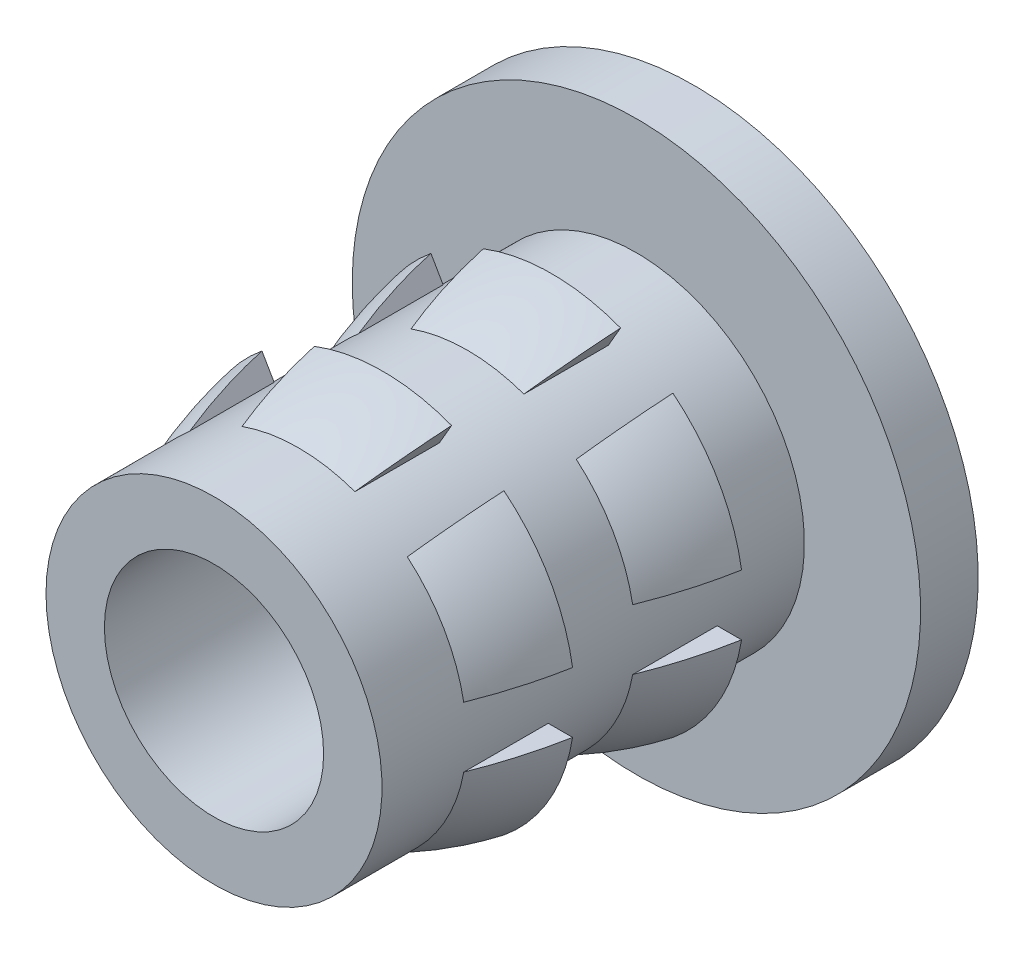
ISO-10303-21;
HEADER;
FILE_DESCRIPTION(('STEP AP214'),'2;1');
FILE_NAME('part.step','',(''),(''),'','','');
FILE_SCHEMA(('AUTOMOTIVE_DESIGN { 1 0 10303 214 1 1 1 1 }'));
ENDSEC;
DATA;
#1=APPLICATION_CONTEXT('core data for automotive mechanical design processes');
#2=APPLICATION_PROTOCOL_DEFINITION('international standard','automotive_design',2000,#1);
#3=PRODUCT_CONTEXT('',#1,'mechanical');
#4=PRODUCT('Part','Part','',(#3));
#5=PRODUCT_RELATED_PRODUCT_CATEGORY('part','',(#4));
#6=PRODUCT_DEFINITION_FORMATION('','',#4);
#7=PRODUCT_DEFINITION_CONTEXT('part definition',#1,'design');
#8=PRODUCT_DEFINITION('design','',#6,#7);
#9=PRODUCT_DEFINITION_SHAPE('','',#8);
#10=(LENGTH_UNIT() NAMED_UNIT(*) SI_UNIT(.MILLI.,.METRE.));
#11=(NAMED_UNIT(*) PLANE_ANGLE_UNIT() SI_UNIT($,.RADIAN.));
#12=(NAMED_UNIT(*) SI_UNIT($,.STERADIAN.) SOLID_ANGLE_UNIT());
#13=UNCERTAINTY_MEASURE_WITH_UNIT(LENGTH_MEASURE(1.E-05),#10,'distance_accuracy_value','');
#14=(GEOMETRIC_REPRESENTATION_CONTEXT(3) GLOBAL_UNCERTAINTY_ASSIGNED_CONTEXT((#13)) GLOBAL_UNIT_ASSIGNED_CONTEXT((#10,
#11,#12)) REPRESENTATION_CONTEXT('',''));
#15=CARTESIAN_POINT('',(0.,0.,0.));
#16=DIRECTION('',(0.,0.,1.));
#17=DIRECTION('',(1.,0.,0.));
#18=AXIS2_PLACEMENT_3D('',#15,#16,#17);
#19=CARTESIAN_POINT('',(11.50314757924,0.,-17.3980107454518));
#20=DIRECTION('',(0.,0.,1.));
#21=DIRECTION('',(1.,0.,0.));
#22=AXIS2_PLACEMENT_3D('',#19,#20,#21);
#23=PLANE('',#22);
#24=CARTESIAN_POINT('',(9.28064757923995,0.,-17.3980107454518));
#25=DIRECTION('',(0.,0.,-1.));
#26=DIRECTION('',(-1.,0.,0.));
#27=AXIS2_PLACEMENT_3D('',#24,#25,#26);
#28=CIRCLE('',#27,2.54);
#29=CARTESIAN_POINT('',(8.37290464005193,2.37225689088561,-17.3980107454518));
#30=VERTEX_POINT('',#29);
#31=CARTESIAN_POINT('',(10.188390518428,2.3722568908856,-17.3980107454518));
#32=VERTEX_POINT('',#31);
#33=EDGE_CURVE('E648',#30,#32,#28,.T.);
#34=ORIENTED_EDGE('',*,*,#33,.T.);
#35=DIRECTION('',(-0.50000000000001,-0.866025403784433,0.));
#36=VECTOR('',#35,1.);
#37=CARTESIAN_POINT('',(9.4898624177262,1.16237072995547,-17.3980107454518));
#38=LINE('',#37,#36);
#39=CARTESIAN_POINT('',(10.0273415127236,2.09331183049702,-17.3980107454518));
#40=VERTEX_POINT('',#39);
#41=EDGE_CURVE('E1245',#32,#40,#38,.T.);
#42=ORIENTED_EDGE('',*,*,#41,.T.);
#43=CARTESIAN_POINT('',(9.28064757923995,0.,-17.3980107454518));
#44=DIRECTION('',(0.,0.,-1.));
#45=DIRECTION('',(-1.,0.,0.));
#46=AXIS2_PLACEMENT_3D('',#43,#44,#45);
#47=CIRCLE('',#46,2.2225);
#48=CARTESIAN_POINT('',(8.53395364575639,2.09331183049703,-17.3980107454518));
#49=VERTEX_POINT('',#48);
#50=EDGE_CURVE('E293',#49,#40,#47,.T.);
#51=ORIENTED_EDGE('',*,*,#50,.F.);
#52=DIRECTION('',(-0.499999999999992,0.866025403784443,0.));
#53=VECTOR('',#52,1.);
#54=CARTESIAN_POINT('',(10.1826827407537,-0.762370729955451,-17.3980107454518));
#55=LINE('',#54,#53);
#56=EDGE_CURVE('E1257',#49,#30,#55,.T.);
#57=ORIENTED_EDGE('',*,*,#56,.T.);
#58=EDGE_LOOP('',(#34,#42,#51,#57));
#59=FACE_BOUND('',#58,.T.);
#60=ADVANCED_FACE('F39',(#59),#23,.F.);
#61=CARTESIAN_POINT('',(9.28064757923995,0.,-18.4216367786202));
#62=DIRECTION('',(0.,0.,-1.));
#63=DIRECTION('',(-1.,0.,0.));
#64=AXIS2_PLACEMENT_3D('',#61,#62,#63);
#65=DEGENERATE_TOROIDAL_SURFACE('',#64,3.18888963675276,5.81962084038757,.F.);
#66=CARTESIAN_POINT('',(9.28064757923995,0.,-16.2804107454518));
#67=DIRECTION('',(0.,0.,-1.));
#68=DIRECTION('',(-1.,0.,0.));
#69=AXIS2_PLACEMENT_3D('',#66,#67,#68);
#70=CIRCLE('',#69,2.2225);
#71=CARTESIAN_POINT('',(8.53395364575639,2.09331183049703,-16.2804107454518));
#72=VERTEX_POINT('',#71);
#73=CARTESIAN_POINT('',(10.0273415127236,2.09331183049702,-16.2804107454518));
#74=VERTEX_POINT('',#73);
#75=EDGE_CURVE('E500',#72,#74,#70,.T.);
#76=ORIENTED_EDGE('',*,*,#75,.T.);
#77=CARTESIAN_POINT('',(10.0273012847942,2.0932421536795,-16.2802107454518));
#78=CARTESIAN_POINT('',(10.0454520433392,2.12468018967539,-16.3704400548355));
#79=CARTESIAN_POINT('',(10.0624449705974,2.15411280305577,-16.461591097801));
#80=CARTESIAN_POINT('',(10.0940438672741,2.20884369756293,-16.6452704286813));
#81=CARTESIAN_POINT('',(10.1086558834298,2.23415245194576,-16.7377945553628));
#82=CARTESIAN_POINT('',(10.1489715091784,2.30398116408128,-17.0176159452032));
#83=CARTESIAN_POINT('',(10.1711195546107,2.34234270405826,-17.2069871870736));
#84=CARTESIAN_POINT('',(10.188408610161,2.37228822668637,-17.3982107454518));
#85=B_SPLINE_CURVE_WITH_KNOTS('',3,(#77,#78,#79,#80,#81,#82,#83,#84),.UNSPECIFIED.,.F.,.F.,(4,2,
2,4),(0.,0.291724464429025,0.58269608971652,1.16520237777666),.UNSPECIFIED.);
#86=EDGE_CURVE('E508',#74,#32,#85,.T.);
#87=ORIENTED_EDGE('',*,*,#86,.T.);
#88=ORIENTED_EDGE('',*,*,#33,.F.);
#89=CARTESIAN_POINT('',(8.37288654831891,2.37228822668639,-17.3982107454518));
#90=CARTESIAN_POINT('',(8.39017560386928,2.34234270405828,-17.2069871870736));
#91=CARTESIAN_POINT('',(8.41232364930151,2.3039811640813,-17.0176159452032));
#92=CARTESIAN_POINT('',(8.45263927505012,2.23415245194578,-16.7377945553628));
#93=CARTESIAN_POINT('',(8.4672512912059,2.20884369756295,-16.6452704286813));
#94=CARTESIAN_POINT('',(8.4988501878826,2.15411280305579,-16.461591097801));
#95=CARTESIAN_POINT('',(8.51584311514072,2.12468018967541,-16.3704400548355));
#96=CARTESIAN_POINT('',(8.53399387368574,2.09324215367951,-16.2802107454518));
#97=B_SPLINE_CURVE_WITH_KNOTS('',3,(#89,#90,#91,#92,#93,#94,#95,#96),.UNSPECIFIED.,.F.,.F.,(4,2,
2,4),(0.,0.58250628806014,0.873477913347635,1.16520237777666),.UNSPECIFIED.);
#98=EDGE_CURVE('E465',#30,#72,#97,.T.);
#99=ORIENTED_EDGE('',*,*,#98,.T.);
#100=EDGE_LOOP('',(#76,#87,#88,#99));
#101=FACE_BOUND('',#100,.T.);
#102=ADVANCED_FACE('F399',(#101),#65,.F.);
#103=CARTESIAN_POINT('',(11.50314757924,0.,-15.1628107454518));
#104=DIRECTION('',(0.,0.,1.));
#105=DIRECTION('',(1.,0.,0.));
#106=AXIS2_PLACEMENT_3D('',#103,#104,#105);
#107=PLANE('',#106);
#108=CARTESIAN_POINT('',(9.28064757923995,0.,-15.1628107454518));
#109=DIRECTION('',(0.,0.,-1.));
#110=DIRECTION('',(-1.,0.,0.));
#111=AXIS2_PLACEMENT_3D('',#108,#109,#110);
#112=CIRCLE('',#111,2.54);
#113=CARTESIAN_POINT('',(8.37290464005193,2.37225689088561,-15.1628107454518));
#114=VERTEX_POINT('',#113);
#115=CARTESIAN_POINT('',(10.188390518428,2.3722568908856,-15.1628107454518));
#116=VERTEX_POINT('',#115);
#117=EDGE_CURVE('E1227',#114,#116,#112,.T.);
#118=ORIENTED_EDGE('',*,*,#117,.T.);
#119=DIRECTION('',(-0.50000000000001,-0.866025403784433,0.));
#120=VECTOR('',#119,1.);
#121=CARTESIAN_POINT('',(9.4898624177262,1.16237072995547,-15.1628107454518));
#122=LINE('',#121,#120);
#123=CARTESIAN_POINT('',(10.0273415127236,2.09331183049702,-15.1628107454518));
#124=VERTEX_POINT('',#123);
#125=EDGE_CURVE('E1234',#116,#124,#122,.T.);
#126=ORIENTED_EDGE('',*,*,#125,.T.);
#127=CARTESIAN_POINT('',(9.28064757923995,0.,-15.1628107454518));
#128=DIRECTION('',(0.,0.,-1.));
#129=DIRECTION('',(-1.,0.,0.));
#130=AXIS2_PLACEMENT_3D('',#127,#128,#129);
#131=CIRCLE('',#130,2.2225);
#132=CARTESIAN_POINT('',(8.53395364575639,2.09331183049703,-15.1628107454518));
#133=VERTEX_POINT('',#132);
#134=EDGE_CURVE('E797',#133,#124,#131,.T.);
#135=ORIENTED_EDGE('',*,*,#134,.F.);
#136=DIRECTION('',(-0.499999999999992,0.866025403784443,0.));
#137=VECTOR('',#136,1.);
#138=CARTESIAN_POINT('',(10.1826827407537,-0.762370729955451,-15.1628107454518));
#139=LINE('',#138,#137);
#140=EDGE_CURVE('E1235',#133,#114,#139,.T.);
#141=ORIENTED_EDGE('',*,*,#140,.T.);
#142=EDGE_LOOP('',(#118,#126,#135,#141));
#143=FACE_BOUND('',#142,.T.);
#144=ADVANCED_FACE('F593',(#143),#107,.F.);
#145=CARTESIAN_POINT('',(9.28064757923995,0.,-16.2291982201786));
#146=DIRECTION('',(0.,0.,-1.));
#147=DIRECTION('',(-1.,0.,0.));
#148=AXIS2_PLACEMENT_3D('',#145,#146,#147);
#149=DEGENERATE_TOROIDAL_SURFACE('',#148,3.3394099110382,5.97533623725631,.F.);
#150=CARTESIAN_POINT('',(9.28064757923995,0.,-14.0452107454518));
#151=DIRECTION('',(0.,0.,-1.));
#152=DIRECTION('',(-1.,0.,0.));
#153=AXIS2_PLACEMENT_3D('',#150,#151,#152);
#154=CIRCLE('',#153,2.2225);
#155=CARTESIAN_POINT('',(8.53395364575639,2.09331183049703,-14.0452107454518));
#156=VERTEX_POINT('',#155);
#157=CARTESIAN_POINT('',(10.0273415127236,2.09331183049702,-14.0452107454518));
#158=VERTEX_POINT('',#157);
#159=EDGE_CURVE('E782',#156,#158,#154,.T.);
#160=ORIENTED_EDGE('',*,*,#159,.T.);
#161=CARTESIAN_POINT('',(10.0273015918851,2.09324268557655,-14.0450107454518));
#162=CARTESIAN_POINT('',(10.0453299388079,2.12446869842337,-14.1353216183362));
#163=CARTESIAN_POINT('',(10.062229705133,2.15373995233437,-14.2265242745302));
#164=CARTESIAN_POINT('',(10.0937048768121,2.2082565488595,-14.4102706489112));
#165=CARTESIAN_POINT('',(10.1082858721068,2.23351157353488,-14.5028105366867));
#166=CARTESIAN_POINT('',(10.148598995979,2.30333595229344,-14.7826157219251));
#167=CARTESIAN_POINT('',(10.1708681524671,2.3419072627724,-14.9719003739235));
#168=CARTESIAN_POINT('',(10.1884088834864,2.37228870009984,-15.1630107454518));
#169=B_SPLINE_CURVE_WITH_KNOTS('',3,(#161,#162,#163,#164,#165,#166,#167,#168),.UNSPECIFIED.,.F.,
.F.,(4,2,2,4),(0.,0.291680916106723,0.582647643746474,1.16511520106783),.UNSPECIFIED.);
#170=EDGE_CURVE('E277',#158,#116,#169,.T.);
#171=ORIENTED_EDGE('',*,*,#170,.T.);
#172=ORIENTED_EDGE('',*,*,#117,.F.);
#173=CARTESIAN_POINT('',(8.37288627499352,2.37228870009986,-15.1630107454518));
#174=CARTESIAN_POINT('',(8.39042700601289,2.34190726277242,-14.9719003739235));
#175=CARTESIAN_POINT('',(8.41269616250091,2.30333595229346,-14.7826157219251));
#176=CARTESIAN_POINT('',(8.45300928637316,2.2335115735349,-14.5028105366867));
#177=CARTESIAN_POINT('',(8.46759028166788,2.20825654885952,-14.4102706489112));
#178=CARTESIAN_POINT('',(8.49906545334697,2.15373995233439,-14.2265242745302));
#179=CARTESIAN_POINT('',(8.515965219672,2.12446869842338,-14.1353216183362));
#180=CARTESIAN_POINT('',(8.53399356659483,2.09324268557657,-14.0450107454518));
#181=B_SPLINE_CURVE_WITH_KNOTS('',3,(#173,#174,#175,#176,#177,#178,#179,#180),.UNSPECIFIED.,.F.,
.F.,(4,2,2,4),(0.,0.582467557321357,0.873434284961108,1.16511520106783),.UNSPECIFIED.);
#182=EDGE_CURVE('E1236',#114,#156,#181,.T.);
#183=ORIENTED_EDGE('',*,*,#182,.T.);
#184=EDGE_LOOP('',(#160,#171,#172,#183));
#185=FACE_BOUND('',#184,.T.);
#186=ADVANCED_FACE('F586',(#185),#149,.F.);
#187=CARTESIAN_POINT('',(6.77234137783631,0.4,-17.3980107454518));
#188=VERTEX_POINT('',#187);
#189=CARTESIAN_POINT('',(7.68008431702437,1.97225689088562,-17.3980107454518));
#190=VERTEX_POINT('',#189);
#191=EDGE_CURVE('E340',#188,#190,#28,.T.);
#192=ORIENTED_EDGE('',*,*,#191,.T.);
#193=DIRECTION('',(0.499999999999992,-0.866025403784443,0.));
#194=VECTOR('',#193,1.);
#195=CARTESIAN_POINT('',(9.48986241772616,-1.16237072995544,-17.3980107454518));
#196=LINE('',#195,#194);
#197=CARTESIAN_POINT('',(7.84113332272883,1.69331183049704,-17.3980107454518));
#198=VERTEX_POINT('',#197);
#199=EDGE_CURVE('E339',#190,#198,#196,.T.);
#200=ORIENTED_EDGE('',*,*,#199,.T.);
#201=CARTESIAN_POINT('',(7.09443938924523,0.4,-17.3980107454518));
#202=VERTEX_POINT('',#201);
#203=EDGE_CURVE('E298',#202,#198,#47,.T.);
#204=ORIENTED_EDGE('',*,*,#203,.F.);
#205=DIRECTION('',(-1.,0.,0.));
#206=VECTOR('',#205,1.);
#207=CARTESIAN_POINT('',(11.50314757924,0.4,-17.3980107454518));
#208=LINE('',#207,#206);
#209=EDGE_CURVE('E337',#202,#188,#208,.T.);
#210=ORIENTED_EDGE('',*,*,#209,.T.);
#211=EDGE_LOOP('',(#192,#200,#204,#210));
#212=FACE_BOUND('',#211,.T.);
#213=ADVANCED_FACE('F336',(#212),#23,.F.);
#214=CARTESIAN_POINT('',(7.09443938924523,0.4,-16.2804107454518));
#215=VERTEX_POINT('',#214);
#216=CARTESIAN_POINT('',(7.84113332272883,1.69331183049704,-16.2804107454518));
#217=VERTEX_POINT('',#216);
#218=EDGE_CURVE('E510',#215,#217,#70,.T.);
#219=ORIENTED_EDGE('',*,*,#218,.T.);
#220=CARTESIAN_POINT('',(7.84117355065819,1.69324215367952,-16.2802107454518));
#221=CARTESIAN_POINT('',(7.82302279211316,1.72468018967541,-16.3704400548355));
#222=CARTESIAN_POINT('',(7.80602986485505,1.7541128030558,-16.461591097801));
#223=CARTESIAN_POINT('',(7.77443096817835,1.80884369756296,-16.6452704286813));
#224=CARTESIAN_POINT('',(7.75981895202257,1.83415245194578,-16.7377945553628));
#225=CARTESIAN_POINT('',(7.71950332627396,1.90398116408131,-17.0176159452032));
#226=CARTESIAN_POINT('',(7.69735528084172,1.94234270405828,-17.2069871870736));
#227=CARTESIAN_POINT('',(7.68006622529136,1.9722882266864,-17.3982107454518));
#228=B_SPLINE_CURVE_WITH_KNOTS('',3,(#220,#221,#222,#223,#224,#225,#226,#227),.UNSPECIFIED.,.F.,
.F.,(4,2,2,4),(0.,0.291724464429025,0.58269608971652,1.16520237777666),.UNSPECIFIED.);
#229=EDGE_CURVE('E344',#217,#190,#228,.T.);
#230=ORIENTED_EDGE('',*,*,#229,.T.);
#231=ORIENTED_EDGE('',*,*,#191,.F.);
#232=CARTESIAN_POINT('',(6.90494918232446,0.4,-16.8310141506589));
#233=CARTESIAN_POINT('',(6.9493884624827,0.4,-16.6767885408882));
#234=CARTESIAN_POINT('',(7.00032246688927,0.4,-16.5243957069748));
#235=CARTESIAN_POINT('',(7.11488260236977,0.4,-16.2243630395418));
#236=CARTESIAN_POINT('',(7.17851699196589,0.4,-16.0767263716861));
#237=CARTESIAN_POINT('',(7.3179493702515,0.4,-15.7876664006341));
#238=CARTESIAN_POINT('',(7.3937228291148,0.4,-15.6462312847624));
#239=CARTESIAN_POINT('',(7.55706092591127,0.4,-15.3704639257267));
#240=CARTESIAN_POINT('',(7.64461784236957,0.4,-15.2361271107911));
#241=CARTESIAN_POINT('',(7.82343512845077,0.4,-14.9864473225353));
#242=CARTESIAN_POINT('',(7.91378354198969,0.4,-14.8704535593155));
#243=CARTESIAN_POINT('',(8.05668227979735,0.4,-14.7021788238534));
#244=CARTESIAN_POINT('',(8.10570811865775,0.4,-14.646877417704));
#245=CARTESIAN_POINT('',(8.20615851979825,0.4,-14.5385464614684));
#246=CARTESIAN_POINT('',(8.25758167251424,0.4,-14.4855156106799));
#247=CARTESIAN_POINT('',(8.36344180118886,0.4,-14.3814936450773));
#248=CARTESIAN_POINT('',(8.4179032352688,0.4,-14.3305274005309));
#249=CARTESIAN_POINT('',(8.52971985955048,0.4,-14.2315633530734));
#250=CARTESIAN_POINT('',(8.58708150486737,0.4,-14.183572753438));
#251=CARTESIAN_POINT('',(8.67534498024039,0.4,-14.1149289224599));
#252=CARTESIAN_POINT('',(8.70501330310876,0.4,-14.0926870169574));
#253=CARTESIAN_POINT('',(8.76527837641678,0.4,-14.049504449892));
#254=CARTESIAN_POINT('',(8.79587487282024,0.4,-14.0285634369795));
#255=CARTESIAN_POINT('',(8.85806256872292,0.4,-13.9884661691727));
#256=CARTESIAN_POINT('',(8.88964965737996,0.4,-13.9693035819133));
#257=CARTESIAN_POINT('',(8.95415653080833,0.4,-13.9333986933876));
#258=CARTESIAN_POINT('',(8.98707448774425,0.4,-13.9166532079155));
#259=CARTESIAN_POINT('',(9.03693679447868,0.4,-13.8946311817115));
#260=CARTESIAN_POINT('',(9.05324785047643,0.4,-13.8879313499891));
#261=CARTESIAN_POINT('',(9.08625953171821,0.4,-13.8755795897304));
#262=CARTESIAN_POINT('',(9.10296020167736,0.4,-13.8699277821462));
#263=CARTESIAN_POINT('',(9.15345100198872,0.4,-13.8549831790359));
#264=CARTESIAN_POINT('',(9.18786916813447,0.4,-13.8475883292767));
#265=CARTESIAN_POINT('',(9.24033457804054,0.4,-13.8416715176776));
#266=CARTESIAN_POINT('',(9.25810646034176,0.4,-13.8405742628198));
#267=CARTESIAN_POINT('',(9.29366670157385,0.4,-13.8402423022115));
#268=CARTESIAN_POINT('',(9.31145505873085,0.4,-13.8410074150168));
#269=CARTESIAN_POINT('',(9.36468973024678,0.4,-13.8460478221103));
#270=CARTESIAN_POINT('',(9.39989010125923,0.4,-13.8530808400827));
#271=CARTESIAN_POINT('',(9.45876973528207,0.4,-13.8698028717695));
#272=CARTESIAN_POINT('',(9.48286770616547,0.4,-13.8781592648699));
#273=CARTESIAN_POINT('',(9.53026754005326,0.4,-13.8969200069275));
#274=CARTESIAN_POINT('',(9.55356884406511,0.4,-13.9073257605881));
#275=CARTESIAN_POINT('',(9.59951708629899,0.4,-13.9296913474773));
#276=CARTESIAN_POINT('',(9.62216094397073,0.4,-13.9416573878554));
#277=CARTESIAN_POINT('',(9.66679257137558,0.4,-13.9667310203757));
#278=CARTESIAN_POINT('',(9.6887805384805,0.4,-13.9798382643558));
#279=CARTESIAN_POINT('',(9.74887102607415,0.4,-14.0173432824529));
#280=CARTESIAN_POINT('',(9.78638409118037,0.4,-14.0426830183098));
#281=CARTESIAN_POINT('',(9.86003425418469,0.4,-14.0953015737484));
#282=CARTESIAN_POINT('',(9.89617057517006,0.4,-14.1225814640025));
#283=CARTESIAN_POINT('',(9.96731415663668,0.4,-14.1786856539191));
#284=CARTESIAN_POINT('',(10.0023195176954,0.4,-14.2075123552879));
#285=CARTESIAN_POINT('',(10.0712657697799,0.4,-14.2664148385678));
#286=CARTESIAN_POINT('',(10.10520650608,0.4,-14.2964908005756));
#287=CARTESIAN_POINT('',(10.2056770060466,0.4,-14.3884570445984));
#288=CARTESIAN_POINT('',(10.2707217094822,0.4,-14.4519785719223));
#289=CARTESIAN_POINT('',(10.397042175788,0.4,-14.5825182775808));
#290=CARTESIAN_POINT('',(10.458321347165,0.4,-14.6495331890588));
#291=CARTESIAN_POINT('',(10.6184307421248,0.4,-14.8341844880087));
#292=CARTESIAN_POINT('',(10.7139007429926,0.4,-14.9547588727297));
#293=CARTESIAN_POINT('',(10.8943909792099,0.4,-15.2035866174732));
#294=CARTESIAN_POINT('',(10.9794032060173,0.4,-15.3318457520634));
#295=CARTESIAN_POINT('',(11.1384325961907,0.4,-15.5946961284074));
#296=CARTESIAN_POINT('',(11.2124691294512,0.4,-15.7292756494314));
#297=CARTESIAN_POINT('',(11.3493507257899,0.4,-16.0039642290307));
#298=CARTESIAN_POINT('',(11.4121984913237,0.4,-16.144071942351));
#299=CARTESIAN_POINT('',(11.5270690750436,0.4,-16.4305874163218));
#300=CARTESIAN_POINT('',(11.5789547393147,0.4,-16.5770501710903));
#301=CARTESIAN_POINT('',(11.6706691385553,0.4,-16.8737578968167));
#302=CARTESIAN_POINT('',(11.7104936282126,0.4,-17.024004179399));
#303=CARTESIAN_POINT('',(11.7778310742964,0.4,-17.3272445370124));
#304=CARTESIAN_POINT('',(11.805342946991,0.4,-17.4802388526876));
#305=CARTESIAN_POINT('',(11.8478943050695,0.4,-17.7880077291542));
#306=CARTESIAN_POINT('',(11.8629292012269,0.4,-17.9427829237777));
#307=CARTESIAN_POINT('',(11.8807403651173,0.4,-18.2587459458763));
#308=CARTESIAN_POINT('',(11.8830460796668,0.4,-18.4199604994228));
#309=CARTESIAN_POINT('',(11.8741190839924,0.4,-18.7420752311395));
#310=CARTESIAN_POINT('',(11.8628811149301,0.4,-18.9029752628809));
#311=CARTESIAN_POINT('',(11.8269165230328,0.4,-19.2233844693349));
#312=CARTESIAN_POINT('',(11.8021798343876,0.4,-19.382892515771));
#313=CARTESIAN_POINT('',(11.7393624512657,0.4,-19.6993114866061));
#314=CARTESIAN_POINT('',(11.7012771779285,0.4,-19.8562215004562));
#315=CARTESIAN_POINT('',(11.6118331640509,0.4,-20.1668449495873));
#316=CARTESIAN_POINT('',(11.5604270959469,0.4,-20.3205448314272));
#317=CARTESIAN_POINT('',(11.4447449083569,0.4,-20.6230350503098));
#318=CARTESIAN_POINT('',(11.3804625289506,0.4,-20.7718229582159));
#319=CARTESIAN_POINT('',(11.1693930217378,0.4,-21.2079432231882));
#320=CARTESIAN_POINT('',(11.0039135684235,0.4,-21.4866625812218));
#321=CARTESIAN_POINT('',(10.7320074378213,0.4,-21.8643697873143));
#322=CARTESIAN_POINT('',(10.6439755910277,0.4,-21.977050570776));
#323=CARTESIAN_POINT('',(10.5049783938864,0.4,-22.1406303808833));
#324=CARTESIAN_POINT('',(10.4573665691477,0.4,-22.1943709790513));
#325=CARTESIAN_POINT('',(10.3598745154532,0.4,-22.2997168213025));
#326=CARTESIAN_POINT('',(10.3099952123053,0.4,-22.3513229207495));
#327=CARTESIAN_POINT('',(10.2074924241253,0.4,-22.4525347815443));
#328=CARTESIAN_POINT('',(10.1548509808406,0.4,-22.5021223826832));
#329=CARTESIAN_POINT('',(10.0469005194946,0.4,-22.5985259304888));
#330=CARTESIAN_POINT('',(9.99158712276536,0.4,-22.6453370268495));
#331=CARTESIAN_POINT('',(9.90651561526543,0.4,-22.7125836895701));
#332=CARTESIAN_POINT('',(9.87788647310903,0.4,-22.7344504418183));
#333=CARTESIAN_POINT('',(9.81978343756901,0.4,-22.7770269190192));
#334=CARTESIAN_POINT('',(9.79030972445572,0.4,-22.7977368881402));
#335=CARTESIAN_POINT('',(9.73044918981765,0.4,-22.8376186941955));
#336=CARTESIAN_POINT('',(9.70006506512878,0.4,-22.8567945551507));
#337=CARTESIAN_POINT('',(9.63811313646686,0.4,-22.8931080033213));
#338=CARTESIAN_POINT('',(9.60654646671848,0.4,-22.9102474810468));
#339=CARTESIAN_POINT('',(9.5572690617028,0.4,-22.934096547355));
#340=CARTESIAN_POINT('',(9.54009008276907,0.4,-22.9418964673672));
#341=CARTESIAN_POINT('',(9.50529468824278,0.4,-22.9564466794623));
#342=CARTESIAN_POINT('',(9.487678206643,0.4,-22.9631968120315));
#343=CARTESIAN_POINT('',(9.43432280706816,0.4,-22.9814050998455));
#344=CARTESIAN_POINT('',(9.39785850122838,0.4,-22.990934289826));
#345=CARTESIAN_POINT('',(9.33044035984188,0.4,-23.0013274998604));
#346=CARTESIAN_POINT('',(9.2996907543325,0.4,-23.0034524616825));
#347=CARTESIAN_POINT('',(9.23830426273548,0.4,-23.0020567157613));
#348=CARTESIAN_POINT('',(9.20766749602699,0.4,-22.9985311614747));
#349=CARTESIAN_POINT('',(9.13552215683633,0.4,-22.9843622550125));
#350=CARTESIAN_POINT('',(9.09447759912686,0.4,-22.9714645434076));
#351=CARTESIAN_POINT('',(9.03465730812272,0.4,-22.9477913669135));
#352=CARTESIAN_POINT('',(9.01494450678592,0.4,-22.9391424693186));
#353=CARTESIAN_POINT('',(8.97605253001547,0.4,-22.9207120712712));
#354=CARTESIAN_POINT('',(8.95687323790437,0.4,-22.9109308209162));
#355=CARTESIAN_POINT('',(8.90716760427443,0.4,-22.8841074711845));
#356=CARTESIAN_POINT('',(8.87703381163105,0.4,-22.8663452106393));
#357=CARTESIAN_POINT('',(8.81778937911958,0.4,-22.829178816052));
#358=CARTESIAN_POINT('',(8.78867932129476,0.4,-22.8097737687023));
#359=CARTESIAN_POINT('',(8.70253675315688,0.4,-22.7496548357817));
#360=CARTESIAN_POINT('',(8.64679371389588,0.4,-22.7070960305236));
#361=CARTESIAN_POINT('',(8.53784201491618,0.4,-22.6185666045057));
#362=CARTESIAN_POINT('',(8.48464196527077,0.4,-22.5725855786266));
#363=CARTESIAN_POINT('',(8.38069550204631,0.4,-22.4780463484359));
#364=CARTESIAN_POINT('',(8.32994659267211,0.4,-22.4294908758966));
#365=CARTESIAN_POINT('',(8.17724880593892,0.4,-22.2766885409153));
#366=CARTESIAN_POINT('',(8.07897467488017,0.4,-22.16874255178));
#367=CARTESIAN_POINT('',(7.89167588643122,0.4,-21.9449922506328));
#368=CARTESIAN_POINT('',(7.80266049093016,0.4,-21.8291802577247));
#369=CARTESIAN_POINT('',(7.63436472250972,0.4,-21.5911195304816));
#370=CARTESIAN_POINT('',(7.55506012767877,0.4,-21.4688879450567));
#371=CARTESIAN_POINT('',(7.40624942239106,0.4,-21.2186978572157));
#372=CARTESIAN_POINT('',(7.33674005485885,0.4,-21.0907412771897));
#373=CARTESIAN_POINT('',(7.13915474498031,0.4,-20.6909776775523));
#374=CARTESIAN_POINT('',(7.02739878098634,0.4,-20.410891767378));
#375=CARTESIAN_POINT('',(6.84909526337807,0.4,-19.8362387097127));
#376=CARTESIAN_POINT('',(6.7826185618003,0.4,-19.5416496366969));
#377=CARTESIAN_POINT('',(6.71656195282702,0.4,-19.0845615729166));
#378=CARTESIAN_POINT('',(6.70024972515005,0.4,-18.9243168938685));
#379=CARTESIAN_POINT('',(6.68111627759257,0.4,-18.6030381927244));
#380=CARTESIAN_POINT('',(6.67829090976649,0.4,-18.4420044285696));
#381=CARTESIAN_POINT('',(6.68614041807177,0.4,-18.1206419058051));
#382=CARTESIAN_POINT('',(6.69678504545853,0.4,-17.9603123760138));
#383=CARTESIAN_POINT('',(6.73144750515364,0.4,-17.6411707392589));
#384=CARTESIAN_POINT('',(6.75545810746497,0.4,-17.4823578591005));
#385=CARTESIAN_POINT('',(6.80221728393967,0.4,-17.2417591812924));
#386=CARTESIAN_POINT('',(6.82020540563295,0.4,-17.159021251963));
#387=CARTESIAN_POINT('',(6.85984015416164,0.4,-16.9943562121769));
#388=CARTESIAN_POINT('',(6.88148969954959,0.4,-16.9124298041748));
#389=CARTESIAN_POINT('',(6.90494918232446,0.4,-16.8310141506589));
#390=B_SPLINE_CURVE_WITH_KNOTS('',3,(#232,#233,#234,#235,#236,#237,#238,#239,#240,#241,#242,
#243,#244,#245,#246,#247,#248,#249,#250,#251,#252,#253,#254,#255,#256,#257,#258,#259,#260,#261,
#262,#263,#264,#265,#266,#267,#268,#269,#270,#271,#272,#273,#274,#275,#276,#277,#278,#279,#280,
#281,#282,#283,#284,#285,#286,#287,#288,#289,#290,#291,#292,#293,#294,#295,#296,#297,#298,#299,
#300,#301,#302,#303,#304,#305,#306,#307,#308,#309,#310,#311,#312,#313,#314,#315,#316,#317,#318,
#319,#320,#321,#322,#323,#324,#325,#326,#327,#328,#329,#330,#331,#332,#333,#334,#335,#336,#337,
#338,#339,#340,#341,#342,#343,#344,#345,#346,#347,#348,#349,#350,#351,#352,#353,#354,#355,#356,
#357,#358,#359,#360,#361,#362,#363,#364,#365,#366,#367,#368,#369,#370,#371,#372,#373,#374,#375,
#376,#377,#378,#379,#380,#381,#382,#383,#384,#385,#386,#387,#388,#389),.UNSPECIFIED.,.T.,.F.,(4,
2,2,2,2,2,2,2,2,2,2,2,2,2,2,2,2,2,2,2,2,2,2,2,2,2,2,2,2,2,2,2,2,2,2,2,2,2,2,2,2,2,2,2,2,2,2,2,2,
2,2,2,2,2,2,2,2,2,2,2,2,2,2,2,2,2,2,2,2,2,2,2,2,2,2,2,2,2,4),(0.,0.481422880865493,
0.963159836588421,1.4439353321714,1.92439730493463,2.36494433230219,2.5865965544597,
2.80812005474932,3.03179919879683,3.25600022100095,3.36721480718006,3.47839922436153,
3.58917120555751,3.69979590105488,3.7526630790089,3.80553635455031,3.91049540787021,
3.96382386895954,4.01714713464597,4.12413533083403,4.20056122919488,4.27703969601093,
4.35383226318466,4.43060148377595,4.56631381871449,4.70210163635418,4.83810675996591,
4.97413155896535,5.24669326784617,5.51900450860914,5.97976182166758,6.44086981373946,
6.9011540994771,7.36132706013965,7.82695505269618,8.29274674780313,8.75857943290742,
9.22458338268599,9.70770401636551,10.1910123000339,10.6746814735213,11.1585167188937,
11.6440951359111,12.1299101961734,13.0965108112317,13.5251209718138,13.7404494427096,
13.9556907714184,14.1725661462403,14.3898098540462,14.4978631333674,14.6058935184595,
14.7136305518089,14.8212667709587,14.8778352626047,14.9344123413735,15.0468310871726,
15.1387998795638,15.2308475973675,15.359103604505,15.4236706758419,15.4882235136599,
15.5930837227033,15.6980026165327,15.9081920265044,16.1190488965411,16.3296863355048,
16.7670061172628,17.2047592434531,17.641397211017,18.077889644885,18.978534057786,
19.8805845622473,20.36331719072,20.8459013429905,21.3274037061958,21.808645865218,
22.0625854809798,22.3167284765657),.UNSPECIFIED.);
#391=EDGE_CURVE('E387',#188,#215,#390,.T.);
#392=ORIENTED_EDGE('',*,*,#391,.T.);
#393=EDGE_LOOP('',(#219,#230,#231,#392));
#394=FACE_BOUND('',#393,.T.);
#395=ADVANCED_FACE('F594',(#394),#65,.F.);
#396=CARTESIAN_POINT('',(6.77234137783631,0.4,-15.1628107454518));
#397=VERTEX_POINT('',#396);
#398=CARTESIAN_POINT('',(7.68008431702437,1.97225689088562,-15.1628107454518));
#399=VERTEX_POINT('',#398);
#400=EDGE_CURVE('E1226',#397,#399,#112,.T.);
#401=ORIENTED_EDGE('',*,*,#400,.T.);
#402=DIRECTION('',(0.499999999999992,-0.866025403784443,0.));
#403=VECTOR('',#402,1.);
#404=CARTESIAN_POINT('',(9.48986241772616,-1.16237072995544,-15.1628107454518));
#405=LINE('',#404,#403);
#406=CARTESIAN_POINT('',(7.84113332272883,1.69331183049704,-15.1628107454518));
#407=VERTEX_POINT('',#406);
#408=EDGE_CURVE('E349',#399,#407,#405,.T.);
#409=ORIENTED_EDGE('',*,*,#408,.T.);
#410=CARTESIAN_POINT('',(7.09443938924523,0.4,-15.1628107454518));
#411=VERTEX_POINT('',#410);
#412=EDGE_CURVE('E799',#411,#407,#131,.T.);
#413=ORIENTED_EDGE('',*,*,#412,.F.);
#414=DIRECTION('',(-1.,0.,0.));
#415=VECTOR('',#414,1.);
#416=CARTESIAN_POINT('',(11.50314757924,0.4,-15.1628107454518));
#417=LINE('',#416,#415);
#418=EDGE_CURVE('E367',#411,#397,#417,.T.);
#419=ORIENTED_EDGE('',*,*,#418,.T.);
#420=EDGE_LOOP('',(#401,#409,#413,#419));
#421=FACE_BOUND('',#420,.T.);
#422=ADVANCED_FACE('F637',(#421),#107,.F.);
#423=CARTESIAN_POINT('',(7.09443938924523,0.4,-14.0452107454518));
#424=VERTEX_POINT('',#423);
#425=CARTESIAN_POINT('',(7.84113332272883,1.69331183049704,-14.0452107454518));
#426=VERTEX_POINT('',#425);
#427=EDGE_CURVE('E779',#424,#426,#154,.T.);
#428=ORIENTED_EDGE('',*,*,#427,.T.);
#429=CARTESIAN_POINT('',(7.84117324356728,1.69324268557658,-14.0450107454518));
#430=CARTESIAN_POINT('',(7.82314489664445,1.72446869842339,-14.1353216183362));
#431=CARTESIAN_POINT('',(7.80624513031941,1.7537399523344,-14.2265242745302));
#432=CARTESIAN_POINT('',(7.77476995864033,1.80825654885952,-14.4102706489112));
#433=CARTESIAN_POINT('',(7.76018896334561,1.8335115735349,-14.5028105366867));
#434=CARTESIAN_POINT('',(7.71987583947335,1.90333595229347,-14.7826157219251));
#435=CARTESIAN_POINT('',(7.69760668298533,1.94190726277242,-14.9719003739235));
#436=CARTESIAN_POINT('',(7.68006595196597,1.97228870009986,-15.1630107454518));
#437=B_SPLINE_CURVE_WITH_KNOTS('',3,(#429,#430,#431,#432,#433,#434,#435,#436),.UNSPECIFIED.,.F.,
.F.,(4,2,2,4),(0.,0.291680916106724,0.582647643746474,1.16511520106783),.UNSPECIFIED.);
#438=EDGE_CURVE('E1258',#426,#399,#437,.T.);
#439=ORIENTED_EDGE('',*,*,#438,.T.);
#440=ORIENTED_EDGE('',*,*,#400,.F.);
#441=CARTESIAN_POINT('',(6.90569002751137,0.4,-14.5960276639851));
#442=CARTESIAN_POINT('',(6.99469512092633,0.4,-14.2871767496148));
#443=CARTESIAN_POINT('',(7.10912655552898,0.4,-13.9853926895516));
#444=CARTESIAN_POINT('',(7.38575842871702,0.4,-13.4057140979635));
#445=CARTESIAN_POINT('',(7.54779523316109,0.4,-13.127741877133));
#446=CARTESIAN_POINT('',(7.81334739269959,0.4,-12.750198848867));
#447=CARTESIAN_POINT('',(7.8989474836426,0.4,-12.6377576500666));
#448=CARTESIAN_POINT('',(8.0339238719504,0.4,-12.474281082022));
#449=CARTESIAN_POINT('',(8.08007899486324,0.4,-12.4205839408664));
#450=CARTESIAN_POINT('',(8.17456402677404,0.4,-12.3151589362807));
#451=CARTESIAN_POINT('',(8.22289339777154,0.4,-12.2634305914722));
#452=CARTESIAN_POINT('',(8.32205676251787,0.4,-12.1618950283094));
#453=CARTESIAN_POINT('',(8.37290253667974,0.4,-12.1120992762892));
#454=CARTESIAN_POINT('',(8.47707252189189,0.4,-12.0150490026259));
#455=CARTESIAN_POINT('',(8.53039938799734,0.4,-11.9677973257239));
#456=CARTESIAN_POINT('',(8.63969727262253,0.4,-11.8766595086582));
#457=CARTESIAN_POINT('',(8.69566192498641,0.4,-11.8327658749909));
#458=CARTESIAN_POINT('',(8.78219595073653,0.4,-11.7706268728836));
#459=CARTESIAN_POINT('',(8.81144582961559,0.4,-11.7505462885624));
#460=CARTESIAN_POINT('',(8.8709992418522,0.4,-11.712024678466));
#461=CARTESIAN_POINT('',(8.90130217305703,0.4,-11.6935827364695));
#462=CARTESIAN_POINT('',(8.95072556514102,0.4,-11.6659966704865));
#463=CARTESIAN_POINT('',(8.96942415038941,0.4,-11.6561035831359));
#464=CARTESIAN_POINT('',(9.00734407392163,0.4,-11.6373812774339));
#465=CARTESIAN_POINT('',(9.02656553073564,0.4,-11.6285523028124));
#466=CARTESIAN_POINT('',(9.08492898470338,0.4,-11.6041893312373));
#467=CARTESIAN_POINT('',(9.12499146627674,0.4,-11.59064799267));
#468=CARTESIAN_POINT('',(9.19552464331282,0.4,-11.5749792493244));
#469=CARTESIAN_POINT('',(9.2254964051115,0.4,-11.5707048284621));
#470=CARTESIAN_POINT('',(9.28569409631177,0.4,-11.5676927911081));
#471=CARTESIAN_POINT('',(9.31591955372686,0.4,-11.5689465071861));
#472=CARTESIAN_POINT('',(9.38269969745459,0.4,-11.5775680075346));
#473=CARTESIAN_POINT('',(9.41906637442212,0.4,-11.5863076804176));
#474=CARTESIAN_POINT('',(9.49010629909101,0.4,-11.6093570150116));
#475=CARTESIAN_POINT('',(9.52476693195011,0.4,-11.623702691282));
#476=CARTESIAN_POINT('',(9.58332761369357,0.4,-11.6515728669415));
#477=CARTESIAN_POINT('',(9.60762650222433,0.4,-11.664291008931));
#478=CARTESIAN_POINT('',(9.65545025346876,0.4,-11.6911172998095));
#479=CARTESIAN_POINT('',(9.67897485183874,0.4,-11.7052259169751));
#480=CARTESIAN_POINT('',(9.74865096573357,0.4,-11.7491562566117));
#481=CARTESIAN_POINT('',(9.79381489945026,0.4,-11.7805364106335));
#482=CARTESIAN_POINT('',(9.88231821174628,0.4,-11.8460958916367));
#483=CARTESIAN_POINT('',(9.92564897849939,0.4,-11.8802865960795));
#484=CARTESIAN_POINT('',(10.0105801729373,0.4,-11.9506533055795));
#485=CARTESIAN_POINT('',(10.0521824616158,0.4,-11.9868270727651));
#486=CARTESIAN_POINT('',(10.1397957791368,0.4,-12.0661693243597));
#487=CARTESIAN_POINT('',(10.1855749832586,0.4,-12.1095931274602));
#488=CARTESIAN_POINT('',(10.2753166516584,0.4,-12.1982843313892));
#489=CARTESIAN_POINT('',(10.3192788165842,0.4,-12.2435520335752));
#490=CARTESIAN_POINT('',(10.4486161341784,0.4,-12.3818863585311));
#491=CARTESIAN_POINT('',(10.5313716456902,0.4,-12.4774194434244));
#492=CARTESIAN_POINT('',(10.6897584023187,0.4,-12.6737302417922));
#493=CARTESIAN_POINT('',(10.7654098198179,0.4,-12.7744917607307));
#494=CARTESIAN_POINT('',(10.9097340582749,0.4,-12.9808137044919));
#495=CARTESIAN_POINT('',(10.9784092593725,0.4,-13.0863724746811));
#496=CARTESIAN_POINT('',(11.1938287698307,0.4,-13.4426522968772));
#497=CARTESIAN_POINT('',(11.3253226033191,0.4,-13.7028152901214));
#498=CARTESIAN_POINT('',(11.5483415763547,0.4,-14.2401056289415));
#499=CARTESIAN_POINT('',(11.6398096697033,0.4,-14.5172565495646));
#500=CARTESIAN_POINT('',(11.7500365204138,0.4,-14.9585581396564));
#501=CARTESIAN_POINT('',(11.7831071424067,0.4,-15.119260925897));
#502=CARTESIAN_POINT('',(11.8357621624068,0.4,-15.4429041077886));
#503=CARTESIAN_POINT('',(11.8553454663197,0.4,-15.6058446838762));
#504=CARTESIAN_POINT('',(11.8808771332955,0.4,-15.932696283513));
#505=CARTESIAN_POINT('',(11.8868326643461,0.4,-16.0966067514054));
#506=CARTESIAN_POINT('',(11.88509619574,0.4,-16.424355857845));
#507=CARTESIAN_POINT('',(11.8774042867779,0.4,-16.5881944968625));
#508=CARTESIAN_POINT('',(11.8482488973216,0.4,-16.9165956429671));
#509=CARTESIAN_POINT('',(11.8266237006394,0.4,-17.0811438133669));
#510=CARTESIAN_POINT('',(11.7695992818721,0.4,-17.4077751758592));
#511=CARTESIAN_POINT('',(11.7342049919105,0.4,-17.5698592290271));
#512=CARTESIAN_POINT('',(11.6497742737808,0.4,-17.8908153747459));
#513=CARTESIAN_POINT('',(11.6007081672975,0.4,-18.0496796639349));
#514=CARTESIAN_POINT('',(11.48929501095,0.4,-18.3626120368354));
#515=CARTESIAN_POINT('',(11.4269531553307,0.4,-18.5166819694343));
#516=CARTESIAN_POINT('',(11.2894030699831,0.4,-18.8188269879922));
#517=CARTESIAN_POINT('',(11.2142049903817,0.4,-18.9669066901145));
#518=CARTESIAN_POINT('',(11.0512937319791,0.4,-19.2560890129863));
#519=CARTESIAN_POINT('',(10.9635755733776,0.4,-19.3971888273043));
#520=CARTESIAN_POINT('',(10.7764137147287,0.4,-19.6705887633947));
#521=CARTESIAN_POINT('',(10.6770196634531,0.4,-19.8029226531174));
#522=CARTESIAN_POINT('',(10.519162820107,0.4,-19.9940299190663));
#523=CARTESIAN_POINT('',(10.4651029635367,0.4,-20.0564799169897));
#524=CARTESIAN_POINT('',(10.3540077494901,0.4,-20.178670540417));
#525=CARTESIAN_POINT('',(10.2969729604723,0.4,-20.2384116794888));
#526=CARTESIAN_POINT('',(10.1862958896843,0.4,-20.3483199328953));
#527=CARTESIAN_POINT('',(10.1329783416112,0.4,-20.3988142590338));
#528=CARTESIAN_POINT('',(10.0236078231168,0.4,-20.4969014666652));
#529=CARTESIAN_POINT('',(9.96755215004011,0.4,-20.5444913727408));
#530=CARTESIAN_POINT('',(9.88153585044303,0.4,-20.6124803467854));
#531=CARTESIAN_POINT('',(9.85278442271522,0.4,-20.63441144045));
#532=CARTESIAN_POINT('',(9.79438850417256,0.4,-20.6770450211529));
#533=CARTESIAN_POINT('',(9.7647442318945,0.4,-20.6977478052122));
#534=CARTESIAN_POINT('',(9.70438758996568,0.4,-20.7375442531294));
#535=CARTESIAN_POINT('',(9.6736752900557,0.4,-20.7566380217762));
#536=CARTESIAN_POINT('',(9.61095372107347,0.4,-20.7925342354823));
#537=CARTESIAN_POINT('',(9.57894580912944,0.4,-20.8093390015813));
#538=CARTESIAN_POINT('',(9.51484149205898,0.4,-20.8388084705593));
#539=CARTESIAN_POINT('',(9.48281921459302,0.4,-20.8516300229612));
#540=CARTESIAN_POINT('',(9.41730212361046,0.4,-20.8724071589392));
#541=CARTESIAN_POINT('',(9.38381605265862,0.4,-20.8803882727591));
#542=CARTESIAN_POINT('',(9.33261634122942,0.4,-20.8874194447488));
#543=CARTESIAN_POINT('',(9.31523522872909,0.4,-20.8889308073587));
#544=CARTESIAN_POINT('',(9.28041250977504,0.4,-20.8901307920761));
#545=CARTESIAN_POINT('',(9.26297091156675,0.4,-20.8898196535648));
#546=CARTESIAN_POINT('',(9.21077301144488,0.4,-20.8861444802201));
#547=CARTESIAN_POINT('',(9.17618962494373,0.4,-20.8800323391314));
#548=CARTESIAN_POINT('',(9.11963822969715,0.4,-20.8650886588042));
#549=CARTESIAN_POINT('',(9.09722059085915,0.4,-20.8577848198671));
#550=CARTESIAN_POINT('',(9.0530968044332,0.4,-20.8412450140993));
#551=CARTESIAN_POINT('',(9.03139109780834,0.4,-20.8320078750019));
#552=CARTESIAN_POINT('',(8.98856198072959,0.4,-20.8120367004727));
#553=CARTESIAN_POINT('',(8.96744200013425,0.4,-20.8012954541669));
#554=CARTESIAN_POINT('',(8.92581428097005,0.4,-20.7787083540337));
#555=CARTESIAN_POINT('',(8.9053063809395,0.4,-20.7668627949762));
#556=CARTESIAN_POINT('',(8.84954800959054,0.4,-20.7330617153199));
#557=CARTESIAN_POINT('',(8.81483847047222,0.4,-20.7102166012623));
#558=CARTESIAN_POINT('',(8.74668475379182,0.4,-20.6626987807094));
#559=CARTESIAN_POINT('',(8.71324133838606,0.4,-20.6380249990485));
#560=CARTESIAN_POINT('',(8.64737357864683,0.4,-20.5872455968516));
#561=CARTESIAN_POINT('',(8.61495104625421,0.4,-20.561137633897));
#562=CARTESIAN_POINT('',(8.55105326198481,0.4,-20.5077842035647));
#563=CARTESIAN_POINT('',(8.51957815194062,0.4,-20.4805385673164));
#564=CARTESIAN_POINT('',(8.4263175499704,0.4,-20.3972350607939));
#565=CARTESIAN_POINT('',(8.36583107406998,0.4,-20.3397162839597));
#566=CARTESIAN_POINT('',(8.2480743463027,0.4,-20.221620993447));
#567=CARTESIAN_POINT('',(8.19080096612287,0.4,-20.1610475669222));
#568=CARTESIAN_POINT('',(8.0318706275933,0.4,-19.9845341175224));
#569=CARTESIAN_POINT('',(7.93385577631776,0.4,-19.8652861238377));
#570=CARTESIAN_POINT('',(7.74806317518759,0.4,-19.6189590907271));
#571=CARTESIAN_POINT('',(7.66029428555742,0.4,-19.4918734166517));
#572=CARTESIAN_POINT('',(7.49551333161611,0.4,-19.2312663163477));
#573=CARTESIAN_POINT('',(7.41848000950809,0.4,-19.0977583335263));
#574=CARTESIAN_POINT('',(7.27531476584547,0.4,-18.8250737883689));
#575=CARTESIAN_POINT('',(7.20917988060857,0.4,-18.6858987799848));
#576=CARTESIAN_POINT('',(7.08666162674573,0.4,-18.3993775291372));
#577=CARTESIAN_POINT('',(7.030548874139,0.4,-18.2519155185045));
#578=CARTESIAN_POINT('',(6.93035349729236,0.4,-17.9529069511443));
#579=CARTESIAN_POINT('',(6.88627494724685,0.4,-17.8013590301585));
#580=CARTESIAN_POINT('',(6.81039566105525,0.4,-17.4951084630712));
#581=CARTESIAN_POINT('',(6.77860338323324,0.4,-17.3404037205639));
#582=CARTESIAN_POINT('',(6.72752130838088,0.4,-17.0289386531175));
#583=CARTESIAN_POINT('',(6.7082323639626,0.4,-16.8721781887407));
#584=CARTESIAN_POINT('',(6.68058734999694,0.4,-16.537161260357));
#585=CARTESIAN_POINT('',(6.67397725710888,0.4,-16.358758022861));
#586=CARTESIAN_POINT('',(6.67692148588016,0.4,-16.002067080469));
#587=CARTESIAN_POINT('',(6.6864782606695,0.4,-15.8237793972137));
#588=CARTESIAN_POINT('',(6.72170318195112,0.4,-15.4686958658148));
#589=CARTESIAN_POINT('',(6.74737974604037,0.4,-15.2919008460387));
#590=CARTESIAN_POINT('',(6.81464892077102,0.4,-14.9413522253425));
#591=CARTESIAN_POINT('',(6.85624620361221,0.4,-14.767599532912));
#592=CARTESIAN_POINT('',(6.90569002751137,0.4,-14.5960276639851));
#593=B_SPLINE_CURVE_WITH_KNOTS('',3,(#441,#442,#443,#444,#445,#446,#447,#448,#449,#450,#451,
#452,#453,#454,#455,#456,#457,#458,#459,#460,#461,#462,#463,#464,#465,#466,#467,#468,#469,#470,
#471,#472,#473,#474,#475,#476,#477,#478,#479,#480,#481,#482,#483,#484,#485,#486,#487,#488,#489,
#490,#491,#492,#493,#494,#495,#496,#497,#498,#499,#500,#501,#502,#503,#504,#505,#506,#507,#508,
#509,#510,#511,#512,#513,#514,#515,#516,#517,#518,#519,#520,#521,#522,#523,#524,#525,#526,#527,
#528,#529,#530,#531,#532,#533,#534,#535,#536,#537,#538,#539,#540,#541,#542,#543,#544,#545,#546,
#547,#548,#549,#550,#551,#552,#553,#554,#555,#556,#557,#558,#559,#560,#561,#562,#563,#564,#565,
#566,#567,#568,#569,#570,#571,#572,#573,#574,#575,#576,#577,#578,#579,#580,#581,#582,#583,#584,
#585,#586,#587,#588,#589,#590,#591,#592),.UNSPECIFIED.,.T.,.F.,(4,2,2,2,2,2,2,2,2,2,2,2,2,2,2,2,
2,2,2,2,2,2,2,2,2,2,2,2,2,2,2,2,2,2,2,2,2,2,2,2,2,2,2,2,2,2,2,2,2,2,2,2,2,2,2,2,2,2,2,2,2,2,2,2,
2,2,2,2,2,2,2,2,2,2,2,4),(0.,0.963689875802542,1.92410525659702,2.34768500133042,
2.56005058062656,2.77236389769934,2.98578795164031,3.19944589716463,3.41261224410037,
3.51901459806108,3.62535707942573,3.688787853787,3.75223312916,3.87835566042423,
3.96873886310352,4.05898040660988,4.17049927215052,4.28274666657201,4.36497608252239,
4.44723328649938,4.61204942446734,4.77756914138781,4.9429057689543,5.13213834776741,
5.32140197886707,5.70021556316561,6.07791872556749,6.45549258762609,7.3264529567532,
8.19865064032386,8.69036207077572,9.18211338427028,9.67360598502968,10.1650953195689,
10.6623944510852,11.1595156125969,11.6577244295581,12.1557386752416,12.6533615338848,
13.1511828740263,13.6469591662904,13.8946773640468,14.142348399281,14.3625660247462,
14.5830055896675,14.6914652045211,14.7998984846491,14.9083246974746,15.0166401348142,
15.1198905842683,15.2225916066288,15.2748428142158,15.3270871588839,15.4317123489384,
15.5023609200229,15.5730524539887,15.6440952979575,15.7151192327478,15.8396853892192,
15.9643253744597,16.0891753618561,16.2140439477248,16.4642928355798,16.714293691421,
17.1767392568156,17.6395818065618,18.1014944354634,18.5632812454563,19.0360968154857,
19.5090722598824,19.9823727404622,20.4557054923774,20.9905335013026,21.5254426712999,
22.0606313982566,22.5959773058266),.UNSPECIFIED.);
#594=EDGE_CURVE('E360',#397,#424,#593,.T.);
#595=ORIENTED_EDGE('',*,*,#594,.T.);
#596=EDGE_LOOP('',(#428,#439,#440,#595));
#597=FACE_BOUND('',#596,.T.);
#598=ADVANCED_FACE('F628',(#597),#149,.F.);
#599=CARTESIAN_POINT('',(7.68008431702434,-1.9722568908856,-17.3980107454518));
#600=VERTEX_POINT('',#599);
#601=CARTESIAN_POINT('',(6.77234137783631,-0.4,-17.3980107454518));
#602=VERTEX_POINT('',#601);
#603=EDGE_CURVE('E643',#600,#602,#28,.T.);
#604=ORIENTED_EDGE('',*,*,#603,.T.);
#605=DIRECTION('',(1.,0.,0.));
#606=VECTOR('',#605,1.);
#607=CARTESIAN_POINT('',(11.50314757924,-0.4,-17.3980107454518));
#608=LINE('',#607,#606);
#609=CARTESIAN_POINT('',(7.09443938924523,-0.400000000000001,-17.3980107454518));
#610=VERTEX_POINT('',#609);
#611=EDGE_CURVE('E644',#602,#610,#608,.T.);
#612=ORIENTED_EDGE('',*,*,#611,.T.);
#613=CARTESIAN_POINT('',(7.84113332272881,-1.69331183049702,-17.3980107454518));
#614=VERTEX_POINT('',#613);
#615=EDGE_CURVE('E312',#614,#610,#47,.T.);
#616=ORIENTED_EDGE('',*,*,#615,.F.);
#617=DIRECTION('',(-0.500000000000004,-0.866025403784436,0.));
#618=VECTOR('',#617,1.);
#619=CARTESIAN_POINT('',(9.48986241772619,1.16237072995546,-17.3980107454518));
#620=LINE('',#619,#618);
#621=EDGE_CURVE('E645',#614,#600,#620,.T.);
#622=ORIENTED_EDGE('',*,*,#621,.T.);
#623=EDGE_LOOP('',(#604,#612,#616,#622));
#624=FACE_BOUND('',#623,.T.);
#625=ADVANCED_FACE('F596',(#624),#23,.F.);
#626=CARTESIAN_POINT('',(7.84113332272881,-1.69331183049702,-16.2804107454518));
#627=VERTEX_POINT('',#626);
#628=CARTESIAN_POINT('',(7.09443938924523,-0.400000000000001,-16.2804107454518));
#629=VERTEX_POINT('',#628);
#630=EDGE_CURVE('E512',#627,#629,#70,.T.);
#631=ORIENTED_EDGE('',*,*,#630,.T.);
#632=CARTESIAN_POINT('',(6.90494918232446,-0.4,-16.8310141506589));
#633=CARTESIAN_POINT('',(6.86045941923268,-0.4,-16.9854193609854));
#634=CARTESIAN_POINT('',(6.82246651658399,-0.4,-17.1417047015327));
#635=CARTESIAN_POINT('',(6.75973266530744,-0.4,-17.4568479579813));
#636=CARTESIAN_POINT('',(6.7349868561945,-0.4,-17.6157049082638));
#637=CARTESIAN_POINT('',(6.69887380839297,-0.4,-17.9350040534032));
#638=CARTESIAN_POINT('',(6.68751245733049,-0.4,-18.0954469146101));
#639=CARTESIAN_POINT('',(6.67826319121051,-0.4,-18.4166618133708));
#640=CARTESIAN_POINT('',(6.68037040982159,-0.4,-18.5774337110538));
#641=CARTESIAN_POINT('',(6.69807997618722,-0.4,-18.8990851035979));
#642=CARTESIAN_POINT('',(6.71375351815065,-0.4,-19.0599606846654));
#643=CARTESIAN_POINT('',(6.7585817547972,-0.4,-19.3797620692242));
#644=CARTESIAN_POINT('',(6.78773147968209,-0.4,-19.5386885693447));
#645=CARTESIAN_POINT('',(6.85937306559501,-0.4,-19.8537385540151));
#646=CARTESIAN_POINT('',(6.90188339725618,-0.4,-20.0098578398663));
#647=CARTESIAN_POINT('',(6.99994537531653,-0.4,-20.3178811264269));
#648=CARTESIAN_POINT('',(7.05549202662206,-0.4,-20.4697867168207));
#649=CARTESIAN_POINT('',(7.17930004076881,-0.4,-20.768345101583));
#650=CARTESIAN_POINT('',(7.24756271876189,-0.4,-20.9149973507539));
#651=CARTESIAN_POINT('',(7.39642268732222,-0.4,-21.2019606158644));
#652=CARTESIAN_POINT('',(7.4770233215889,-0.4,-21.3422698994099));
#653=CARTESIAN_POINT('',(7.6498795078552,-0.4,-21.6149576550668));
#654=CARTESIAN_POINT('',(7.74210147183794,-0.4,-21.7473574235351));
#655=CARTESIAN_POINT('',(7.93796057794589,-0.4,-22.0033222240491));
#656=CARTESIAN_POINT('',(8.04158827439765,-0.4,-22.1268944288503));
#657=CARTESIAN_POINT('',(8.20874147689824,-0.4,-22.3076863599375));
#658=CARTESIAN_POINT('',(8.26815739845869,-0.4,-22.3687370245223));
#659=CARTESIAN_POINT('',(8.39032991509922,-0.4,-22.4873968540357));
#660=CARTESIAN_POINT('',(8.45308589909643,-0.4,-22.5450066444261));
#661=CARTESIAN_POINT('',(8.57581752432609,-0.4,-22.6503845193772));
#662=CARTESIAN_POINT('',(8.63543888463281,-0.4,-22.6985598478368));
#663=CARTESIAN_POINT('',(8.72765535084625,-0.4,-22.7671170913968));
#664=CARTESIAN_POINT('',(8.7588671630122,-0.4,-22.7893574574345));
#665=CARTESIAN_POINT('',(8.82238690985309,-0.4,-22.8322034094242));
#666=CARTESIAN_POINT('',(8.85469440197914,-0.4,-22.8528096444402));
#667=CARTESIAN_POINT('',(8.92358705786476,-0.4,-22.8934931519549));
#668=CARTESIAN_POINT('',(8.9602975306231,-0.4,-22.9133615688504));
#669=CARTESIAN_POINT('',(9.03574488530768,-0.4,-22.9488758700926));
#670=CARTESIAN_POINT('',(9.07447848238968,-0.4,-22.9645283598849));
#671=CARTESIAN_POINT('',(9.1442163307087,-0.4,-22.9858008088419));
#672=CARTESIAN_POINT('',(9.17473196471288,-0.4,-22.9929506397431));
#673=CARTESIAN_POINT('',(9.23648236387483,-0.4,-23.0018742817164));
#674=CARTESIAN_POINT('',(9.26771402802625,-0.4,-23.0036680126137));
#675=CARTESIAN_POINT('',(9.32998080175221,-0.4,-23.0014584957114));
#676=CARTESIAN_POINT('',(9.36101572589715,-0.4,-22.997450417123));
#677=CARTESIAN_POINT('',(9.42212906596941,-0.4,-22.9845927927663));
#678=CARTESIAN_POINT('',(9.45220299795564,-0.4,-22.9757233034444));
#679=CARTESIAN_POINT('',(9.51835451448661,-0.4,-22.9519611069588));
#680=CARTESIAN_POINT('',(9.5540789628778,-0.4,-22.9361215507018));
#681=CARTESIAN_POINT('',(9.62388679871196,-0.4,-22.901112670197));
#682=CARTESIAN_POINT('',(9.65796644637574,-0.4,-22.881936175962));
#683=CARTESIAN_POINT('',(9.72499796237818,-0.4,-22.8412427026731));
#684=CARTESIAN_POINT('',(9.75794061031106,-0.4,-22.8197107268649));
#685=CARTESIAN_POINT('',(9.82267194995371,-0.4,-22.7750575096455));
#686=CARTESIAN_POINT('',(9.85446170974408,-0.4,-22.7519377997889));
#687=CARTESIAN_POINT('',(9.93429274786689,-0.4,-22.6914130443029));
#688=CARTESIAN_POINT('',(9.9816718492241,-0.4,-22.6531353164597));
#689=CARTESIAN_POINT('',(10.0745084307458,-0.4,-22.5743074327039));
#690=CARTESIAN_POINT('',(10.1199651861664,-0.4,-22.5337564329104));
#691=CARTESIAN_POINT('',(10.2538256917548,-0.4,-22.4091707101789));
#692=CARTESIAN_POINT('',(10.33960147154,-0.4,-22.322296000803));
#693=CARTESIAN_POINT('',(10.5044186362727,-0.4,-22.1427403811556));
#694=CARTESIAN_POINT('',(10.5834726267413,-0.4,-22.050070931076));
#695=CARTESIAN_POINT('',(10.734996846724,-0.4,-21.8596063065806));
#696=CARTESIAN_POINT('',(10.8074714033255,-0.4,-21.7618145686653));
#697=CARTESIAN_POINT('',(10.9667451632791,-0.4,-21.5313030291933));
#698=CARTESIAN_POINT('',(11.0512312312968,-0.4,-21.3969779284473));
#699=CARTESIAN_POINT('',(11.2085749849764,-0.4,-21.1216201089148));
#700=CARTESIAN_POINT('',(11.2814274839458,-0.4,-20.9805844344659));
#701=CARTESIAN_POINT('',(11.4150628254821,-0.4,-20.6929375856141));
#702=CARTESIAN_POINT('',(11.4758478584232,-0.4,-20.5463274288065));
#703=CARTESIAN_POINT('',(11.585031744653,-0.4,-20.2485050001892));
#704=CARTESIAN_POINT('',(11.6334259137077,-0.4,-20.0972910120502));
#705=CARTESIAN_POINT('',(11.7175786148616,-0.4,-19.7911112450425));
#706=CARTESIAN_POINT('',(11.7533155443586,-0.4,-19.6361395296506));
#707=CARTESIAN_POINT('',(11.8118282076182,-0.4,-19.3237145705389));
#708=CARTESIAN_POINT('',(11.834599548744,-0.4,-19.1662605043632));
#709=CARTESIAN_POINT('',(11.8670140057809,-0.4,-18.8500658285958));
#710=CARTESIAN_POINT('',(11.8766619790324,-0.4,-18.6913257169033));
#711=CARTESIAN_POINT('',(11.8827849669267,-0.4,-18.3735913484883));
#712=CARTESIAN_POINT('',(11.8792598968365,-0.4,-18.2145970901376));
#713=CARTESIAN_POINT('',(11.8588929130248,-0.4,-17.8948477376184));
#714=CARTESIAN_POINT('',(11.8418339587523,-0.4,-17.7341064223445));
#715=CARTESIAN_POINT('',(11.7942489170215,-0.4,-17.4146857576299));
#716=CARTESIAN_POINT('',(11.7637273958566,-0.4,-17.256005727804));
#717=CARTESIAN_POINT('',(11.6893564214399,-0.4,-16.9415397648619));
#718=CARTESIAN_POINT('',(11.6454864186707,-0.4,-16.7857586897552));
#719=CARTESIAN_POINT('',(11.5447316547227,-0.4,-16.4785285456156));
#720=CARTESIAN_POINT('',(11.4878519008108,-0.4,-16.3270778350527));
#721=CARTESIAN_POINT('',(11.3614289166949,-0.4,-16.0295893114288));
#722=CARTESIAN_POINT('',(11.2918880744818,-0.4,-15.8835504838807));
#723=CARTESIAN_POINT('',(11.1405145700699,-0.4,-15.5979258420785));
#724=CARTESIAN_POINT('',(11.0586783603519,-0.4,-15.4583419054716));
#725=CARTESIAN_POINT('',(10.8834148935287,-0.4,-15.1872533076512));
#726=CARTESIAN_POINT('',(10.7900235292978,-0.4,-15.0557254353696));
#727=CARTESIAN_POINT('',(10.5918613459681,-0.4,-14.80164754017));
#728=CARTESIAN_POINT('',(10.487100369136,-0.4,-14.6790899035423));
#729=CARTESIAN_POINT('',(10.3197915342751,-0.4,-14.501741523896));
#730=CARTESIAN_POINT('',(10.2614530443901,-0.4,-14.4429471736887));
#731=CARTESIAN_POINT('',(10.1415681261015,-0.4,-14.3287026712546));
#732=CARTESIAN_POINT('',(10.0800216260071,-0.4,-14.2732525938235));
#733=CARTESIAN_POINT('',(9.95849081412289,-0.4,-14.1708966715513));
#734=CARTESIAN_POINT('',(9.89878710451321,-0.4,-14.1236627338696));
#735=CARTESIAN_POINT('',(9.80636982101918,-0.4,-14.0567284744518));
#736=CARTESIAN_POINT('',(9.77508037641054,-0.4,-14.0350657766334));
#737=CARTESIAN_POINT('',(9.71136118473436,-0.4,-13.9935005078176));
#738=CARTESIAN_POINT('',(9.67893200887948,-0.4,-13.9735970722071));
#739=CARTESIAN_POINT('',(9.61144006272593,-0.4,-13.9355882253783));
#740=CARTESIAN_POINT('',(9.57632435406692,-0.4,-13.9175751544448));
#741=CARTESIAN_POINT('',(9.50422261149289,-0.4,-13.8857452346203));
#742=CARTESIAN_POINT('',(9.46724044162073,-0.4,-13.8719201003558));
#743=CARTESIAN_POINT('',(9.39959543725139,-0.4,-13.8532554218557));
#744=CARTESIAN_POINT('',(9.36930957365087,-0.4,-13.8471149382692));
#745=CARTESIAN_POINT('',(9.30817564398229,-0.4,-13.8402388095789));
#746=CARTESIAN_POINT('',(9.27732954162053,-0.4,-13.8394869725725));
#747=CARTESIAN_POINT('',(9.21608195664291,-0.4,-13.8435381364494));
#748=CARTESIAN_POINT('',(9.18567985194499,-0.4,-13.8483324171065));
#749=CARTESIAN_POINT('',(9.12587303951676,-0.4,-13.8623959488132));
#750=CARTESIAN_POINT('',(9.096472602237,-0.4,-13.8716822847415));
#751=CARTESIAN_POINT('',(9.02883237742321,-0.4,-13.8971760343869));
#752=CARTESIAN_POINT('',(8.99109282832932,-0.4,-13.9146679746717));
#753=CARTESIAN_POINT('',(8.91740192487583,-0.4,-13.9531364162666));
#754=CARTESIAN_POINT('',(8.88145490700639,-0.4,-13.9741208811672));
#755=CARTESIAN_POINT('',(8.81077383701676,-0.4,-14.0185309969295));
#756=CARTESIAN_POINT('',(8.77604979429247,-0.4,-14.0419724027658));
#757=CARTESIAN_POINT('',(8.7078429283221,-0.4,-14.0905077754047));
#758=CARTESIAN_POINT('',(8.67435887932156,-0.4,-14.1156000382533));
#759=CARTESIAN_POINT('',(8.59157508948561,-0.4,-14.1802423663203));
#760=CARTESIAN_POINT('',(8.54293107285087,-0.4,-14.2206318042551));
#761=CARTESIAN_POINT('',(8.44765131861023,-0.4,-14.3037224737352));
#762=CARTESIAN_POINT('',(8.40101628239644,-0.4,-14.3464245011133));
#763=CARTESIAN_POINT('',(8.26377318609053,-0.4,-14.4775539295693));
#764=CARTESIAN_POINT('',(8.17594503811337,-0.4,-14.5689097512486));
#765=CARTESIAN_POINT('',(8.00755134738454,-0.4,-14.757636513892));
#766=CARTESIAN_POINT('',(7.92696887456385,-0.4,-14.8549924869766));
#767=CARTESIAN_POINT('',(7.7729071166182,-0.4,-15.0550633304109));
#768=CARTESIAN_POINT('',(7.69942314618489,-0.4,-15.1577745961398));
#769=CARTESIAN_POINT('',(7.54954074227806,-0.4,-15.3831809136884));
#770=CARTESIAN_POINT('',(7.47425691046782,-0.4,-15.50661825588));
#771=CARTESIAN_POINT('',(7.3333914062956,-0.4,-15.7589487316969));
#772=CARTESIAN_POINT('',(7.26781256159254,-0.4,-15.8878434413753));
#773=CARTESIAN_POINT('',(7.14666396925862,-0.4,-16.1502805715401));
#774=CARTESIAN_POINT('',(7.09109593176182,-0.4,-16.2838237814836));
#775=CARTESIAN_POINT('',(6.99024889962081,-0.4,-16.5547421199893));
#776=CARTESIAN_POINT('',(6.94497038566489,-0.4,-16.6921174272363));
#777=CARTESIAN_POINT('',(6.90494918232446,-0.4,-16.8310141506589));
#778=B_SPLINE_CURVE_WITH_KNOTS('',3,(#632,#633,#634,#635,#636,#637,#638,#639,#640,#641,#642,
#643,#644,#645,#646,#647,#648,#649,#650,#651,#652,#653,#654,#655,#656,#657,#658,#659,#660,#661,
#662,#663,#664,#665,#666,#667,#668,#669,#670,#671,#672,#673,#674,#675,#676,#677,#678,#679,#680,
#681,#682,#683,#684,#685,#686,#687,#688,#689,#690,#691,#692,#693,#694,#695,#696,#697,#698,#699,
#700,#701,#702,#703,#704,#705,#706,#707,#708,#709,#710,#711,#712,#713,#714,#715,#716,#717,#718,
#719,#720,#721,#722,#723,#724,#725,#726,#727,#728,#729,#730,#731,#732,#733,#734,#735,#736,#737,
#738,#739,#740,#741,#742,#743,#744,#745,#746,#747,#748,#749,#750,#751,#752,#753,#754,#755,#756,
#757,#758,#759,#760,#761,#762,#763,#764,#765,#766,#767,#768,#769,#770,#771,#772,#773,#774,#775,
#776,#777),.UNSPECIFIED.,.T.,.F.,(4,2,2,2,2,2,2,2,2,2,2,2,2,2,2,2,2,2,2,2,2,2,2,2,2,2,2,2,2,2,2,
2,2,2,2,2,2,2,2,2,2,2,2,2,2,2,2,2,2,2,2,2,2,2,2,2,2,2,2,2,2,2,2,2,2,2,2,2,2,2,2,2,4),(0.,
0.481933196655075,0.963689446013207,1.44565753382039,1.92745149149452,2.41178927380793,
2.89594858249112,3.38078019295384,3.86542633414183,4.35012262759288,4.83495051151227,
5.31840797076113,5.80146802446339,6.05693253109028,6.31235045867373,6.54210267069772,
6.65704167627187,6.77193479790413,6.89701380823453,7.02189569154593,7.11555598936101,
7.20886751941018,7.3022567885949,7.39603207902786,7.51298318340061,7.63018875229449,
7.74818952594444,7.86607803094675,8.04870498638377,8.23140019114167,8.59723979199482,
8.96237745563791,9.32727321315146,9.80272852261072,10.2783952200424,10.7539754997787,
11.2297353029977,11.7063032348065,12.1830325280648,12.659585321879,13.1361411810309,
13.6204978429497,14.1046903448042,14.5896320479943,15.0743874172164,15.5590514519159,
16.0438555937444,16.5271899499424,17.0101091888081,17.2584851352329,17.5068666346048,
17.73503106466,17.8491602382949,17.9632330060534,18.081476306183,18.1994841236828,
18.2918018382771,18.3838420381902,18.4757377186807,18.5679856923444,18.6924610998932,
18.8172243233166,18.9428431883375,19.0683343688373,19.257911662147,19.4475546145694,
19.8272930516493,20.2061197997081,20.5846947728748,21.0180022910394,21.4514358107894,
21.8849433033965,22.3184710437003),.UNSPECIFIED.);
#779=EDGE_CURVE('E458',#629,#602,#778,.T.);
#780=ORIENTED_EDGE('',*,*,#779,.T.);
#781=ORIENTED_EDGE('',*,*,#603,.F.);
#782=CARTESIAN_POINT('',(7.68006622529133,-1.97228822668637,-17.3982107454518));
#783=CARTESIAN_POINT('',(7.6973552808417,-1.94234270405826,-17.2069871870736));
#784=CARTESIAN_POINT('',(7.71950332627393,-1.90398116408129,-17.0176159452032));
#785=CARTESIAN_POINT('',(7.75981895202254,-1.83415245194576,-16.7377945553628));
#786=CARTESIAN_POINT('',(7.77443096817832,-1.80884369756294,-16.6452704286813));
#787=CARTESIAN_POINT('',(7.80602986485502,-1.75411280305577,-16.461591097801));
#788=CARTESIAN_POINT('',(7.82302279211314,-1.72468018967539,-16.3704400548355));
#789=CARTESIAN_POINT('',(7.84117355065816,-1.6932421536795,-16.2802107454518));
#790=B_SPLINE_CURVE_WITH_KNOTS('',3,(#782,#783,#784,#785,#786,#787,#788,#789),.UNSPECIFIED.,.F.,
.F.,(4,2,2,4),(0.,0.58250628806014,0.873477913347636,1.16520237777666),.UNSPECIFIED.);
#791=EDGE_CURVE('E440',#600,#627,#790,.T.);
#792=ORIENTED_EDGE('',*,*,#791,.T.);
#793=EDGE_LOOP('',(#631,#780,#781,#792));
#794=FACE_BOUND('',#793,.T.);
#795=ADVANCED_FACE('F625',(#794),#65,.F.);
#796=CARTESIAN_POINT('',(7.68008431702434,-1.9722568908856,-15.1628107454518));
#797=VERTEX_POINT('',#796);
#798=CARTESIAN_POINT('',(6.77234137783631,-0.4,-15.1628107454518));
#799=VERTEX_POINT('',#798);
#800=EDGE_CURVE('E778',#797,#799,#112,.T.);
#801=ORIENTED_EDGE('',*,*,#800,.T.);
#802=DIRECTION('',(1.,0.,0.));
#803=VECTOR('',#802,1.);
#804=CARTESIAN_POINT('',(11.50314757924,-0.4,-15.1628107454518));
#805=LINE('',#804,#803);
#806=CARTESIAN_POINT('',(7.09443938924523,-0.400000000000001,-15.1628107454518));
#807=VERTEX_POINT('',#806);
#808=EDGE_CURVE('E1221',#799,#807,#805,.T.);
#809=ORIENTED_EDGE('',*,*,#808,.T.);
#810=CARTESIAN_POINT('',(7.84113332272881,-1.69331183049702,-15.1628107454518));
#811=VERTEX_POINT('',#810);
#812=EDGE_CURVE('E803',#811,#807,#131,.T.);
#813=ORIENTED_EDGE('',*,*,#812,.F.);
#814=DIRECTION('',(-0.500000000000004,-0.866025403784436,0.));
#815=VECTOR('',#814,1.);
#816=CARTESIAN_POINT('',(9.48986241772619,1.16237072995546,-15.1628107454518));
#817=LINE('',#816,#815);
#818=EDGE_CURVE('E733',#811,#797,#817,.T.);
#819=ORIENTED_EDGE('',*,*,#818,.T.);
#820=EDGE_LOOP('',(#801,#809,#813,#819));
#821=FACE_BOUND('',#820,.T.);
#822=ADVANCED_FACE('F626',(#821),#107,.F.);
#823=CARTESIAN_POINT('',(7.84113332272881,-1.69331183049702,-14.0452107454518));
#824=VERTEX_POINT('',#823);
#825=CARTESIAN_POINT('',(7.09443938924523,-0.400000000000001,-14.0452107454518));
#826=VERTEX_POINT('',#825);
#827=EDGE_CURVE('E777',#824,#826,#154,.T.);
#828=ORIENTED_EDGE('',*,*,#827,.T.);
#829=CARTESIAN_POINT('',(6.90569002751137,-0.4,-14.5960276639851));
#830=CARTESIAN_POINT('',(6.86124502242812,-0.4,-14.7502500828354));
#831=CARTESIAN_POINT('',(6.82314726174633,-0.4,-14.9062139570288));
#832=CARTESIAN_POINT('',(6.7597930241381,-0.4,-15.220719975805));
#833=CARTESIAN_POINT('',(6.7345324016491,-0.4,-15.3792612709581));
#834=CARTESIAN_POINT('',(6.69699579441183,-0.4,-15.697978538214));
#835=CARTESIAN_POINT('',(6.68472922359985,-0.4,-15.8581556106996));
#836=CARTESIAN_POINT('',(6.67328270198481,-0.4,-16.1789239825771));
#837=CARTESIAN_POINT('',(6.67409833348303,-0.4,-16.3395151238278));
#838=CARTESIAN_POINT('',(6.68905033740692,-0.4,-16.6654923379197));
#839=CARTESIAN_POINT('',(6.70363370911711,-0.4,-16.8308580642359));
#840=CARTESIAN_POINT('',(6.74666610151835,-0.4,-17.1597159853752));
#841=CARTESIAN_POINT('',(6.77511029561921,-0.4,-17.3232088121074));
#842=CARTESIAN_POINT('',(6.84570688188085,-0.4,-17.6473382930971));
#843=CARTESIAN_POINT('',(6.88786962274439,-0.4,-17.8079726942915));
#844=CARTESIAN_POINT('',(6.98561253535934,-0.4,-18.125039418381));
#845=CARTESIAN_POINT('',(7.04118749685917,-0.4,-18.2814733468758));
#846=CARTESIAN_POINT('',(7.16539472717,-0.4,-18.5889866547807));
#847=CARTESIAN_POINT('',(7.2340209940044,-0.4,-18.7400684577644));
#848=CARTESIAN_POINT('',(7.38397292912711,-0.4,-19.0358528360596));
#849=CARTESIAN_POINT('',(7.46530202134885,-0.4,-19.1805536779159));
#850=CARTESIAN_POINT('',(7.64016538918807,-0.4,-19.4622386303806));
#851=CARTESIAN_POINT('',(7.73369114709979,-0.4,-19.5992280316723));
#852=CARTESIAN_POINT('',(7.93258973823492,-0.4,-19.8642342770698));
#853=CARTESIAN_POINT('',(8.03795325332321,-0.4,-19.9922580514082));
#854=CARTESIAN_POINT('',(8.19302385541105,-0.4,-20.1630452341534));
#855=CARTESIAN_POINT('',(8.23771893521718,-0.4,-20.2104163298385));
#856=CARTESIAN_POINT('',(8.32902551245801,-0.4,-20.3032914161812));
#857=CARTESIAN_POINT('',(8.37563712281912,-0.4,-20.3487952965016));
#858=CARTESIAN_POINT('',(8.47075642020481,-0.4,-20.4375107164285));
#859=CARTESIAN_POINT('',(8.51925853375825,-0.4,-20.4807282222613));
#860=CARTESIAN_POINT('',(8.61850678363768,-0.4,-20.5644898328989));
#861=CARTESIAN_POINT('',(8.66925185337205,-0.4,-20.6050351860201));
#862=CARTESIAN_POINT('',(8.76042946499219,-0.4,-20.6726813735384));
#863=CARTESIAN_POINT('',(8.80025123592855,-0.4,-20.7006013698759));
#864=CARTESIAN_POINT('',(8.88198965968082,-0.4,-20.7534885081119));
#865=CARTESIAN_POINT('',(8.923910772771,-0.4,-20.7784489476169));
#866=CARTESIAN_POINT('',(9.00292317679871,-0.4,-20.819470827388));
#867=CARTESIAN_POINT('',(9.03959215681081,-0.4,-20.8363248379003));
#868=CARTESIAN_POINT('',(9.11500333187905,-0.4,-20.864301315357));
#869=CARTESIAN_POINT('',(9.1537333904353,-0.4,-20.8754539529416));
#870=CARTESIAN_POINT('',(9.22309709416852,-0.4,-20.8873646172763));
#871=CARTESIAN_POINT('',(9.25338892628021,-0.4,-20.8900001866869));
#872=CARTESIAN_POINT('',(9.31391736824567,-0.4,-20.8896348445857));
#873=CARTESIAN_POINT('',(9.34415399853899,-0.4,-20.8866368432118));
#874=CARTESIAN_POINT('',(9.41387663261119,-0.4,-20.8738936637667));
#875=CARTESIAN_POINT('',(9.45298789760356,-0.4,-20.862191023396));
#876=CARTESIAN_POINT('',(9.5100230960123,-0.4,-20.8404096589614));
#877=CARTESIAN_POINT('',(9.5288283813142,-0.4,-20.8324076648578));
#878=CARTESIAN_POINT('',(9.56592904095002,-0.4,-20.8152919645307));
#879=CARTESIAN_POINT('',(9.58422451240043,-0.4,-20.8061784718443));
#880=CARTESIAN_POINT('',(9.63098243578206,-0.4,-20.7814673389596));
#881=CARTESIAN_POINT('',(9.6590926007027,-0.4,-20.7652097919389));
#882=CARTESIAN_POINT('',(9.71436152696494,-0.4,-20.7311407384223));
#883=CARTESIAN_POINT('',(9.74151973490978,-0.4,-20.7133283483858));
#884=CARTESIAN_POINT('',(9.82189560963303,-0.4,-20.6580988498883));
#885=CARTESIAN_POINT('',(9.87391720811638,-0.4,-20.6189446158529));
#886=CARTESIAN_POINT('',(9.97566556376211,-0.4,-20.5374847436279));
#887=CARTESIAN_POINT('',(10.0253841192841,-0.4,-20.495169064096));
#888=CARTESIAN_POINT('',(10.1226414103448,-0.4,-20.4082116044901));
#889=CARTESIAN_POINT('',(10.1701824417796,-0.4,-20.3635723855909));
#890=CARTESIAN_POINT('',(10.2687847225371,-0.4,-20.2669419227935));
#891=CARTESIAN_POINT('',(10.3196029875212,-0.4,-20.2147032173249));
#892=CARTESIAN_POINT('',(10.4189077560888,-0.4,-20.1080486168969));
#893=CARTESIAN_POINT('',(10.467393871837,-0.4,-20.0536323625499));
#894=CARTESIAN_POINT('',(10.6094938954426,-0.4,-19.8873432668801));
#895=CARTESIAN_POINT('',(10.6996712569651,-0.4,-19.7725076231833));
#896=CARTESIAN_POINT('',(10.8705331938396,-0.4,-19.5364462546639));
#897=CARTESIAN_POINT('',(10.95124098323,-0.4,-19.4152372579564));
#898=CARTESIAN_POINT('',(11.1031500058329,-0.4,-19.167100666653));
#899=CARTESIAN_POINT('',(11.1743547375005,-0.4,-19.0401751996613));
#900=CARTESIAN_POINT('',(11.3792928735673,-0.4,-18.6402732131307));
#901=CARTESIAN_POINT('',(11.4967213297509,-0.4,-18.3587079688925));
#902=CARTESIAN_POINT('',(11.6866835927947,-0.4,-17.7806673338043));
#903=CARTESIAN_POINT('',(11.7591672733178,-0.4,-17.4841756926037));
#904=CARTESIAN_POINT('',(11.8616764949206,-0.4,-16.8584428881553));
#905=CARTESIAN_POINT('',(11.887665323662,-0.4,-16.528530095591));
#906=CARTESIAN_POINT('',(11.8842734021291,-0.4,-15.8691912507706));
#907=CARTESIAN_POINT('',(11.8549221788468,-0.4,-15.5397650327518));
#908=CARTESIAN_POINT('',(11.7413344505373,-0.4,-14.8883002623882));
#909=CARTESIAN_POINT('',(11.656735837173,-0.4,-14.5663250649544));
#910=CARTESIAN_POINT('',(11.4341178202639,-0.4,-13.9405657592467));
#911=CARTESIAN_POINT('',(11.2960159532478,-0.4,-13.6368105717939));
#912=CARTESIAN_POINT('',(11.0656082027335,-0.4,-13.2276760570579));
#913=CARTESIAN_POINT('',(10.9938769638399,-0.4,-13.1103397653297));
#914=CARTESIAN_POINT('',(10.8420398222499,-0.4,-12.8811279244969));
#915=CARTESIAN_POINT('',(10.7619317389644,-0.4,-12.7692538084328));
#916=CARTESIAN_POINT('',(10.5939152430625,-0.4,-12.5523118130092));
#917=CARTESIAN_POINT('',(10.5060440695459,-0.4,-12.4472152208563));
#918=CARTESIAN_POINT('',(10.3681655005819,-0.4,-12.2951731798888));
#919=CARTESIAN_POINT('',(10.3212085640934,-0.4,-12.2454399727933));
#920=CARTESIAN_POINT('',(10.2251906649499,-0.4,-12.1480503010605));
#921=CARTESIAN_POINT('',(10.1761300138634,-0.4,-12.1003935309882));
#922=CARTESIAN_POINT('',(10.0775200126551,-0.4,-12.0091396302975));
#923=CARTESIAN_POINT('',(10.028048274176,-0.4,-11.9654587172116));
#924=CARTESIAN_POINT('',(9.92658904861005,-0.4,-11.8807858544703));
#925=CARTESIAN_POINT('',(9.87459506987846,-0.4,-11.8398015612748));
#926=CARTESIAN_POINT('',(9.79415317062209,-0.4,-11.7812370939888));
#927=CARTESIAN_POINT('',(9.76681730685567,-0.4,-11.7621309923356));
#928=CARTESIAN_POINT('',(9.7112494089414,-0.4,-11.7252778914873));
#929=CARTESIAN_POINT('',(9.68301767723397,-0.4,-11.7075304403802));
#930=CARTESIAN_POINT('',(9.62551688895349,-0.4,-11.6739187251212));
#931=CARTESIAN_POINT('',(9.59625017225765,-0.4,-11.6580505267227));
#932=CARTESIAN_POINT('',(9.53643889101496,-0.4,-11.6290038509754));
#933=CARTESIAN_POINT('',(9.50589617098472,-0.4,-11.6158216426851));
#934=CARTESIAN_POINT('',(9.44101047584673,-0.4,-11.5926809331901));
#935=CARTESIAN_POINT('',(9.4065521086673,-0.4,-11.5830219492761));
#936=CARTESIAN_POINT('',(9.35406603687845,-0.4,-11.5736490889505));
#937=CARTESIAN_POINT('',(9.33649247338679,-0.4,-11.5713766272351));
#938=CARTESIAN_POINT('',(9.30120099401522,-0.4,-11.5686845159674));
#939=CARTESIAN_POINT('',(9.28348310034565,-0.4,-11.5682645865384));
#940=CARTESIAN_POINT('',(9.24806624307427,-0.4,-11.5693187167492));
#941=CARTESIAN_POINT('',(9.23036740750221,-0.4,-11.5707969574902));
#942=CARTESIAN_POINT('',(9.19520303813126,-0.4,-11.5755263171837));
#943=CARTESIAN_POINT('',(9.17773767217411,-0.4,-11.5787786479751));
#944=CARTESIAN_POINT('',(9.12565969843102,-0.4,-11.5908978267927));
#945=CARTESIAN_POINT('',(9.09159698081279,-0.4,-11.6021148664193));
#946=CARTESIAN_POINT('',(9.0185180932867,-0.4,-11.6312992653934));
#947=CARTESIAN_POINT('',(8.97988621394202,-0.4,-11.6501712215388));
#948=CARTESIAN_POINT('',(8.90451133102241,-0.4,-11.6914458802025));
#949=CARTESIAN_POINT('',(8.86777268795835,-0.4,-11.7138562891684));
#950=CARTESIAN_POINT('',(8.79564539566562,-0.4,-11.7610992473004));
#951=CARTESIAN_POINT('',(8.76026442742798,-0.4,-11.7859433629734));
#952=CARTESIAN_POINT('',(8.69079181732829,-0.4,-11.8372865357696));
#953=CARTESIAN_POINT('',(8.65669890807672,-0.4,-11.8637838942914));
#954=CARTESIAN_POINT('',(8.5721404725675,-0.4,-11.9322018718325));
#955=CARTESIAN_POINT('',(8.52237155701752,-0.4,-11.9749830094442));
#956=CARTESIAN_POINT('',(8.42494984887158,-0.4,-12.0628992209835));
#957=CARTESIAN_POINT('',(8.37729778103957,-0.4,-12.1080350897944));
#958=CARTESIAN_POINT('',(8.23715643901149,-0.4,-12.246532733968));
#959=CARTESIAN_POINT('',(8.14760230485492,-0.4,-12.3428843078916));
#960=CARTESIAN_POINT('',(7.97615214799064,-0.4,-12.5417552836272));
#961=CARTESIAN_POINT('',(7.89423991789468,-0.4,-12.6442608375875));
#962=CARTESIAN_POINT('',(7.73794161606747,-0.4,-12.8547437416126));
#963=CARTESIAN_POINT('',(7.66355044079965,-0.4,-12.9627173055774));
#964=CARTESIAN_POINT('',(7.51773323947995,-0.4,-13.1908264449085));
#965=CARTESIAN_POINT('',(7.4468262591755,-0.4,-13.3112944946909));
#966=CARTESIAN_POINT('',(7.3139162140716,-0.4,-13.5570371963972));
#967=CARTESIAN_POINT('',(7.25191518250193,-0.4,-13.6823129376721));
#968=CARTESIAN_POINT('',(7.07965485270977,-0.4,-14.0643900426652));
#969=CARTESIAN_POINT('',(6.98305608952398,-0.4,-14.3275704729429));
#970=CARTESIAN_POINT('',(6.90569002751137,-0.4,-14.5960276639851));
#971=B_SPLINE_CURVE_WITH_KNOTS('',3,(#829,#830,#831,#832,#833,#834,#835,#836,#837,#838,#839,
#840,#841,#842,#843,#844,#845,#846,#847,#848,#849,#850,#851,#852,#853,#854,#855,#856,#857,#858,
#859,#860,#861,#862,#863,#864,#865,#866,#867,#868,#869,#870,#871,#872,#873,#874,#875,#876,#877,
#878,#879,#880,#881,#882,#883,#884,#885,#886,#887,#888,#889,#890,#891,#892,#893,#894,#895,#896,
#897,#898,#899,#900,#901,#902,#903,#904,#905,#906,#907,#908,#909,#910,#911,#912,#913,#914,#915,
#916,#917,#918,#919,#920,#921,#922,#923,#924,#925,#926,#927,#928,#929,#930,#931,#932,#933,#934,
#935,#936,#937,#938,#939,#940,#941,#942,#943,#944,#945,#946,#947,#948,#949,#950,#951,#952,#953,
#954,#955,#956,#957,#958,#959,#960,#961,#962,#963,#964,#965,#966,#967,#968,#969,#970),
.UNSPECIFIED.,.T.,.F.,(4,2,2,2,2,2,2,2,2,2,2,2,2,2,2,2,2,2,2,2,2,2,2,2,2,2,2,2,2,2,2,2,2,2,2,2,
2,2,2,2,2,2,2,2,2,2,2,2,2,2,2,2,2,2,2,2,2,2,2,2,2,2,2,2,2,2,2,2,2,2,4),(0.,0.481217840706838,
0.96228018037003,1.44369080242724,1.92493886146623,2.42236930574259,2.91962665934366,
3.41725999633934,3.91470032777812,4.4119124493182,4.90925882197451,5.4062597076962,
5.90287208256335,6.09821694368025,6.29357333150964,6.4883918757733,6.68311875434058,
6.8289406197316,6.97508665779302,7.0959009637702,7.21606914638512,7.30678880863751,
7.3974616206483,7.51915585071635,7.58045129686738,7.64173498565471,7.73908004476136,
7.83648078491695,8.03161661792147,8.2274009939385,8.42297395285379,8.64153303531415,
8.86012833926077,9.29764829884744,9.73407224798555,10.1703350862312,11.0814782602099,
11.9936358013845,12.9817257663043,13.9692886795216,14.9633902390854,15.9590301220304,
16.3713326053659,16.783742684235,17.1942719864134,17.399417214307,17.6045321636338,
17.8024467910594,18.0009010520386,18.1009251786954,18.2009158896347,18.3006934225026,
18.4003314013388,18.5071252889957,18.5601989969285,18.6132646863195,18.66644746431,
18.7196666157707,18.8267898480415,18.9554909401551,19.0844763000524,19.2141075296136,
19.3436076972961,19.540391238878,19.73724164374,20.1314105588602,20.5247235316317,
20.9177677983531,21.3367313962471,21.7557904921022,22.5934533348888),.UNSPECIFIED.);
#972=EDGE_CURVE('E1223',#826,#799,#971,.T.);
#973=ORIENTED_EDGE('',*,*,#972,.T.);
#974=ORIENTED_EDGE('',*,*,#800,.F.);
#975=CARTESIAN_POINT('',(7.68006595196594,-1.97228870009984,-15.1630107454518));
#976=CARTESIAN_POINT('',(7.69760668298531,-1.9419072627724,-14.9719003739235));
#977=CARTESIAN_POINT('',(7.71987583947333,-1.90333595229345,-14.7826157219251));
#978=CARTESIAN_POINT('',(7.76018896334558,-1.83351157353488,-14.5028105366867));
#979=CARTESIAN_POINT('',(7.7747699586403,-1.8082565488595,-14.4102706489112));
#980=CARTESIAN_POINT('',(7.80624513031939,-1.75373995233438,-14.2265242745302));
#981=CARTESIAN_POINT('',(7.82314489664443,-1.72446869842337,-14.1353216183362));
#982=CARTESIAN_POINT('',(7.84117324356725,-1.69324268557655,-14.0450107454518));
#983=B_SPLINE_CURVE_WITH_KNOTS('',3,(#975,#976,#977,#978,#979,#980,#981,#982),.UNSPECIFIED.,.F.,
.F.,(4,2,2,4),(0.,0.582467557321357,0.873434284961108,1.16511520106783),.UNSPECIFIED.);
#984=EDGE_CURVE('E737',#797,#824,#983,.T.);
#985=ORIENTED_EDGE('',*,*,#984,.T.);
#986=EDGE_LOOP('',(#828,#973,#974,#985));
#987=FACE_BOUND('',#986,.T.);
#988=ADVANCED_FACE('F617',(#987),#149,.F.);
#989=CARTESIAN_POINT('',(10.188390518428,-2.37225689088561,-17.3980107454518));
#990=VERTEX_POINT('',#989);
#991=CARTESIAN_POINT('',(8.37290464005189,-2.3722568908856,-17.3980107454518));
#992=VERTEX_POINT('',#991);
#993=EDGE_CURVE('E300',#990,#992,#28,.T.);
#994=ORIENTED_EDGE('',*,*,#993,.T.);
#995=DIRECTION('',(0.500000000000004,0.866025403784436,0.));
#996=VECTOR('',#995,1.);
#997=CARTESIAN_POINT('',(10.1826827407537,0.762370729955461,-17.3980107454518));
#998=LINE('',#997,#996);
#999=CARTESIAN_POINT('',(8.53395364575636,-2.09331183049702,-17.3980107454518));
#1000=VERTEX_POINT('',#999);
#1001=EDGE_CURVE('E723',#992,#1000,#998,.T.);
#1002=ORIENTED_EDGE('',*,*,#1001,.T.);
#1003=CARTESIAN_POINT('',(10.0273415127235,-2.09331183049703,-17.3980107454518));
#1004=VERTEX_POINT('',#1003);
#1005=EDGE_CURVE('E305',#1004,#1000,#47,.T.);
#1006=ORIENTED_EDGE('',*,*,#1005,.F.);
#1007=DIRECTION('',(0.499999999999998,-0.86602540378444,0.));
#1008=VECTOR('',#1007,1.);
#1009=CARTESIAN_POINT('',(9.48986241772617,-1.16237072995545,-17.3980107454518));
#1010=LINE('',#1009,#1008);
#1011=EDGE_CURVE('E680',#1004,#990,#1010,.T.);
#1012=ORIENTED_EDGE('',*,*,#1011,.T.);
#1013=EDGE_LOOP('',(#994,#1002,#1006,#1012));
#1014=FACE_BOUND('',#1013,.T.);
#1015=ADVANCED_FACE('F607',(#1014),#23,.F.);
#1016=CARTESIAN_POINT('',(10.0273415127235,-2.09331183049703,-16.2804107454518));
#1017=VERTEX_POINT('',#1016);
#1018=CARTESIAN_POINT('',(8.53395364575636,-2.09331183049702,-16.2804107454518));
#1019=VERTEX_POINT('',#1018);
#1020=EDGE_CURVE('E517',#1017,#1019,#70,.T.);
#1021=ORIENTED_EDGE('',*,*,#1020,.T.);
#1022=CARTESIAN_POINT('',(8.53399387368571,-2.0932421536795,-16.2802107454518));
#1023=CARTESIAN_POINT('',(8.51584311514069,-2.12468018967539,-16.3704400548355));
#1024=CARTESIAN_POINT('',(8.49885018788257,-2.15411280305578,-16.461591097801));
#1025=CARTESIAN_POINT('',(8.46725129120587,-2.20884369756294,-16.6452704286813));
#1026=CARTESIAN_POINT('',(8.45263927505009,-2.23415245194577,-16.7377945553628));
#1027=CARTESIAN_POINT('',(8.41232364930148,-2.30398116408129,-17.0176159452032));
#1028=CARTESIAN_POINT('',(8.39017560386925,-2.34234270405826,-17.2069871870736));
#1029=CARTESIAN_POINT('',(8.37288654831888,-2.37228822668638,-17.3982107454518));
#1030=B_SPLINE_CURVE_WITH_KNOTS('',3,(#1022,#1023,#1024,#1025,#1026,#1027,#1028,#1029),
.UNSPECIFIED.,.F.,.F.,(4,2,2,4),(0.,0.291724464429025,0.58269608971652,1.16520237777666),.UNSPECIFIED.);
#1031=EDGE_CURVE('E448',#1019,#992,#1030,.T.);
#1032=ORIENTED_EDGE('',*,*,#1031,.T.);
#1033=ORIENTED_EDGE('',*,*,#993,.F.);
#1034=CARTESIAN_POINT('',(10.188408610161,-2.37228822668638,-17.3982107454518));
#1035=CARTESIAN_POINT('',(10.1711195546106,-2.34234270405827,-17.2069871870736));
#1036=CARTESIAN_POINT('',(10.1489715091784,-2.3039811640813,-17.0176159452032));
#1037=CARTESIAN_POINT('',(10.1086558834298,-2.23415245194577,-16.7377945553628));
#1038=CARTESIAN_POINT('',(10.094043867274,-2.20884369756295,-16.6452704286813));
#1039=CARTESIAN_POINT('',(10.0624449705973,-2.15411280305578,-16.461591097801));
#1040=CARTESIAN_POINT('',(10.0454520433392,-2.1246801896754,-16.3704400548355));
#1041=CARTESIAN_POINT('',(10.0273012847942,-2.09324215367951,-16.2802107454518));
#1042=B_SPLINE_CURVE_WITH_KNOTS('',3,(#1034,#1035,#1036,#1037,#1038,#1039,#1040,#1041),
.UNSPECIFIED.,.F.,.F.,(4,2,2,4),(0.,0.58250628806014,0.873477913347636,1.16520237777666),.UNSPECIFIED.);
#1043=EDGE_CURVE('E422',#990,#1017,#1042,.T.);
#1044=ORIENTED_EDGE('',*,*,#1043,.T.);
#1045=EDGE_LOOP('',(#1021,#1032,#1033,#1044));
#1046=FACE_BOUND('',#1045,.T.);
#1047=ADVANCED_FACE('F614',(#1046),#65,.F.);
#1048=CARTESIAN_POINT('',(10.188390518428,-2.37225689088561,-15.1628107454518));
#1049=VERTEX_POINT('',#1048);
#1050=CARTESIAN_POINT('',(8.37290464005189,-2.3722568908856,-15.1628107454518));
#1051=VERTEX_POINT('',#1050);
#1052=EDGE_CURVE('E525',#1049,#1051,#112,.T.);
#1053=ORIENTED_EDGE('',*,*,#1052,.T.);
#1054=DIRECTION('',(0.500000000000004,0.866025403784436,0.));
#1055=VECTOR('',#1054,1.);
#1056=CARTESIAN_POINT('',(10.1826827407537,0.762370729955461,-15.1628107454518));
#1057=LINE('',#1056,#1055);
#1058=CARTESIAN_POINT('',(8.53395364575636,-2.09331183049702,-15.1628107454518));
#1059=VERTEX_POINT('',#1058);
#1060=EDGE_CURVE('E724',#1051,#1059,#1057,.T.);
#1061=ORIENTED_EDGE('',*,*,#1060,.T.);
#1062=CARTESIAN_POINT('',(10.0273415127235,-2.09331183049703,-15.1628107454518));
#1063=VERTEX_POINT('',#1062);
#1064=EDGE_CURVE('E520',#1063,#1059,#131,.T.);
#1065=ORIENTED_EDGE('',*,*,#1064,.F.);
#1066=DIRECTION('',(0.499999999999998,-0.86602540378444,0.));
#1067=VECTOR('',#1066,1.);
#1068=CARTESIAN_POINT('',(9.48986241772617,-1.16237072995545,-15.1628107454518));
#1069=LINE('',#1068,#1067);
#1070=EDGE_CURVE('E706',#1063,#1049,#1069,.T.);
#1071=ORIENTED_EDGE('',*,*,#1070,.T.);
#1072=EDGE_LOOP('',(#1053,#1061,#1065,#1071));
#1073=FACE_BOUND('',#1072,.T.);
#1074=ADVANCED_FACE('F615',(#1073),#107,.F.);
#1075=CARTESIAN_POINT('',(10.0273415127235,-2.09331183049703,-14.0452107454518));
#1076=VERTEX_POINT('',#1075);
#1077=CARTESIAN_POINT('',(8.53395364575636,-2.09331183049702,-14.0452107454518));
#1078=VERTEX_POINT('',#1077);
#1079=EDGE_CURVE('E530',#1076,#1078,#154,.T.);
#1080=ORIENTED_EDGE('',*,*,#1079,.T.);
#1081=CARTESIAN_POINT('',(8.5339935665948,-2.09324268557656,-14.0450107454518));
#1082=CARTESIAN_POINT('',(8.51596521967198,-2.12446869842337,-14.1353216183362));
#1083=CARTESIAN_POINT('',(8.49906545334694,-2.15373995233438,-14.2265242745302));
#1084=CARTESIAN_POINT('',(8.46759028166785,-2.2082565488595,-14.4102706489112));
#1085=CARTESIAN_POINT('',(8.45300928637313,-2.23351157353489,-14.5028105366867));
#1086=CARTESIAN_POINT('',(8.41269616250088,-2.30333595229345,-14.7826157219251));
#1087=CARTESIAN_POINT('',(8.39042700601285,-2.3419072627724,-14.9719003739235));
#1088=CARTESIAN_POINT('',(8.37288627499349,-2.37228870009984,-15.1630107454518));
#1089=B_SPLINE_CURVE_WITH_KNOTS('',3,(#1081,#1082,#1083,#1084,#1085,#1086,#1087,#1088),
.UNSPECIFIED.,.F.,.F.,(4,2,2,4),(0.,0.291680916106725,0.582647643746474,1.16511520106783),.UNSPECIFIED.);
#1090=EDGE_CURVE('E726',#1078,#1051,#1089,.T.);
#1091=ORIENTED_EDGE('',*,*,#1090,.T.);
#1092=ORIENTED_EDGE('',*,*,#1052,.F.);
#1093=CARTESIAN_POINT('',(10.1884088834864,-2.37228870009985,-15.1630107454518));
#1094=CARTESIAN_POINT('',(10.170868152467,-2.34190726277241,-14.9719003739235));
#1095=CARTESIAN_POINT('',(10.148598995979,-2.30333595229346,-14.7826157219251));
#1096=CARTESIAN_POINT('',(10.1082858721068,-2.23351157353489,-14.5028105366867));
#1097=CARTESIAN_POINT('',(10.093704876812,-2.20825654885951,-14.4102706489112));
#1098=CARTESIAN_POINT('',(10.062229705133,-2.15373995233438,-14.2265242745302));
#1099=CARTESIAN_POINT('',(10.0453299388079,-2.12446869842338,-14.1353216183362));
#1100=CARTESIAN_POINT('',(10.0273015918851,-2.09324268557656,-14.0450107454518));
#1101=B_SPLINE_CURVE_WITH_KNOTS('',3,(#1093,#1094,#1095,#1096,#1097,#1098,#1099,#1100),
.UNSPECIFIED.,.F.,.F.,(4,2,2,4),(0.,0.582467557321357,0.873434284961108,1.16511520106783),.UNSPECIFIED.);
#1102=EDGE_CURVE('E700',#1049,#1076,#1101,.T.);
#1103=ORIENTED_EDGE('',*,*,#1102,.T.);
#1104=EDGE_LOOP('',(#1080,#1091,#1092,#1103));
#1105=FACE_BOUND('',#1104,.T.);
#1106=ADVANCED_FACE('F605',(#1105),#149,.F.);
#1107=CARTESIAN_POINT('',(11.7889537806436,-0.4,-17.3980107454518));
#1108=VERTEX_POINT('',#1107);
#1109=CARTESIAN_POINT('',(10.8812108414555,-1.97225689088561,-17.3980107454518));
#1110=VERTEX_POINT('',#1109);
#1111=EDGE_CURVE('E294',#1108,#1110,#28,.T.);
#1112=ORIENTED_EDGE('',*,*,#1111,.T.);
#1113=DIRECTION('',(-0.499999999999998,0.86602540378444,0.));
#1114=VECTOR('',#1113,1.);
#1115=CARTESIAN_POINT('',(10.1826827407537,-0.762370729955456,-17.3980107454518));
#1116=LINE('',#1115,#1114);
#1117=CARTESIAN_POINT('',(10.7201618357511,-1.69331183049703,-17.3980107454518));
#1118=VERTEX_POINT('',#1117);
#1119=EDGE_CURVE('E657',#1110,#1118,#1116,.T.);
#1120=ORIENTED_EDGE('',*,*,#1119,.T.);
#1121=CARTESIAN_POINT('',(11.4668557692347,-0.4,-17.3980107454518));
#1122=VERTEX_POINT('',#1121);
#1123=EDGE_CURVE('E296',#1122,#1118,#47,.T.);
#1124=ORIENTED_EDGE('',*,*,#1123,.F.);
#1125=DIRECTION('',(1.,0.,0.));
#1126=VECTOR('',#1125,1.);
#1127=CARTESIAN_POINT('',(11.50314757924,-0.4,-17.3980107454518));
#1128=LINE('',#1127,#1126);
#1129=EDGE_CURVE('E552',#1122,#1108,#1128,.T.);
#1130=ORIENTED_EDGE('',*,*,#1129,.T.);
#1131=EDGE_LOOP('',(#1112,#1120,#1124,#1130));
#1132=FACE_BOUND('',#1131,.T.);
#1133=ADVANCED_FACE('F599',(#1132),#23,.F.);
#1134=CARTESIAN_POINT('',(11.4668557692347,-0.4,-16.2804107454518));
#1135=VERTEX_POINT('',#1134);
#1136=CARTESIAN_POINT('',(10.7201618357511,-1.69331183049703,-16.2804107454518));
#1137=VERTEX_POINT('',#1136);
#1138=EDGE_CURVE('E514',#1135,#1137,#70,.T.);
#1139=ORIENTED_EDGE('',*,*,#1138,.T.);
#1140=CARTESIAN_POINT('',(10.7201216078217,-1.69324215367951,-16.2802107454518));
#1141=CARTESIAN_POINT('',(10.7382723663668,-1.7246801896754,-16.3704400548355));
#1142=CARTESIAN_POINT('',(10.7552652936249,-1.75411280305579,-16.461591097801));
#1143=CARTESIAN_POINT('',(10.7868641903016,-1.80884369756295,-16.6452704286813));
#1144=CARTESIAN_POINT('',(10.8014762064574,-1.83415245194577,-16.7377945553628));
#1145=CARTESIAN_POINT('',(10.841791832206,-1.9039811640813,-17.0176159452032));
#1146=CARTESIAN_POINT('',(10.8639398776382,-1.94234270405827,-17.2069871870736));
#1147=CARTESIAN_POINT('',(10.8812289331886,-1.97228822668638,-17.3982107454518));
#1148=B_SPLINE_CURVE_WITH_KNOTS('',3,(#1140,#1141,#1142,#1143,#1144,#1145,#1146,#1147),
.UNSPECIFIED.,.F.,.F.,(4,2,2,4),(0.,0.291724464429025,0.58269608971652,1.16520237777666),.UNSPECIFIED.);
#1149=EDGE_CURVE('E431',#1137,#1110,#1148,.T.);
#1150=ORIENTED_EDGE('',*,*,#1149,.T.);
#1151=ORIENTED_EDGE('',*,*,#1111,.F.);
#1152=CARTESIAN_POINT('',(11.6563459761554,-0.4,-16.8310141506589));
#1153=CARTESIAN_POINT('',(11.6119066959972,-0.4,-16.6767885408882));
#1154=CARTESIAN_POINT('',(11.5609726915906,-0.4,-16.5243957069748));
#1155=CARTESIAN_POINT('',(11.4464125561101,-0.4,-16.2243630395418));
#1156=CARTESIAN_POINT('',(11.382778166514,-0.4,-16.0767263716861));
#1157=CARTESIAN_POINT('',(11.2433457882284,-0.4,-15.7876664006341));
#1158=CARTESIAN_POINT('',(11.1675723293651,-0.4,-15.6462312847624));
#1159=CARTESIAN_POINT('',(11.0042342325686,-0.4,-15.3704639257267));
#1160=CARTESIAN_POINT('',(10.9166773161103,-0.4,-15.2361271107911));
#1161=CARTESIAN_POINT('',(10.7378600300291,-0.4,-14.9864473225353));
#1162=CARTESIAN_POINT('',(10.6475116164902,-0.4,-14.8704535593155));
#1163=CARTESIAN_POINT('',(10.5046128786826,-0.4,-14.7021788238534));
#1164=CARTESIAN_POINT('',(10.4555870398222,-0.4,-14.646877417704));
#1165=CARTESIAN_POINT('',(10.3551366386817,-0.4,-14.5385464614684));
#1166=CARTESIAN_POINT('',(10.3037134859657,-0.4,-14.4855156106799));
#1167=CARTESIAN_POINT('',(10.197853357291,-0.4,-14.3814936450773));
#1168=CARTESIAN_POINT('',(10.1433919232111,-0.4,-14.3305274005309));
#1169=CARTESIAN_POINT('',(10.0315752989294,-0.4,-14.2315633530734));
#1170=CARTESIAN_POINT('',(9.97421365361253,-0.4,-14.183572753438));
#1171=CARTESIAN_POINT('',(9.88595017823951,-0.4,-14.1149289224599));
#1172=CARTESIAN_POINT('',(9.85628185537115,-0.4,-14.0926870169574));
#1173=CARTESIAN_POINT('',(9.79601678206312,-0.4,-14.049504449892));
#1174=CARTESIAN_POINT('',(9.76542028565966,-0.4,-14.0285634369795));
#1175=CARTESIAN_POINT('',(9.70323258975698,-0.4,-13.9884661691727));
#1176=CARTESIAN_POINT('',(9.67164550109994,-0.4,-13.9693035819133));
#1177=CARTESIAN_POINT('',(9.60713862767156,-0.4,-13.9333986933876));
#1178=CARTESIAN_POINT('',(9.57422067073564,-0.4,-13.9166532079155));
#1179=CARTESIAN_POINT('',(9.52435836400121,-0.4,-13.8946311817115));
#1180=CARTESIAN_POINT('',(9.50804730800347,-0.4,-13.8879313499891));
#1181=CARTESIAN_POINT('',(9.47503562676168,-0.4,-13.8755795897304));
#1182=CARTESIAN_POINT('',(9.45833495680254,-0.4,-13.8699277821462));
#1183=CARTESIAN_POINT('',(9.40784415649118,-0.4,-13.8549831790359));
#1184=CARTESIAN_POINT('',(9.37342599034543,-0.4,-13.8475883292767));
#1185=CARTESIAN_POINT('',(9.32096058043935,-0.4,-13.8416715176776));
#1186=CARTESIAN_POINT('',(9.30318869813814,-0.4,-13.8405742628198));
#1187=CARTESIAN_POINT('',(9.26762845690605,-0.4,-13.8402423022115));
#1188=CARTESIAN_POINT('',(9.24984009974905,-0.4,-13.8410074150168));
#1189=CARTESIAN_POINT('',(9.19660542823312,-0.4,-13.8460478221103));
#1190=CARTESIAN_POINT('',(9.16140505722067,-0.4,-13.8530808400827));
#1191=CARTESIAN_POINT('',(9.10252542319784,-0.4,-13.8698028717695));
#1192=CARTESIAN_POINT('',(9.07842745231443,-0.4,-13.8781592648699));
#1193=CARTESIAN_POINT('',(9.03102761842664,-0.4,-13.8969200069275));
#1194=CARTESIAN_POINT('',(9.0077263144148,-0.4,-13.9073257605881));
#1195=CARTESIAN_POINT('',(8.96177807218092,-0.4,-13.9296913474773));
#1196=CARTESIAN_POINT('',(8.93913421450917,-0.4,-13.9416573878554));
#1197=CARTESIAN_POINT('',(8.89450258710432,-0.4,-13.9667310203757));
#1198=CARTESIAN_POINT('',(8.8725146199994,-0.4,-13.9798382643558));
#1199=CARTESIAN_POINT('',(8.81242413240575,-0.4,-14.0173432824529));
#1200=CARTESIAN_POINT('',(8.77491106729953,-0.4,-14.0426830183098));
#1201=CARTESIAN_POINT('',(8.70126090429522,-0.4,-14.0953015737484));
#1202=CARTESIAN_POINT('',(8.66512458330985,-0.4,-14.1225814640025));
#1203=CARTESIAN_POINT('',(8.59398100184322,-0.4,-14.1786856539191));
#1204=CARTESIAN_POINT('',(8.55897564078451,-0.4,-14.2075123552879));
#1205=CARTESIAN_POINT('',(8.49002938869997,-0.4,-14.2664148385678));
#1206=CARTESIAN_POINT('',(8.45608865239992,-0.4,-14.2964908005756));
#1207=CARTESIAN_POINT('',(8.35561815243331,-0.4,-14.3884570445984));
#1208=CARTESIAN_POINT('',(8.29057344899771,-0.4,-14.4519785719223));
#1209=CARTESIAN_POINT('',(8.16425298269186,-0.4,-14.5825182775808));
#1210=CARTESIAN_POINT('',(8.10297381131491,-0.4,-14.6495331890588));
#1211=CARTESIAN_POINT('',(7.94286441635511,-0.4,-14.8341844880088));
#1212=CARTESIAN_POINT('',(7.84739441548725,-0.4,-14.9547588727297));
#1213=CARTESIAN_POINT('',(7.66690417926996,-0.4,-15.2035866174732));
#1214=CARTESIAN_POINT('',(7.58189195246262,-0.4,-15.3318457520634));
#1215=CARTESIAN_POINT('',(7.42286256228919,-0.4,-15.5946961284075));
#1216=CARTESIAN_POINT('',(7.34882602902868,-0.4,-15.7292756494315));
#1217=CARTESIAN_POINT('',(7.21194443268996,-0.4,-16.0039642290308));
#1218=CARTESIAN_POINT('',(7.14909666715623,-0.4,-16.144071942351));
#1219=CARTESIAN_POINT('',(7.03422608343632,-0.4,-16.4305874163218));
#1220=CARTESIAN_POINT('',(6.98234041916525,-0.4,-16.5770501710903));
#1221=CARTESIAN_POINT('',(6.89062601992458,-0.4,-16.8737578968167));
#1222=CARTESIAN_POINT('',(6.85080153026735,-0.4,-17.024004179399));
#1223=CARTESIAN_POINT('',(6.78346408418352,-0.4,-17.3272445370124));
#1224=CARTESIAN_POINT('',(6.75595221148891,-0.4,-17.4802388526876));
#1225=CARTESIAN_POINT('',(6.71340085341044,-0.4,-17.7880077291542));
#1226=CARTESIAN_POINT('',(6.69836595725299,-0.4,-17.9427829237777));
#1227=CARTESIAN_POINT('',(6.68055479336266,-0.4,-18.2587459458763));
#1228=CARTESIAN_POINT('',(6.67824907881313,-0.4,-18.4199604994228));
#1229=CARTESIAN_POINT('',(6.68717607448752,-0.4,-18.7420752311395));
#1230=CARTESIAN_POINT('',(6.69841404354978,-0.4,-18.9029752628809));
#1231=CARTESIAN_POINT('',(6.73437863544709,-0.4,-19.2233844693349));
#1232=CARTESIAN_POINT('',(6.75911532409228,-0.4,-19.382892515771));
#1233=CARTESIAN_POINT('',(6.8219327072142,-0.4,-19.6993114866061));
#1234=CARTESIAN_POINT('',(6.86001798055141,-0.4,-19.8562215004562));
#1235=CARTESIAN_POINT('',(6.94946199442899,-0.4,-20.1668449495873));
#1236=CARTESIAN_POINT('',(7.00086806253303,-0.4,-20.3205448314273));
#1237=CARTESIAN_POINT('',(7.11655025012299,-0.4,-20.6230350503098));
#1238=CARTESIAN_POINT('',(7.18083262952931,-0.4,-20.7718229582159));
#1239=CARTESIAN_POINT('',(7.39190213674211,-0.4,-21.2079432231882));
#1240=CARTESIAN_POINT('',(7.55738159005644,-0.4,-21.4866625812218));
#1241=CARTESIAN_POINT('',(7.82928772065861,-0.4,-21.8643697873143));
#1242=CARTESIAN_POINT('',(7.91731956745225,-0.4,-21.977050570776));
#1243=CARTESIAN_POINT('',(8.05631676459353,-0.4,-22.1406303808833));
#1244=CARTESIAN_POINT('',(8.10392858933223,-0.4,-22.1943709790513));
#1245=CARTESIAN_POINT('',(8.20142064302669,-0.4,-22.2997168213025));
#1246=CARTESIAN_POINT('',(8.25129994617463,-0.4,-22.3513229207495));
#1247=CARTESIAN_POINT('',(8.35380273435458,-0.4,-22.4525347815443));
#1248=CARTESIAN_POINT('',(8.40644417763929,-0.4,-22.5021223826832));
#1249=CARTESIAN_POINT('',(8.51439463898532,-0.4,-22.5985259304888));
#1250=CARTESIAN_POINT('',(8.56970803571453,-0.4,-22.6453370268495));
#1251=CARTESIAN_POINT('',(8.65477954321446,-0.4,-22.7125836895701));
#1252=CARTESIAN_POINT('',(8.68340868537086,-0.4,-22.7344504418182));
#1253=CARTESIAN_POINT('',(8.74151172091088,-0.4,-22.7770269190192));
#1254=CARTESIAN_POINT('',(8.77098543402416,-0.4,-22.7977368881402));
#1255=CARTESIAN_POINT('',(8.83084596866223,-0.4,-22.8376186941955));
#1256=CARTESIAN_POINT('',(8.86123009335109,-0.4,-22.8567945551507));
#1257=CARTESIAN_POINT('',(8.92318202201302,-0.4,-22.8931080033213));
#1258=CARTESIAN_POINT('',(8.95474869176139,-0.4,-22.9102474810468));
#1259=CARTESIAN_POINT('',(9.00402609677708,-0.4,-22.934096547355));
#1260=CARTESIAN_POINT('',(9.0212050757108,-0.4,-22.9418964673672));
#1261=CARTESIAN_POINT('',(9.05600047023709,-0.4,-22.9564466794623));
#1262=CARTESIAN_POINT('',(9.07361695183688,-0.4,-22.9631968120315));
#1263=CARTESIAN_POINT('',(9.12697235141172,-0.4,-22.9814050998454));
#1264=CARTESIAN_POINT('',(9.1634366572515,-0.4,-22.990934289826));
#1265=CARTESIAN_POINT('',(9.230854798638,-0.4,-23.0013274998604));
#1266=CARTESIAN_POINT('',(9.26160440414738,-0.4,-23.0034524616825));
#1267=CARTESIAN_POINT('',(9.3229908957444,-0.4,-23.0020567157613));
#1268=CARTESIAN_POINT('',(9.3536276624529,-0.4,-22.9985311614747));
#1269=CARTESIAN_POINT('',(9.42577300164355,-0.4,-22.9843622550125));
#1270=CARTESIAN_POINT('',(9.46681755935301,-0.4,-22.9714645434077));
#1271=CARTESIAN_POINT('',(9.52663785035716,-0.4,-22.9477913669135));
#1272=CARTESIAN_POINT('',(9.54635065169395,-0.4,-22.9391424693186));
#1273=CARTESIAN_POINT('',(9.5852426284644,-0.4,-22.9207120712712));
#1274=CARTESIAN_POINT('',(9.6044219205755,-0.4,-22.9109308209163));
#1275=CARTESIAN_POINT('',(9.65412755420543,-0.4,-22.8841074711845));
#1276=CARTESIAN_POINT('',(9.68426134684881,-0.4,-22.8663452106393));
#1277=CARTESIAN_POINT('',(9.74350577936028,-0.4,-22.829178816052));
#1278=CARTESIAN_POINT('',(9.77261583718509,-0.4,-22.8097737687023));
#1279=CARTESIAN_POINT('',(9.85875840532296,-0.4,-22.7496548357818));
#1280=CARTESIAN_POINT('',(9.91450144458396,-0.4,-22.7070960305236));
#1281=CARTESIAN_POINT('',(10.0234531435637,-0.4,-22.6185666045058));
#1282=CARTESIAN_POINT('',(10.0766531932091,-0.4,-22.5725855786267));
#1283=CARTESIAN_POINT('',(10.1805996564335,-0.4,-22.478046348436));
#1284=CARTESIAN_POINT('',(10.2313485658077,-0.4,-22.4294908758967));
#1285=CARTESIAN_POINT('',(10.3840463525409,-0.4,-22.2766885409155));
#1286=CARTESIAN_POINT('',(10.4823204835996,-0.4,-22.1687425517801));
#1287=CARTESIAN_POINT('',(10.6696192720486,-0.4,-21.9449922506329));
#1288=CARTESIAN_POINT('',(10.7586346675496,-0.4,-21.8291802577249));
#1289=CARTESIAN_POINT('',(10.9269304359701,-0.4,-21.5911195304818));
#1290=CARTESIAN_POINT('',(11.006235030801,-0.4,-21.4688879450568));
#1291=CARTESIAN_POINT('',(11.1550457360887,-0.4,-21.2186978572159));
#1292=CARTESIAN_POINT('',(11.224555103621,-0.4,-21.0907412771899));
#1293=CARTESIAN_POINT('',(11.4221404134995,-0.4,-20.6909776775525));
#1294=CARTESIAN_POINT('',(11.5338963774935,-0.4,-20.4108917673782));
#1295=CARTESIAN_POINT('',(11.7121998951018,-0.4,-19.8362387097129));
#1296=CARTESIAN_POINT('',(11.7786765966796,-0.4,-19.5416496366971));
#1297=CARTESIAN_POINT('',(11.8447332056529,-0.4,-19.0845615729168));
#1298=CARTESIAN_POINT('',(11.8610454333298,-0.4,-18.9243168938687));
#1299=CARTESIAN_POINT('',(11.8801788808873,-0.4,-18.6030381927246));
#1300=CARTESIAN_POINT('',(11.8830042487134,-0.4,-18.4420044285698));
#1301=CARTESIAN_POINT('',(11.8751547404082,-0.4,-18.1206419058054));
#1302=CARTESIAN_POINT('',(11.8645101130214,-0.4,-17.9603123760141));
#1303=CARTESIAN_POINT('',(11.8298476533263,-0.4,-17.6411707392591));
#1304=CARTESIAN_POINT('',(11.805837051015,-0.4,-17.4823578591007));
#1305=CARTESIAN_POINT('',(11.7590778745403,-0.4,-17.2417591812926));
#1306=CARTESIAN_POINT('',(11.741089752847,-0.4,-17.1590212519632));
#1307=CARTESIAN_POINT('',(11.7014550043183,-0.4,-16.994356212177));
#1308=CARTESIAN_POINT('',(11.6798054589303,-0.4,-16.9124298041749));
#1309=CARTESIAN_POINT('',(11.6563459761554,-0.4,-16.8310141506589));
#1310=B_SPLINE_CURVE_WITH_KNOTS('',3,(#1152,#1153,#1154,#1155,#1156,#1157,#1158,#1159,#1160,
#1161,#1162,#1163,#1164,#1165,#1166,#1167,#1168,#1169,#1170,#1171,#1172,#1173,#1174,#1175,#1176,
#1177,#1178,#1179,#1180,#1181,#1182,#1183,#1184,#1185,#1186,#1187,#1188,#1189,#1190,#1191,#1192,
#1193,#1194,#1195,#1196,#1197,#1198,#1199,#1200,#1201,#1202,#1203,#1204,#1205,#1206,#1207,#1208,
#1209,#1210,#1211,#1212,#1213,#1214,#1215,#1216,#1217,#1218,#1219,#1220,#1221,#1222,#1223,#1224,
#1225,#1226,#1227,#1228,#1229,#1230,#1231,#1232,#1233,#1234,#1235,#1236,#1237,#1238,#1239,#1240,
#1241,#1242,#1243,#1244,#1245,#1246,#1247,#1248,#1249,#1250,#1251,#1252,#1253,#1254,#1255,#1256,
#1257,#1258,#1259,#1260,#1261,#1262,#1263,#1264,#1265,#1266,#1267,#1268,#1269,#1270,#1271,#1272,
#1273,#1274,#1275,#1276,#1277,#1278,#1279,#1280,#1281,#1282,#1283,#1284,#1285,#1286,#1287,#1288,
#1289,#1290,#1291,#1292,#1293,#1294,#1295,#1296,#1297,#1298,#1299,#1300,#1301,#1302,#1303,#1304,
#1305,#1306,#1307,#1308,#1309),.UNSPECIFIED.,.T.,.F.,(4,2,2,2,2,2,2,2,2,2,2,2,2,2,2,2,2,2,2,2,2,
2,2,2,2,2,2,2,2,2,2,2,2,2,2,2,2,2,2,2,2,2,2,2,2,2,2,2,2,2,2,2,2,2,2,2,2,2,2,2,2,2,2,2,2,2,2,2,2,
2,2,2,2,2,2,2,2,2,4),(0.,0.481422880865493,0.963159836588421,1.4439353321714,1.92439730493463,
2.3649443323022,2.58659655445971,2.80812005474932,3.03179919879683,3.25600022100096,
3.36721480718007,3.47839922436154,3.58917120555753,3.6997959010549,3.75266307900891,
3.80553635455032,3.91049540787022,3.96382386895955,4.01714713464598,4.12413533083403,
4.20056122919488,4.27703969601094,4.35383226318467,4.43060148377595,4.56631381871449,
4.70210163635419,4.83810675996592,4.97413155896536,5.24669326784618,5.51900450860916,
5.9797618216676,6.44086981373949,6.90115409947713,7.36132706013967,7.8269550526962,
8.29274674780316,8.75857943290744,9.22458338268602,9.70770401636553,10.191012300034,
10.6746814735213,11.1585167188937,11.6440951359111,12.1299101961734,13.0965108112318,
13.5251209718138,13.7404494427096,13.9556907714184,14.1725661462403,14.3898098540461,
14.4978631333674,14.6058935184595,14.7136305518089,14.8212667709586,14.8778352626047,
14.9344123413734,15.0468310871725,15.1387998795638,15.2308475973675,15.359103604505,
15.4236706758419,15.4882235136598,15.5930837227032,15.6980026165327,15.9081920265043,
16.119048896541,16.3296863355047,16.7670061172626,17.2047592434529,17.6413972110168,
18.0778896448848,18.9785340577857,19.880584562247,20.3633171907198,20.8459013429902,
21.3274037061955,21.8086458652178,22.0625854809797,22.3167284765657),.UNSPECIFIED.);
#1311=EDGE_CURVE('E404',#1108,#1135,#1310,.T.);
#1312=ORIENTED_EDGE('',*,*,#1311,.T.);
#1313=EDGE_LOOP('',(#1139,#1150,#1151,#1312));
#1314=FACE_BOUND('',#1313,.T.);
#1315=ADVANCED_FACE('F400',(#1314),#65,.F.);
#1316=CARTESIAN_POINT('',(11.7889537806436,-0.4,-15.1628107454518));
#1317=VERTEX_POINT('',#1316);
#1318=CARTESIAN_POINT('',(10.8812108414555,-1.97225689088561,-15.1628107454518));
#1319=VERTEX_POINT('',#1318);
#1320=EDGE_CURVE('E522',#1317,#1319,#112,.T.);
#1321=ORIENTED_EDGE('',*,*,#1320,.T.);
#1322=DIRECTION('',(-0.499999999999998,0.86602540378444,0.));
#1323=VECTOR('',#1322,1.);
#1324=CARTESIAN_POINT('',(10.1826827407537,-0.762370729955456,-15.1628107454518));
#1325=LINE('',#1324,#1323);
#1326=CARTESIAN_POINT('',(10.7201618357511,-1.69331183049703,-15.1628107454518));
#1327=VERTEX_POINT('',#1326);
#1328=EDGE_CURVE('E676',#1319,#1327,#1325,.T.);
#1329=ORIENTED_EDGE('',*,*,#1328,.T.);
#1330=CARTESIAN_POINT('',(11.4668557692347,-0.4,-15.1628107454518));
#1331=VERTEX_POINT('',#1330);
#1332=EDGE_CURVE('E513',#1331,#1327,#131,.T.);
#1333=ORIENTED_EDGE('',*,*,#1332,.F.);
#1334=DIRECTION('',(1.,0.,0.));
#1335=VECTOR('',#1334,1.);
#1336=CARTESIAN_POINT('',(11.50314757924,-0.4,-15.1628107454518));
#1337=LINE('',#1336,#1335);
#1338=EDGE_CURVE('E663',#1331,#1317,#1337,.T.);
#1339=ORIENTED_EDGE('',*,*,#1338,.T.);
#1340=EDGE_LOOP('',(#1321,#1329,#1333,#1339));
#1341=FACE_BOUND('',#1340,.T.);
#1342=ADVANCED_FACE('F612',(#1341),#107,.F.);
#1343=CARTESIAN_POINT('',(11.4668557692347,-0.4,-14.0452107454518));
#1344=VERTEX_POINT('',#1343);
#1345=CARTESIAN_POINT('',(10.7201618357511,-1.69331183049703,-14.0452107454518));
#1346=VERTEX_POINT('',#1345);
#1347=EDGE_CURVE('E527',#1344,#1346,#154,.T.);
#1348=ORIENTED_EDGE('',*,*,#1347,.T.);
#1349=CARTESIAN_POINT('',(10.7201219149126,-1.69324268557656,-14.0450107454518));
#1350=CARTESIAN_POINT('',(10.7381502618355,-1.72446869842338,-14.1353216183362));
#1351=CARTESIAN_POINT('',(10.7550500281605,-1.75373995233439,-14.2265242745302));
#1352=CARTESIAN_POINT('',(10.7865251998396,-1.80825654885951,-14.4102706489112));
#1353=CARTESIAN_POINT('',(10.8011061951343,-1.83351157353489,-14.5028105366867));
#1354=CARTESIAN_POINT('',(10.8414193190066,-1.90333595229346,-14.7826157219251));
#1355=CARTESIAN_POINT('',(10.8636884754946,-1.94190726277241,-14.9719003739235));
#1356=CARTESIAN_POINT('',(10.881229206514,-1.97228870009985,-15.1630107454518));
#1357=B_SPLINE_CURVE_WITH_KNOTS('',3,(#1349,#1350,#1351,#1352,#1353,#1354,#1355,#1356),
.UNSPECIFIED.,.F.,.F.,(4,2,2,4),(0.,0.291680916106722,0.582647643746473,1.16511520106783),.UNSPECIFIED.);
#1358=EDGE_CURVE('E678',#1346,#1319,#1357,.T.);
#1359=ORIENTED_EDGE('',*,*,#1358,.T.);
#1360=ORIENTED_EDGE('',*,*,#1320,.F.);
#1361=CARTESIAN_POINT('',(11.6556051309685,-0.4,-14.5960276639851));
#1362=CARTESIAN_POINT('',(11.5666000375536,-0.4,-14.2871767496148));
#1363=CARTESIAN_POINT('',(11.4521686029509,-0.4,-13.9853926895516));
#1364=CARTESIAN_POINT('',(11.1755367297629,-0.4,-13.4057140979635));
#1365=CARTESIAN_POINT('',(11.0134999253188,-0.4,-13.127741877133));
#1366=CARTESIAN_POINT('',(10.7479477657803,-0.4,-12.750198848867));
#1367=CARTESIAN_POINT('',(10.6623476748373,-0.4,-12.6377576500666));
#1368=CARTESIAN_POINT('',(10.5273712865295,-0.4,-12.474281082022));
#1369=CARTESIAN_POINT('',(10.4812161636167,-0.4,-12.4205839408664));
#1370=CARTESIAN_POINT('',(10.3867311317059,-0.4,-12.3151589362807));
#1371=CARTESIAN_POINT('',(10.3384017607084,-0.4,-12.2634305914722));
#1372=CARTESIAN_POINT('',(10.239238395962,-0.4,-12.1618950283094));
#1373=CARTESIAN_POINT('',(10.1883926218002,-0.4,-12.1120992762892));
#1374=CARTESIAN_POINT('',(10.084222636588,-0.4,-12.0150490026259));
#1375=CARTESIAN_POINT('',(10.0308957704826,-0.4,-11.9677973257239));
#1376=CARTESIAN_POINT('',(9.92159788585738,-0.4,-11.8766595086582));
#1377=CARTESIAN_POINT('',(9.8656332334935,-0.4,-11.8327658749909));
#1378=CARTESIAN_POINT('',(9.77909920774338,-0.4,-11.7706268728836));
#1379=CARTESIAN_POINT('',(9.74984932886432,-0.4,-11.7505462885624));
#1380=CARTESIAN_POINT('',(9.69029591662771,-0.4,-11.712024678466));
#1381=CARTESIAN_POINT('',(9.65999298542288,-0.4,-11.6935827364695));
#1382=CARTESIAN_POINT('',(9.61056959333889,-0.4,-11.6659966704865));
#1383=CARTESIAN_POINT('',(9.5918710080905,-0.4,-11.6561035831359));
#1384=CARTESIAN_POINT('',(9.55395108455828,-0.4,-11.6373812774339));
#1385=CARTESIAN_POINT('',(9.53472962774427,-0.4,-11.6285523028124));
#1386=CARTESIAN_POINT('',(9.47636617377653,-0.4,-11.6041893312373));
#1387=CARTESIAN_POINT('',(9.43630369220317,-0.4,-11.59064799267));
#1388=CARTESIAN_POINT('',(9.36577051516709,-0.4,-11.5749792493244));
#1389=CARTESIAN_POINT('',(9.3357987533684,-0.4,-11.5707048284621));
#1390=CARTESIAN_POINT('',(9.27560106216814,-0.4,-11.5676927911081));
#1391=CARTESIAN_POINT('',(9.24537560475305,-0.4,-11.5689465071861));
#1392=CARTESIAN_POINT('',(9.17859546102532,-0.4,-11.5775680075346));
#1393=CARTESIAN_POINT('',(9.14222878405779,-0.4,-11.5863076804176));
#1394=CARTESIAN_POINT('',(9.07118885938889,-0.4,-11.6093570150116));
#1395=CARTESIAN_POINT('',(9.03652822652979,-0.4,-11.623702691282));
#1396=CARTESIAN_POINT('',(8.97796754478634,-0.4,-11.6515728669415));
#1397=CARTESIAN_POINT('',(8.95366865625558,-0.4,-11.664291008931));
#1398=CARTESIAN_POINT('',(8.90584490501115,-0.4,-11.6911172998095));
#1399=CARTESIAN_POINT('',(8.88232030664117,-0.4,-11.7052259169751));
#1400=CARTESIAN_POINT('',(8.81264419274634,-0.4,-11.7491562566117));
#1401=CARTESIAN_POINT('',(8.76748025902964,-0.4,-11.7805364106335));
#1402=CARTESIAN_POINT('',(8.67897694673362,-0.4,-11.8460958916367));
#1403=CARTESIAN_POINT('',(8.63564617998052,-0.4,-11.8802865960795));
#1404=CARTESIAN_POINT('',(8.55071498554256,-0.4,-11.9506533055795));
#1405=CARTESIAN_POINT('',(8.50911269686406,-0.4,-11.9868270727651));
#1406=CARTESIAN_POINT('',(8.42149937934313,-0.4,-12.0661693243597));
#1407=CARTESIAN_POINT('',(8.37572017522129,-0.4,-12.1095931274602));
#1408=CARTESIAN_POINT('',(8.28597850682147,-0.4,-12.1982843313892));
#1409=CARTESIAN_POINT('',(8.24201634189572,-0.4,-12.2435520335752));
#1410=CARTESIAN_POINT('',(8.1126790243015,-0.4,-12.3818863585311));
#1411=CARTESIAN_POINT('',(8.02992351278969,-0.4,-12.4774194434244));
#1412=CARTESIAN_POINT('',(7.8715367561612,-0.4,-12.6737302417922));
#1413=CARTESIAN_POINT('',(7.79588533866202,-0.4,-12.7744917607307));
#1414=CARTESIAN_POINT('',(7.651561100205,-0.4,-12.9808137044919));
#1415=CARTESIAN_POINT('',(7.58288589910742,-0.4,-13.0863724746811));
#1416=CARTESIAN_POINT('',(7.36746638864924,-0.4,-13.4426522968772));
#1417=CARTESIAN_POINT('',(7.23597255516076,-0.4,-13.7028152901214));
#1418=CARTESIAN_POINT('',(7.0129535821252,-0.4,-14.2401056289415));
#1419=CARTESIAN_POINT('',(6.92148548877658,-0.4,-14.5172565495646));
#1420=CARTESIAN_POINT('',(6.81125863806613,-0.4,-14.9585581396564));
#1421=CARTESIAN_POINT('',(6.77818801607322,-0.4,-15.119260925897));
#1422=CARTESIAN_POINT('',(6.72553299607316,-0.4,-15.4429041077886));
#1423=CARTESIAN_POINT('',(6.70594969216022,-0.4,-15.6058446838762));
#1424=CARTESIAN_POINT('',(6.68041802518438,-0.4,-15.932696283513));
#1425=CARTESIAN_POINT('',(6.67446249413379,-0.4,-16.0966067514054));
#1426=CARTESIAN_POINT('',(6.67619896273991,-0.4,-16.424355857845));
#1427=CARTESIAN_POINT('',(6.68389087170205,-0.4,-16.5881944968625));
#1428=CARTESIAN_POINT('',(6.71304626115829,-0.4,-16.9165956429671));
#1429=CARTESIAN_POINT('',(6.73467145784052,-0.4,-17.0811438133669));
#1430=CARTESIAN_POINT('',(6.79169587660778,-0.4,-17.4077751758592));
#1431=CARTESIAN_POINT('',(6.8270901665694,-0.4,-17.5698592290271));
#1432=CARTESIAN_POINT('',(6.91152088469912,-0.4,-17.8908153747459));
#1433=CARTESIAN_POINT('',(6.96058699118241,-0.4,-18.0496796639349));
#1434=CARTESIAN_POINT('',(7.07200014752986,-0.4,-18.3626120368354));
#1435=CARTESIAN_POINT('',(7.13434200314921,-0.4,-18.5166819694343));
#1436=CARTESIAN_POINT('',(7.2718920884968,-0.4,-18.8188269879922));
#1437=CARTESIAN_POINT('',(7.3470901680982,-0.4,-18.9669066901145));
#1438=CARTESIAN_POINT('',(7.51000142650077,-0.4,-19.2560890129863));
#1439=CARTESIAN_POINT('',(7.59771958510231,-0.4,-19.3971888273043));
#1440=CARTESIAN_POINT('',(7.78488144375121,-0.4,-19.6705887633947));
#1441=CARTESIAN_POINT('',(7.88427549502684,-0.4,-19.8029226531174));
#1442=CARTESIAN_POINT('',(8.04213233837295,-0.4,-19.9940299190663));
#1443=CARTESIAN_POINT('',(8.09619219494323,-0.4,-20.0564799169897));
#1444=CARTESIAN_POINT('',(8.20728740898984,-0.4,-20.178670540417));
#1445=CARTESIAN_POINT('',(8.26432219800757,-0.4,-20.2384116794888));
#1446=CARTESIAN_POINT('',(8.37499926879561,-0.4,-20.3483199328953));
#1447=CARTESIAN_POINT('',(8.42831681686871,-0.4,-20.3988142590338));
#1448=CARTESIAN_POINT('',(8.5376873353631,-0.4,-20.4969014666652));
#1449=CARTESIAN_POINT('',(8.59374300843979,-0.4,-20.5444913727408));
#1450=CARTESIAN_POINT('',(8.67975930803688,-0.4,-20.6124803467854));
#1451=CARTESIAN_POINT('',(8.70851073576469,-0.4,-20.63441144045));
#1452=CARTESIAN_POINT('',(8.76690665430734,-0.4,-20.6770450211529));
#1453=CARTESIAN_POINT('',(8.79655092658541,-0.4,-20.6977478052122));
#1454=CARTESIAN_POINT('',(8.85690756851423,-0.4,-20.7375442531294));
#1455=CARTESIAN_POINT('',(8.88761986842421,-0.4,-20.7566380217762));
#1456=CARTESIAN_POINT('',(8.95034143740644,-0.4,-20.7925342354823));
#1457=CARTESIAN_POINT('',(8.98234934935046,-0.4,-20.8093390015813));
#1458=CARTESIAN_POINT('',(9.04645366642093,-0.4,-20.8388084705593));
#1459=CARTESIAN_POINT('',(9.07847594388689,-0.4,-20.8516300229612));
#1460=CARTESIAN_POINT('',(9.14399303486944,-0.4,-20.8724071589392));
#1461=CARTESIAN_POINT('',(9.17747910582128,-0.4,-20.8803882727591));
#1462=CARTESIAN_POINT('',(9.22867881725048,-0.4,-20.8874194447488));
#1463=CARTESIAN_POINT('',(9.24605992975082,-0.4,-20.8889308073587));
#1464=CARTESIAN_POINT('',(9.28088264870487,-0.4,-20.8901307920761));
#1465=CARTESIAN_POINT('',(9.29832424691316,-0.4,-20.8898196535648));
#1466=CARTESIAN_POINT('',(9.35052214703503,-0.4,-20.8861444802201));
#1467=CARTESIAN_POINT('',(9.38510553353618,-0.4,-20.8800323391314));
#1468=CARTESIAN_POINT('',(9.44165692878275,-0.4,-20.8650886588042));
#1469=CARTESIAN_POINT('',(9.46407456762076,-0.4,-20.8577848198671));
#1470=CARTESIAN_POINT('',(9.50819835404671,-0.4,-20.8412450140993));
#1471=CARTESIAN_POINT('',(9.52990406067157,-0.4,-20.8320078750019));
#1472=CARTESIAN_POINT('',(9.57273317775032,-0.4,-20.8120367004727));
#1473=CARTESIAN_POINT('',(9.59385315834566,-0.4,-20.8012954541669));
#1474=CARTESIAN_POINT('',(9.63548087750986,-0.4,-20.7787083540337));
#1475=CARTESIAN_POINT('',(9.65598877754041,-0.4,-20.7668627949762));
#1476=CARTESIAN_POINT('',(9.71174714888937,-0.4,-20.7330617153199));
#1477=CARTESIAN_POINT('',(9.74645668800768,-0.4,-20.7102166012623));
#1478=CARTESIAN_POINT('',(9.81461040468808,-0.4,-20.6626987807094));
#1479=CARTESIAN_POINT('',(9.84805382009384,-0.4,-20.6380249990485));
#1480=CARTESIAN_POINT('',(9.91392157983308,-0.4,-20.5872455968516));
#1481=CARTESIAN_POINT('',(9.9463441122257,-0.4,-20.561137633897));
#1482=CARTESIAN_POINT('',(10.0102418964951,-0.4,-20.5077842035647));
#1483=CARTESIAN_POINT('',(10.0417170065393,-0.4,-20.4805385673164));
#1484=CARTESIAN_POINT('',(10.1349776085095,-0.4,-20.3972350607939));
#1485=CARTESIAN_POINT('',(10.1954640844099,-0.4,-20.3397162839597));
#1486=CARTESIAN_POINT('',(10.3132208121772,-0.4,-20.221620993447));
#1487=CARTESIAN_POINT('',(10.370494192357,-0.4,-20.1610475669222));
#1488=CARTESIAN_POINT('',(10.5294245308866,-0.4,-19.9845341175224));
#1489=CARTESIAN_POINT('',(10.6274393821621,-0.4,-19.8652861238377));
#1490=CARTESIAN_POINT('',(10.8132319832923,-0.4,-19.6189590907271));
#1491=CARTESIAN_POINT('',(10.9010008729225,-0.4,-19.4918734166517));
#1492=CARTESIAN_POINT('',(11.0657818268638,-0.4,-19.2312663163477));
#1493=CARTESIAN_POINT('',(11.1428151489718,-0.4,-19.0977583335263));
#1494=CARTESIAN_POINT('',(11.2859803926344,-0.4,-18.8250737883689));
#1495=CARTESIAN_POINT('',(11.3521152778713,-0.4,-18.6858987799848));
#1496=CARTESIAN_POINT('',(11.4746335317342,-0.4,-18.3993775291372));
#1497=CARTESIAN_POINT('',(11.5307462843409,-0.4,-18.2519155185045));
#1498=CARTESIAN_POINT('',(11.6309416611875,-0.4,-17.9529069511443));
#1499=CARTESIAN_POINT('',(11.6750202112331,-0.4,-17.8013590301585));
#1500=CARTESIAN_POINT('',(11.7508994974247,-0.4,-17.4951084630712));
#1501=CARTESIAN_POINT('',(11.7826917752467,-0.4,-17.3404037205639));
#1502=CARTESIAN_POINT('',(11.833773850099,-0.4,-17.0289386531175));
#1503=CARTESIAN_POINT('',(11.8530627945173,-0.4,-16.8721781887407));
#1504=CARTESIAN_POINT('',(11.880707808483,-0.4,-16.537161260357));
#1505=CARTESIAN_POINT('',(11.887317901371,-0.4,-16.358758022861));
#1506=CARTESIAN_POINT('',(11.8843736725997,-0.4,-16.002067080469));
#1507=CARTESIAN_POINT('',(11.8748168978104,-0.4,-15.8237793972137));
#1508=CARTESIAN_POINT('',(11.8395919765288,-0.4,-15.4686958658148));
#1509=CARTESIAN_POINT('',(11.8139154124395,-0.4,-15.2919008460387));
#1510=CARTESIAN_POINT('',(11.7466462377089,-0.4,-14.9413522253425));
#1511=CARTESIAN_POINT('',(11.7050489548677,-0.4,-14.767599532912));
#1512=CARTESIAN_POINT('',(11.6556051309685,-0.4,-14.5960276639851));
#1513=B_SPLINE_CURVE_WITH_KNOTS('',3,(#1361,#1362,#1363,#1364,#1365,#1366,#1367,#1368,#1369,
#1370,#1371,#1372,#1373,#1374,#1375,#1376,#1377,#1378,#1379,#1380,#1381,#1382,#1383,#1384,#1385,
#1386,#1387,#1388,#1389,#1390,#1391,#1392,#1393,#1394,#1395,#1396,#1397,#1398,#1399,#1400,#1401,
#1402,#1403,#1404,#1405,#1406,#1407,#1408,#1409,#1410,#1411,#1412,#1413,#1414,#1415,#1416,#1417,
#1418,#1419,#1420,#1421,#1422,#1423,#1424,#1425,#1426,#1427,#1428,#1429,#1430,#1431,#1432,#1433,
#1434,#1435,#1436,#1437,#1438,#1439,#1440,#1441,#1442,#1443,#1444,#1445,#1446,#1447,#1448,#1449,
#1450,#1451,#1452,#1453,#1454,#1455,#1456,#1457,#1458,#1459,#1460,#1461,#1462,#1463,#1464,#1465,
#1466,#1467,#1468,#1469,#1470,#1471,#1472,#1473,#1474,#1475,#1476,#1477,#1478,#1479,#1480,#1481,
#1482,#1483,#1484,#1485,#1486,#1487,#1488,#1489,#1490,#1491,#1492,#1493,#1494,#1495,#1496,#1497,
#1498,#1499,#1500,#1501,#1502,#1503,#1504,#1505,#1506,#1507,#1508,#1509,#1510,#1511,#1512),
.UNSPECIFIED.,.T.,.F.,(4,2,2,2,2,2,2,2,2,2,2,2,2,2,2,2,2,2,2,2,2,2,2,2,2,2,2,2,2,2,2,2,2,2,2,2,
2,2,2,2,2,2,2,2,2,2,2,2,2,2,2,2,2,2,2,2,2,2,2,2,2,2,2,2,2,2,2,2,2,2,2,2,2,2,2,4),(0.,
0.963689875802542,1.92410525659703,2.34768500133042,2.56005058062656,2.77236389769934,
2.98578795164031,3.19944589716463,3.41261224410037,3.51901459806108,3.62535707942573,
3.688787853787,3.75223312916,3.87835566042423,3.96873886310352,4.05898040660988,
4.17049927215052,4.28274666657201,4.36497608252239,4.44723328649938,4.61204942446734,
4.77756914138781,4.9429057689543,5.13213834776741,5.32140197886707,5.70021556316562,
6.07791872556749,6.45549258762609,7.3264529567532,8.19865064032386,8.69036207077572,
9.18211338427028,9.67360598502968,10.1650953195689,10.6623944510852,11.1595156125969,
11.6577244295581,12.1557386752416,12.6533615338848,13.1511828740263,13.6469591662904,
13.8946773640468,14.142348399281,14.3625660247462,14.5830055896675,14.6914652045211,
14.7998984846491,14.9083246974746,15.0166401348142,15.1198905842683,15.2225916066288,
15.2748428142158,15.3270871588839,15.4317123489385,15.502360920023,15.5730524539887,
15.6440952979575,15.7151192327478,15.8396853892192,15.9643253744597,16.0891753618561,
16.2140439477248,16.4642928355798,16.714293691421,17.1767392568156,17.6395818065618,
18.1014944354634,18.5632812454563,19.0360968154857,19.5090722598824,19.9823727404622,
20.4557054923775,20.9905335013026,21.5254426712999,22.0606313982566,22.5959773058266),.UNSPECIFIED.);
#1514=EDGE_CURVE('E659',#1317,#1344,#1513,.T.);
#1515=ORIENTED_EDGE('',*,*,#1514,.T.);
#1516=EDGE_LOOP('',(#1348,#1359,#1360,#1515));
#1517=FACE_BOUND('',#1516,.T.);
#1518=ADVANCED_FACE('F587',(#1517),#149,.F.);
#1519=CARTESIAN_POINT('',(9.28064757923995,0.,-55.2887828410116));
#1520=DIRECTION('',(0.,0.,-1.));
#1521=DIRECTION('',(-1.,0.,0.));
#1522=AXIS2_PLACEMENT_3D('',#1519,#1520,#1521);
#1523=CYLINDRICAL_SURFACE('',#1522,3.7592);
#1524=CARTESIAN_POINT('',(9.28064757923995,0.,-19.2776107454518));
#1525=DIRECTION('',(0.,0.,-1.));
#1526=DIRECTION('',(-1.,0.,0.));
#1527=AXIS2_PLACEMENT_3D('',#1524,#1525,#1526);
#1528=CIRCLE('',#1527,3.7592);
#1529=CARTESIAN_POINT('',(5.52144757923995,0.,-19.2776107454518));
#1530=VERTEX_POINT('',#1529);
#1531=EDGE_CURVE('E535',#1530,#1530,#1528,.T.);
#1532=ORIENTED_EDGE('',*,*,#1531,.F.);
#1533=EDGE_LOOP('',(#1532));
#1534=FACE_BOUND('',#1533,.T.);
#1535=CARTESIAN_POINT('',(9.28064757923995,0.,-18.5156107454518));
#1536=DIRECTION('',(0.,0.,-1.));
#1537=DIRECTION('',(-1.,0.,0.));
#1538=AXIS2_PLACEMENT_3D('',#1535,#1536,#1537);
#1539=CIRCLE('',#1538,3.7592);
#1540=CARTESIAN_POINT('',(5.52144757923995,0.,-18.5156107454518));
#1541=VERTEX_POINT('',#1540);
#1542=EDGE_CURVE('E11',#1541,#1541,#1539,.T.);
#1543=ORIENTED_EDGE('',*,*,#1542,.T.);
#1544=EDGE_LOOP('',(#1543));
#1545=FACE_BOUND('',#1544,.T.);
#1546=ADVANCED_FACE('F41',(#1534,#1545),#1523,.T.);
#1547=CARTESIAN_POINT('',(13.03984757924,0.,-18.5156107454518));
#1548=DIRECTION('',(0.,0.,-1.));
#1549=DIRECTION('',(-1.,0.,0.));
#1550=AXIS2_PLACEMENT_3D('',#1547,#1548,#1549);
#1551=PLANE('',#1550);
#1552=CARTESIAN_POINT('',(9.28064757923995,0.,-18.5156107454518));
#1553=DIRECTION('',(0.,0.,-1.));
#1554=DIRECTION('',(-1.,0.,0.));
#1555=AXIS2_PLACEMENT_3D('',#1552,#1553,#1554);
#1556=CIRCLE('',#1555,2.2225);
#1557=CARTESIAN_POINT('',(7.05814757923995,0.,-18.5156107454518));
#1558=VERTEX_POINT('',#1557);
#1559=EDGE_CURVE('E48',#1558,#1558,#1556,.T.);
#1560=ORIENTED_EDGE('',*,*,#1559,.T.);
#1561=EDGE_LOOP('',(#1560));
#1562=FACE_BOUND('',#1561,.T.);
#1563=ORIENTED_EDGE('',*,*,#1542,.F.);
#1564=EDGE_LOOP('',(#1563));
#1565=FACE_BOUND('',#1564,.T.);
#1566=ADVANCED_FACE('F598',(#1562,#1565),#1551,.F.);
#1567=CARTESIAN_POINT('',(10.7201618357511,1.69331183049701,-17.3980107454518));
#1568=VERTEX_POINT('',#1567);
#1569=CARTESIAN_POINT('',(11.4668557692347,0.400000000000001,-17.3980107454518));
#1570=VERTEX_POINT('',#1569);
#1571=EDGE_CURVE('E284',#1568,#1570,#47,.T.);
#1572=ORIENTED_EDGE('',*,*,#1571,.F.);
#1573=DIRECTION('',(0.50000000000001,0.866025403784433,0.));
#1574=VECTOR('',#1573,1.);
#1575=CARTESIAN_POINT('',(10.1826827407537,0.762370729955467,-17.3980107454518));
#1576=LINE('',#1575,#1574);
#1577=CARTESIAN_POINT('',(10.8812108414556,1.97225689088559,-17.3980107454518));
#1578=VERTEX_POINT('',#1577);
#1579=EDGE_CURVE('E271',#1568,#1578,#1576,.T.);
#1580=ORIENTED_EDGE('',*,*,#1579,.T.);
#1581=CARTESIAN_POINT('',(11.7889537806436,0.4,-17.3980107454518));
#1582=VERTEX_POINT('',#1581);
#1583=EDGE_CURVE('E302',#1578,#1582,#28,.T.);
#1584=ORIENTED_EDGE('',*,*,#1583,.T.);
#1585=DIRECTION('',(-1.,0.,0.));
#1586=VECTOR('',#1585,1.);
#1587=CARTESIAN_POINT('',(11.50314757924,0.4,-17.3980107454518));
#1588=LINE('',#1587,#1586);
#1589=EDGE_CURVE('E292',#1582,#1570,#1588,.T.);
#1590=ORIENTED_EDGE('',*,*,#1589,.T.);
#1591=EDGE_LOOP('',(#1572,#1580,#1584,#1590));
#1592=FACE_BOUND('',#1591,.T.);
#1593=ADVANCED_FACE('F290',(#1592),#23,.F.);
#1594=ORIENTED_EDGE('',*,*,#1583,.F.);
#1595=CARTESIAN_POINT('',(10.8812289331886,1.97228822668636,-17.3982107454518));
#1596=CARTESIAN_POINT('',(10.8639398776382,1.94234270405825,-17.2069871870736));
#1597=CARTESIAN_POINT('',(10.841791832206,1.90398116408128,-17.0176159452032));
#1598=CARTESIAN_POINT('',(10.8014762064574,1.83415245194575,-16.7377945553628));
#1599=CARTESIAN_POINT('',(10.7868641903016,1.80884369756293,-16.6452704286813));
#1600=CARTESIAN_POINT('',(10.7552652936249,1.75411280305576,-16.461591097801));
#1601=CARTESIAN_POINT('',(10.7382723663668,1.72468018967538,-16.3704400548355));
#1602=CARTESIAN_POINT('',(10.7201216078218,1.69324215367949,-16.2802107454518));
#1603=B_SPLINE_CURVE_WITH_KNOTS('',3,(#1595,#1596,#1597,#1598,#1599,#1600,#1601,#1602),
.UNSPECIFIED.,.F.,.F.,(4,2,2,4),(0.,0.58250628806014,0.873477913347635,1.16520237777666),.UNSPECIFIED.);
#1604=CARTESIAN_POINT('',(10.7201618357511,1.69331183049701,-16.2804107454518));
#1605=VERTEX_POINT('',#1604);
#1606=EDGE_CURVE('E273',#1578,#1605,#1603,.T.);
#1607=ORIENTED_EDGE('',*,*,#1606,.T.);
#1608=CARTESIAN_POINT('',(11.4668557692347,0.400000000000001,-16.2804107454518));
#1609=VERTEX_POINT('',#1608);
#1610=EDGE_CURVE('E286',#1605,#1609,#70,.T.);
#1611=ORIENTED_EDGE('',*,*,#1610,.T.);
#1612=CARTESIAN_POINT('',(11.6563459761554,0.4,-16.8310141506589));
#1613=CARTESIAN_POINT('',(11.7008357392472,0.4,-16.9854193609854));
#1614=CARTESIAN_POINT('',(11.7388286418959,0.4,-17.1417047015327));
#1615=CARTESIAN_POINT('',(11.8015624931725,0.4,-17.4568479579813));
#1616=CARTESIAN_POINT('',(11.8263083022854,0.4,-17.6157049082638));
#1617=CARTESIAN_POINT('',(11.8624213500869,0.4,-17.9350040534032));
#1618=CARTESIAN_POINT('',(11.8737827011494,0.4,-18.0954469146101));
#1619=CARTESIAN_POINT('',(11.8830319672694,0.4,-18.4166618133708));
#1620=CARTESIAN_POINT('',(11.8809247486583,0.4,-18.5774337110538));
#1621=CARTESIAN_POINT('',(11.8632151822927,0.4,-18.8990851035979));
#1622=CARTESIAN_POINT('',(11.8475416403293,0.4,-19.0599606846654));
#1623=CARTESIAN_POINT('',(11.8027134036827,0.4,-19.3797620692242));
#1624=CARTESIAN_POINT('',(11.7735636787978,0.4,-19.5386885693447));
#1625=CARTESIAN_POINT('',(11.7019220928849,0.4,-19.8537385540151));
#1626=CARTESIAN_POINT('',(11.6594117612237,0.4,-20.0098578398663));
#1627=CARTESIAN_POINT('',(11.5613497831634,0.4,-20.3178811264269));
#1628=CARTESIAN_POINT('',(11.5058031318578,0.4,-20.4697867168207));
#1629=CARTESIAN_POINT('',(11.3819951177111,0.4,-20.768345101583));
#1630=CARTESIAN_POINT('',(11.313732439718,0.4,-20.9149973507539));
#1631=CARTESIAN_POINT('',(11.1648724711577,0.4,-21.2019606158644));
#1632=CARTESIAN_POINT('',(11.084271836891,0.4,-21.3422698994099));
#1633=CARTESIAN_POINT('',(10.9114156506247,0.4,-21.6149576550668));
#1634=CARTESIAN_POINT('',(10.819193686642,0.4,-21.7473574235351));
#1635=CARTESIAN_POINT('',(10.623334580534,0.4,-22.0033222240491));
#1636=CARTESIAN_POINT('',(10.5197068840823,0.4,-22.1268944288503));
#1637=CARTESIAN_POINT('',(10.3525536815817,0.4,-22.3076863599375));
#1638=CARTESIAN_POINT('',(10.2931377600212,0.4,-22.3687370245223));
#1639=CARTESIAN_POINT('',(10.1709652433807,0.4,-22.4873968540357));
#1640=CARTESIAN_POINT('',(10.1082092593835,0.4,-22.5450066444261));
#1641=CARTESIAN_POINT('',(9.98547763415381,0.4,-22.6503845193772));
#1642=CARTESIAN_POINT('',(9.92585627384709,0.4,-22.6985598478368));
#1643=CARTESIAN_POINT('',(9.83363980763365,0.4,-22.7671170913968));
#1644=CARTESIAN_POINT('',(9.8024279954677,0.4,-22.7893574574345));
#1645=CARTESIAN_POINT('',(9.73890824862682,0.4,-22.8322034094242));
#1646=CARTESIAN_POINT('',(9.70660075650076,0.4,-22.8528096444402));
#1647=CARTESIAN_POINT('',(9.63770810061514,0.4,-22.8934931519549));
#1648=CARTESIAN_POINT('',(9.6009976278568,0.4,-22.9133615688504));
#1649=CARTESIAN_POINT('',(9.52555027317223,0.4,-22.9488758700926));
#1650=CARTESIAN_POINT('',(9.48681667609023,0.4,-22.9645283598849));
#1651=CARTESIAN_POINT('',(9.41707882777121,0.4,-22.9858008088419));
#1652=CARTESIAN_POINT('',(9.38656319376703,0.4,-22.9929506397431));
#1653=CARTESIAN_POINT('',(9.32481279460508,0.4,-23.0018742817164));
#1654=CARTESIAN_POINT('',(9.29358113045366,0.4,-23.0036680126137));
#1655=CARTESIAN_POINT('',(9.2313143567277,0.4,-23.0014584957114));
#1656=CARTESIAN_POINT('',(9.20027943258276,0.4,-22.997450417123));
#1657=CARTESIAN_POINT('',(9.13916609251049,0.4,-22.9845927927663));
#1658=CARTESIAN_POINT('',(9.10909216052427,0.4,-22.9757233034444));
#1659=CARTESIAN_POINT('',(9.0429406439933,0.4,-22.9519611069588));
#1660=CARTESIAN_POINT('',(9.00721619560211,0.4,-22.9361215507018));
#1661=CARTESIAN_POINT('',(8.93740835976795,0.4,-22.901112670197));
#1662=CARTESIAN_POINT('',(8.90332871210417,0.4,-22.881936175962));
#1663=CARTESIAN_POINT('',(8.83629719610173,0.4,-22.8412427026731));
#1664=CARTESIAN_POINT('',(8.80335454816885,0.4,-22.8197107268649));
#1665=CARTESIAN_POINT('',(8.7386232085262,0.4,-22.7750575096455));
#1666=CARTESIAN_POINT('',(8.70683344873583,0.4,-22.7519377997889));
#1667=CARTESIAN_POINT('',(8.62700241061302,0.4,-22.6914130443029));
#1668=CARTESIAN_POINT('',(8.57962330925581,0.4,-22.6531353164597));
#1669=CARTESIAN_POINT('',(8.48678672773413,0.4,-22.5743074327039));
#1670=CARTESIAN_POINT('',(8.44132997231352,0.4,-22.5337564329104));
#1671=CARTESIAN_POINT('',(8.30746946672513,0.4,-22.4091707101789));
#1672=CARTESIAN_POINT('',(8.22169368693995,0.4,-22.322296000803));
#1673=CARTESIAN_POINT('',(8.05687652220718,0.4,-22.1427403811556));
#1674=CARTESIAN_POINT('',(7.97782253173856,0.4,-22.050070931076));
#1675=CARTESIAN_POINT('',(7.82629831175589,0.4,-21.8596063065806));
#1676=CARTESIAN_POINT('',(7.75382375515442,0.4,-21.7618145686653));
#1677=CARTESIAN_POINT('',(7.59454999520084,0.4,-21.5313030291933));
#1678=CARTESIAN_POINT('',(7.51006392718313,0.4,-21.3969779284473));
#1679=CARTESIAN_POINT('',(7.35272017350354,0.4,-21.1216201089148));
#1680=CARTESIAN_POINT('',(7.27986767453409,0.4,-20.9805844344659));
#1681=CARTESIAN_POINT('',(7.14623233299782,0.4,-20.6929375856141));
#1682=CARTESIAN_POINT('',(7.08544730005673,0.4,-20.5463274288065));
#1683=CARTESIAN_POINT('',(6.97626341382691,0.4,-20.2485050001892));
#1684=CARTESIAN_POINT('',(6.92786924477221,0.4,-20.0972910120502));
#1685=CARTESIAN_POINT('',(6.8437165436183,0.4,-19.7911112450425));
#1686=CARTESIAN_POINT('',(6.80797961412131,0.4,-19.6361395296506));
#1687=CARTESIAN_POINT('',(6.74946695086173,0.4,-19.3237145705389));
#1688=CARTESIAN_POINT('',(6.72669560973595,0.4,-19.1662605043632));
#1689=CARTESIAN_POINT('',(6.69428115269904,0.4,-18.8500658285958));
#1690=CARTESIAN_POINT('',(6.68463317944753,0.4,-18.6913257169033));
#1691=CARTESIAN_POINT('',(6.67851019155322,0.4,-18.3735913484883));
#1692=CARTESIAN_POINT('',(6.68203526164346,0.4,-18.2145970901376));
#1693=CARTESIAN_POINT('',(6.70240224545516,0.4,-17.8948477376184));
#1694=CARTESIAN_POINT('',(6.71946119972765,0.4,-17.7341064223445));
#1695=CARTESIAN_POINT('',(6.76704624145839,0.4,-17.4146857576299));
#1696=CARTESIAN_POINT('',(6.79756776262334,0.4,-17.256005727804));
#1697=CARTESIAN_POINT('',(6.87193873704,0.4,-16.9415397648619));
#1698=CARTESIAN_POINT('',(6.9158087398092,0.4,-16.7857586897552));
#1699=CARTESIAN_POINT('',(7.01656350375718,0.4,-16.4785285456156));
#1700=CARTESIAN_POINT('',(7.07344325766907,0.4,-16.3270778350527));
#1701=CARTESIAN_POINT('',(7.19986624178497,0.4,-16.0295893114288));
#1702=CARTESIAN_POINT('',(7.26940708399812,0.4,-15.8835504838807));
#1703=CARTESIAN_POINT('',(7.42078058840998,0.4,-15.5979258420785));
#1704=CARTESIAN_POINT('',(7.50261679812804,0.4,-15.4583419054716));
#1705=CARTESIAN_POINT('',(7.67788026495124,0.4,-15.1872533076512));
#1706=CARTESIAN_POINT('',(7.77127162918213,0.4,-15.0557254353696));
#1707=CARTESIAN_POINT('',(7.96943381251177,0.4,-14.80164754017));
#1708=CARTESIAN_POINT('',(8.07419478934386,0.4,-14.6790899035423));
#1709=CARTESIAN_POINT('',(8.24150362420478,0.4,-14.501741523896));
#1710=CARTESIAN_POINT('',(8.29984211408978,0.4,-14.4429471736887));
#1711=CARTESIAN_POINT('',(8.41972703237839,0.4,-14.3287026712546));
#1712=CARTESIAN_POINT('',(8.4812735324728,0.4,-14.2732525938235));
#1713=CARTESIAN_POINT('',(8.60280434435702,0.4,-14.1708966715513));
#1714=CARTESIAN_POINT('',(8.6625080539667,0.4,-14.1236627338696));
#1715=CARTESIAN_POINT('',(8.75492533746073,0.4,-14.0567284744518));
#1716=CARTESIAN_POINT('',(8.78621478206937,0.4,-14.0350657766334));
#1717=CARTESIAN_POINT('',(8.84993397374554,0.4,-13.9935005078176));
#1718=CARTESIAN_POINT('',(8.88236314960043,0.4,-13.9735970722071));
#1719=CARTESIAN_POINT('',(8.94985509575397,0.4,-13.9355882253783));
#1720=CARTESIAN_POINT('',(8.98497080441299,0.4,-13.9175751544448));
#1721=CARTESIAN_POINT('',(9.05707254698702,0.4,-13.8857452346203));
#1722=CARTESIAN_POINT('',(9.09405471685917,0.4,-13.8719201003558));
#1723=CARTESIAN_POINT('',(9.16169972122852,0.4,-13.8532554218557));
#1724=CARTESIAN_POINT('',(9.19198558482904,0.4,-13.8471149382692));
#1725=CARTESIAN_POINT('',(9.25311951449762,0.4,-13.8402388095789));
#1726=CARTESIAN_POINT('',(9.28396561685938,0.4,-13.8394869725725));
#1727=CARTESIAN_POINT('',(9.345213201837,0.4,-13.8435381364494));
#1728=CARTESIAN_POINT('',(9.37561530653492,0.4,-13.8483324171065));
#1729=CARTESIAN_POINT('',(9.43542211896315,0.4,-13.8623959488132));
#1730=CARTESIAN_POINT('',(9.46482255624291,0.4,-13.8716822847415));
#1731=CARTESIAN_POINT('',(9.5324627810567,0.4,-13.8971760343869));
#1732=CARTESIAN_POINT('',(9.57020233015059,0.4,-13.9146679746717));
#1733=CARTESIAN_POINT('',(9.64389323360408,0.4,-13.9531364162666));
#1734=CARTESIAN_POINT('',(9.67984025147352,0.4,-13.9741208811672));
#1735=CARTESIAN_POINT('',(9.75052132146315,0.4,-14.0185309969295));
#1736=CARTESIAN_POINT('',(9.78524536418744,0.4,-14.0419724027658));
#1737=CARTESIAN_POINT('',(9.85345223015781,0.4,-14.0905077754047));
#1738=CARTESIAN_POINT('',(9.88693627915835,0.4,-14.1156000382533));
#1739=CARTESIAN_POINT('',(9.96972006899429,0.4,-14.1802423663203));
#1740=CARTESIAN_POINT('',(10.018364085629,0.4,-14.2206318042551));
#1741=CARTESIAN_POINT('',(10.1136438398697,0.4,-14.3037224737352));
#1742=CARTESIAN_POINT('',(10.1602788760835,0.4,-14.3464245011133));
#1743=CARTESIAN_POINT('',(10.2975219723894,0.4,-14.4775539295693));
#1744=CARTESIAN_POINT('',(10.3853501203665,0.4,-14.5689097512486));
#1745=CARTESIAN_POINT('',(10.5537438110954,0.4,-14.757636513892));
#1746=CARTESIAN_POINT('',(10.6343262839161,0.4,-14.8549924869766));
#1747=CARTESIAN_POINT('',(10.7883880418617,0.4,-15.0550633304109));
#1748=CARTESIAN_POINT('',(10.861872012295,0.4,-15.1577745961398));
#1749=CARTESIAN_POINT('',(11.0117544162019,0.4,-15.3831809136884));
#1750=CARTESIAN_POINT('',(11.0870382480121,0.4,-15.50661825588));
#1751=CARTESIAN_POINT('',(11.2279037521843,0.4,-15.7589487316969));
#1752=CARTESIAN_POINT('',(11.2934825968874,0.4,-15.8878434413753));
#1753=CARTESIAN_POINT('',(11.4146311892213,0.4,-16.1502805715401));
#1754=CARTESIAN_POINT('',(11.4701992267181,0.4,-16.2838237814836));
#1755=CARTESIAN_POINT('',(11.5710462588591,0.4,-16.5547421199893));
#1756=CARTESIAN_POINT('',(11.616324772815,0.4,-16.6921174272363));
#1757=CARTESIAN_POINT('',(11.6563459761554,0.4,-16.8310141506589));
#1758=B_SPLINE_CURVE_WITH_KNOTS('',3,(#1612,#1613,#1614,#1615,#1616,#1617,#1618,#1619,#1620,
#1621,#1622,#1623,#1624,#1625,#1626,#1627,#1628,#1629,#1630,#1631,#1632,#1633,#1634,#1635,#1636,
#1637,#1638,#1639,#1640,#1641,#1642,#1643,#1644,#1645,#1646,#1647,#1648,#1649,#1650,#1651,#1652,
#1653,#1654,#1655,#1656,#1657,#1658,#1659,#1660,#1661,#1662,#1663,#1664,#1665,#1666,#1667,#1668,
#1669,#1670,#1671,#1672,#1673,#1674,#1675,#1676,#1677,#1678,#1679,#1680,#1681,#1682,#1683,#1684,
#1685,#1686,#1687,#1688,#1689,#1690,#1691,#1692,#1693,#1694,#1695,#1696,#1697,#1698,#1699,#1700,
#1701,#1702,#1703,#1704,#1705,#1706,#1707,#1708,#1709,#1710,#1711,#1712,#1713,#1714,#1715,#1716,
#1717,#1718,#1719,#1720,#1721,#1722,#1723,#1724,#1725,#1726,#1727,#1728,#1729,#1730,#1731,#1732,
#1733,#1734,#1735,#1736,#1737,#1738,#1739,#1740,#1741,#1742,#1743,#1744,#1745,#1746,#1747,#1748,
#1749,#1750,#1751,#1752,#1753,#1754,#1755,#1756,#1757),.UNSPECIFIED.,.T.,.F.,(4,2,2,2,2,2,2,2,2,
2,2,2,2,2,2,2,2,2,2,2,2,2,2,2,2,2,2,2,2,2,2,2,2,2,2,2,2,2,2,2,2,2,2,2,2,2,2,2,2,2,2,2,2,2,2,2,2,
2,2,2,2,2,2,2,2,2,2,2,2,2,2,2,4),(0.,0.481933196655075,0.963689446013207,1.4456575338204,
1.92745149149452,2.41178927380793,2.89594858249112,3.38078019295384,3.86542633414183,
4.35012262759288,4.83495051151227,5.31840797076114,5.8014680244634,6.05693253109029,
6.31235045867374,6.54210267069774,6.65704167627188,6.77193479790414,6.89701380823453,
7.02189569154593,7.11555598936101,7.20886751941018,7.30225678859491,7.39603207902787,
7.51298318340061,7.6301887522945,7.74818952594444,7.86607803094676,8.04870498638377,
8.23140019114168,8.59723979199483,8.96237745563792,9.32727321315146,9.80272852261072,
10.2783952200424,10.7539754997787,11.2297353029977,11.7063032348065,12.1830325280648,
12.659585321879,13.1361411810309,13.6204978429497,14.1046903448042,14.5896320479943,
15.0743874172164,15.5590514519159,16.0438555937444,16.5271899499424,17.0101091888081,
17.2584851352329,17.5068666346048,17.73503106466,17.8491602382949,17.9632330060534,
18.081476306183,18.1994841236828,18.2918018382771,18.3838420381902,18.4757377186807,
18.5679856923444,18.6924610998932,18.8172243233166,18.9428431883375,19.0683343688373,
19.257911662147,19.4475546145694,19.8272930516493,20.2061197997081,20.5846947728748,
21.0180022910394,21.4514358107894,21.8849433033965,22.3184710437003),.UNSPECIFIED.);
#1759=EDGE_CURVE('E414',#1609,#1582,#1758,.T.);
#1760=ORIENTED_EDGE('',*,*,#1759,.T.);
#1761=EDGE_LOOP('',(#1594,#1607,#1611,#1760));
#1762=FACE_BOUND('',#1761,.T.);
#1763=ADVANCED_FACE('F393',(#1762),#65,.F.);
#1764=CARTESIAN_POINT('',(10.7201618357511,1.69331183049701,-15.1628107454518));
#1765=VERTEX_POINT('',#1764);
#1766=CARTESIAN_POINT('',(11.4668557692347,0.400000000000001,-15.1628107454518));
#1767=VERTEX_POINT('',#1766);
#1768=EDGE_CURVE('E521',#1765,#1767,#131,.T.);
#1769=ORIENTED_EDGE('',*,*,#1768,.F.);
#1770=DIRECTION('',(0.50000000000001,0.866025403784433,0.));
#1771=VECTOR('',#1770,1.);
#1772=CARTESIAN_POINT('',(10.1826827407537,0.762370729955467,-15.1628107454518));
#1773=LINE('',#1772,#1771);
#1774=CARTESIAN_POINT('',(10.8812108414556,1.97225689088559,-15.1628107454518));
#1775=VERTEX_POINT('',#1774);
#1776=EDGE_CURVE('E477',#1765,#1775,#1773,.T.);
#1777=ORIENTED_EDGE('',*,*,#1776,.T.);
#1778=CARTESIAN_POINT('',(11.7889537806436,0.4,-15.1628107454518));
#1779=VERTEX_POINT('',#1778);
#1780=EDGE_CURVE('E526',#1775,#1779,#112,.T.);
#1781=ORIENTED_EDGE('',*,*,#1780,.T.);
#1782=DIRECTION('',(-1.,0.,0.));
#1783=VECTOR('',#1782,1.);
#1784=CARTESIAN_POINT('',(11.50314757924,0.4,-15.1628107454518));
#1785=LINE('',#1784,#1783);
#1786=EDGE_CURVE('E544',#1779,#1767,#1785,.T.);
#1787=ORIENTED_EDGE('',*,*,#1786,.T.);
#1788=EDGE_LOOP('',(#1769,#1777,#1781,#1787));
#1789=FACE_BOUND('',#1788,.T.);
#1790=ADVANCED_FACE('F397',(#1789),#107,.F.);
#1791=ORIENTED_EDGE('',*,*,#1780,.F.);
#1792=CARTESIAN_POINT('',(10.881229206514,1.97228870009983,-15.1630107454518));
#1793=CARTESIAN_POINT('',(10.8636884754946,1.94190726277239,-14.9719003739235));
#1794=CARTESIAN_POINT('',(10.8414193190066,1.90333595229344,-14.7826157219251));
#1795=CARTESIAN_POINT('',(10.8011061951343,1.83351157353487,-14.5028105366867));
#1796=CARTESIAN_POINT('',(10.7865251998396,1.80825654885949,-14.4102706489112));
#1797=CARTESIAN_POINT('',(10.7550500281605,1.75373995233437,-14.2265242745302));
#1798=CARTESIAN_POINT('',(10.7381502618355,1.72446869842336,-14.1353216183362));
#1799=CARTESIAN_POINT('',(10.7201219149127,1.69324268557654,-14.0450107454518));
#1800=B_SPLINE_CURVE_WITH_KNOTS('',3,(#1792,#1793,#1794,#1795,#1796,#1797,#1798,#1799),
.UNSPECIFIED.,.F.,.F.,(4,2,2,4),(0.,0.582467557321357,0.873434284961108,1.16511520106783),.UNSPECIFIED.);
#1801=CARTESIAN_POINT('',(10.7201618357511,1.69331183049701,-14.0452107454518));
#1802=VERTEX_POINT('',#1801);
#1803=EDGE_CURVE('E287',#1775,#1802,#1800,.T.);
#1804=ORIENTED_EDGE('',*,*,#1803,.T.);
#1805=CARTESIAN_POINT('',(11.4668557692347,0.400000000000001,-14.0452107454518));
#1806=VERTEX_POINT('',#1805);
#1807=EDGE_CURVE('E531',#1802,#1806,#154,.T.);
#1808=ORIENTED_EDGE('',*,*,#1807,.T.);
#1809=CARTESIAN_POINT('',(11.6556051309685,0.4,-14.5960276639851));
#1810=CARTESIAN_POINT('',(11.7000501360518,0.4,-14.7502500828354));
#1811=CARTESIAN_POINT('',(11.7381478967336,0.4,-14.9062139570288));
#1812=CARTESIAN_POINT('',(11.8015021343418,0.4,-15.220719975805));
#1813=CARTESIAN_POINT('',(11.8267627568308,0.4,-15.3792612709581));
#1814=CARTESIAN_POINT('',(11.8642993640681,0.4,-15.697978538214));
#1815=CARTESIAN_POINT('',(11.8765659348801,0.4,-15.8581556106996));
#1816=CARTESIAN_POINT('',(11.8880124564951,0.4,-16.1789239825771));
#1817=CARTESIAN_POINT('',(11.8871968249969,0.4,-16.3395151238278));
#1818=CARTESIAN_POINT('',(11.872244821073,0.4,-16.6654923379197));
#1819=CARTESIAN_POINT('',(11.8576614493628,0.4,-16.8308580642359));
#1820=CARTESIAN_POINT('',(11.8146290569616,0.4,-17.1597159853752));
#1821=CARTESIAN_POINT('',(11.7861848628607,0.4,-17.3232088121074));
#1822=CARTESIAN_POINT('',(11.7155882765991,0.4,-17.6473382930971));
#1823=CARTESIAN_POINT('',(11.6734255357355,0.4,-17.8079726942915));
#1824=CARTESIAN_POINT('',(11.5756826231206,0.4,-18.125039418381));
#1825=CARTESIAN_POINT('',(11.5201076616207,0.4,-18.2814733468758));
#1826=CARTESIAN_POINT('',(11.3959004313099,0.4,-18.5889866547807));
#1827=CARTESIAN_POINT('',(11.3272741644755,0.4,-18.7400684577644));
#1828=CARTESIAN_POINT('',(11.1773222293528,0.4,-19.0358528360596));
#1829=CARTESIAN_POINT('',(11.0959931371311,0.4,-19.1805536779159));
#1830=CARTESIAN_POINT('',(10.9211297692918,0.4,-19.4622386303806));
#1831=CARTESIAN_POINT('',(10.8276040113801,0.4,-19.5992280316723));
#1832=CARTESIAN_POINT('',(10.628705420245,0.4,-19.8642342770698));
#1833=CARTESIAN_POINT('',(10.5233419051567,0.4,-19.9922580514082));
#1834=CARTESIAN_POINT('',(10.3682713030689,0.4,-20.1630452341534));
#1835=CARTESIAN_POINT('',(10.3235762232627,0.4,-20.2104163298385));
#1836=CARTESIAN_POINT('',(10.2322696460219,0.4,-20.3032914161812));
#1837=CARTESIAN_POINT('',(10.1856580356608,0.4,-20.3487952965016));
#1838=CARTESIAN_POINT('',(10.0905387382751,0.4,-20.4375107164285));
#1839=CARTESIAN_POINT('',(10.0420366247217,0.4,-20.4807282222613));
#1840=CARTESIAN_POINT('',(9.94278837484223,0.4,-20.5644898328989));
#1841=CARTESIAN_POINT('',(9.89204330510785,0.4,-20.6050351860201));
#1842=CARTESIAN_POINT('',(9.80086569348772,0.4,-20.6726813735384));
#1843=CARTESIAN_POINT('',(9.76104392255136,0.4,-20.7006013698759));
#1844=CARTESIAN_POINT('',(9.67930549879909,0.4,-20.7534885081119));
#1845=CARTESIAN_POINT('',(9.63738438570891,0.4,-20.7784489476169));
#1846=CARTESIAN_POINT('',(9.5583719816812,0.4,-20.819470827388));
#1847=CARTESIAN_POINT('',(9.5217030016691,0.4,-20.8363248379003));
#1848=CARTESIAN_POINT('',(9.44629182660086,0.4,-20.864301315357));
#1849=CARTESIAN_POINT('',(9.40756176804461,0.4,-20.8754539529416));
#1850=CARTESIAN_POINT('',(9.33819806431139,0.4,-20.8873646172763));
#1851=CARTESIAN_POINT('',(9.3079062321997,0.4,-20.8900001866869));
#1852=CARTESIAN_POINT('',(9.24737779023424,0.4,-20.8896348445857));
#1853=CARTESIAN_POINT('',(9.21714115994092,0.4,-20.8866368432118));
#1854=CARTESIAN_POINT('',(9.14741852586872,0.4,-20.8738936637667));
#1855=CARTESIAN_POINT('',(9.10830726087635,0.4,-20.862191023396));
#1856=CARTESIAN_POINT('',(9.05127206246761,0.4,-20.8404096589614));
#1857=CARTESIAN_POINT('',(9.03246677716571,0.4,-20.8324076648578));
#1858=CARTESIAN_POINT('',(8.99536611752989,0.4,-20.8152919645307));
#1859=CARTESIAN_POINT('',(8.97707064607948,0.4,-20.8061784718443));
#1860=CARTESIAN_POINT('',(8.93031272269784,0.4,-20.7814673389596));
#1861=CARTESIAN_POINT('',(8.9022025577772,0.4,-20.7652097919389));
#1862=CARTESIAN_POINT('',(8.84693363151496,0.4,-20.7311407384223));
#1863=CARTESIAN_POINT('',(8.81977542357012,0.4,-20.7133283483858));
#1864=CARTESIAN_POINT('',(8.73939954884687,0.4,-20.6580988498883));
#1865=CARTESIAN_POINT('',(8.68737795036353,0.4,-20.6189446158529));
#1866=CARTESIAN_POINT('',(8.5856295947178,0.4,-20.5374847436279));
#1867=CARTESIAN_POINT('',(8.53591103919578,0.4,-20.495169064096));
#1868=CARTESIAN_POINT('',(8.43865374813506,0.4,-20.4082116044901));
#1869=CARTESIAN_POINT('',(8.39111271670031,0.4,-20.3635723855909));
#1870=CARTESIAN_POINT('',(8.29251043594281,0.4,-20.2669419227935));
#1871=CARTESIAN_POINT('',(8.24169217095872,0.4,-20.2147032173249));
#1872=CARTESIAN_POINT('',(8.1423874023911,0.4,-20.1080486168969));
#1873=CARTESIAN_POINT('',(8.09390128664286,0.4,-20.0536323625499));
#1874=CARTESIAN_POINT('',(7.95180126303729,0.4,-19.8873432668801));
#1875=CARTESIAN_POINT('',(7.86162390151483,0.4,-19.7725076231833));
#1876=CARTESIAN_POINT('',(7.69076196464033,0.4,-19.5364462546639));
#1877=CARTESIAN_POINT('',(7.61005417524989,0.4,-19.4152372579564));
#1878=CARTESIAN_POINT('',(7.45814515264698,0.4,-19.167100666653));
#1879=CARTESIAN_POINT('',(7.38694042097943,0.4,-19.0401751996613));
#1880=CARTESIAN_POINT('',(7.18200228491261,0.4,-18.6402732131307));
#1881=CARTESIAN_POINT('',(7.06457382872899,0.4,-18.3587079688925));
#1882=CARTESIAN_POINT('',(6.87461156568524,0.4,-17.7806673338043));
#1883=CARTESIAN_POINT('',(6.80212788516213,0.4,-17.4841756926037));
#1884=CARTESIAN_POINT('',(6.69961866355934,0.4,-16.8584428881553));
#1885=CARTESIAN_POINT('',(6.67362983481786,0.4,-16.528530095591));
#1886=CARTESIAN_POINT('',(6.6770217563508,0.4,-15.8691912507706));
#1887=CARTESIAN_POINT('',(6.7063729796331,0.4,-15.5397650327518));
#1888=CARTESIAN_POINT('',(6.81996070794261,0.4,-14.8883002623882));
#1889=CARTESIAN_POINT('',(6.90455932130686,0.4,-14.5663250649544));
#1890=CARTESIAN_POINT('',(7.12717733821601,0.4,-13.9405657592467));
#1891=CARTESIAN_POINT('',(7.26527920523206,0.4,-13.6368105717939));
#1892=CARTESIAN_POINT('',(7.49568695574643,0.4,-13.2276760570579));
#1893=CARTESIAN_POINT('',(7.56741819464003,0.4,-13.1103397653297));
#1894=CARTESIAN_POINT('',(7.71925533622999,0.4,-12.8811279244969));
#1895=CARTESIAN_POINT('',(7.7993634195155,0.4,-12.7692538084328));
#1896=CARTESIAN_POINT('',(7.96737991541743,0.4,-12.5523118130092));
#1897=CARTESIAN_POINT('',(8.05525108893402,0.4,-12.4472152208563));
#1898=CARTESIAN_POINT('',(8.19312965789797,0.4,-12.2951731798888));
#1899=CARTESIAN_POINT('',(8.24008659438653,0.4,-12.2454399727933));
#1900=CARTESIAN_POINT('',(8.33610449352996,0.4,-12.1480503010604));
#1901=CARTESIAN_POINT('',(8.38516514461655,0.4,-12.1003935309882));
#1902=CARTESIAN_POINT('',(8.48377514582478,0.4,-12.0091396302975));
#1903=CARTESIAN_POINT('',(8.53324688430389,0.4,-11.9654587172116));
#1904=CARTESIAN_POINT('',(8.63470610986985,0.4,-11.8807858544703));
#1905=CARTESIAN_POINT('',(8.68670008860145,0.4,-11.8398015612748));
#1906=CARTESIAN_POINT('',(8.76714198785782,0.4,-11.7812370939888));
#1907=CARTESIAN_POINT('',(8.79447785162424,0.4,-11.7621309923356));
#1908=CARTESIAN_POINT('',(8.85004574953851,0.4,-11.7252778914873));
#1909=CARTESIAN_POINT('',(8.87827748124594,0.4,-11.7075304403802));
#1910=CARTESIAN_POINT('',(8.93577826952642,0.4,-11.6739187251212));
#1911=CARTESIAN_POINT('',(8.96504498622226,0.4,-11.6580505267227));
#1912=CARTESIAN_POINT('',(9.02485626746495,0.4,-11.6290038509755));
#1913=CARTESIAN_POINT('',(9.05539898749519,0.4,-11.6158216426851));
#1914=CARTESIAN_POINT('',(9.12028468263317,0.4,-11.5926809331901));
#1915=CARTESIAN_POINT('',(9.15474304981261,0.4,-11.5830219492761));
#1916=CARTESIAN_POINT('',(9.20722912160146,0.4,-11.5736490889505));
#1917=CARTESIAN_POINT('',(9.22480268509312,0.4,-11.5713766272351));
#1918=CARTESIAN_POINT('',(9.26009416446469,0.4,-11.5686845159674));
#1919=CARTESIAN_POINT('',(9.27781205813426,0.4,-11.5682645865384));
#1920=CARTESIAN_POINT('',(9.31322891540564,0.4,-11.5693187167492));
#1921=CARTESIAN_POINT('',(9.3309277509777,0.4,-11.5707969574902));
#1922=CARTESIAN_POINT('',(9.36609212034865,0.4,-11.5755263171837));
#1923=CARTESIAN_POINT('',(9.3835574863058,0.4,-11.5787786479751));
#1924=CARTESIAN_POINT('',(9.43563546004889,0.4,-11.5908978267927));
#1925=CARTESIAN_POINT('',(9.46969817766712,0.4,-11.6021148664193));
#1926=CARTESIAN_POINT('',(9.54277706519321,0.4,-11.6312992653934));
#1927=CARTESIAN_POINT('',(9.58140894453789,0.4,-11.6501712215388));
#1928=CARTESIAN_POINT('',(9.6567838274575,0.4,-11.6914458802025));
#1929=CARTESIAN_POINT('',(9.69352247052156,0.4,-11.7138562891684));
#1930=CARTESIAN_POINT('',(9.76564976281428,0.4,-11.7610992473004));
#1931=CARTESIAN_POINT('',(9.80103073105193,0.4,-11.7859433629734));
#1932=CARTESIAN_POINT('',(9.87050334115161,0.4,-11.8372865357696));
#1933=CARTESIAN_POINT('',(9.90459625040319,0.4,-11.8637838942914));
#1934=CARTESIAN_POINT('',(9.98915468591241,0.4,-11.9322018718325));
#1935=CARTESIAN_POINT('',(10.0389236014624,0.4,-11.9749830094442));
#1936=CARTESIAN_POINT('',(10.1363453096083,0.4,-12.0628992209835));
#1937=CARTESIAN_POINT('',(10.1839973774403,0.4,-12.1080350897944));
#1938=CARTESIAN_POINT('',(10.3241387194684,0.4,-12.246532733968));
#1939=CARTESIAN_POINT('',(10.413692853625,0.4,-12.3428843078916));
#1940=CARTESIAN_POINT('',(10.5851430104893,0.4,-12.5417552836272));
#1941=CARTESIAN_POINT('',(10.6670552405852,0.4,-12.6442608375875));
#1942=CARTESIAN_POINT('',(10.8233535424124,0.4,-12.8547437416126));
#1943=CARTESIAN_POINT('',(10.8977447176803,0.4,-12.9627173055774));
#1944=CARTESIAN_POINT('',(11.043561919,0.4,-13.1908264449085));
#1945=CARTESIAN_POINT('',(11.1144688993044,0.4,-13.3112944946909));
#1946=CARTESIAN_POINT('',(11.2473789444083,0.4,-13.5570371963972));
#1947=CARTESIAN_POINT('',(11.309379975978,0.4,-13.6823129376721));
#1948=CARTESIAN_POINT('',(11.4816403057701,0.4,-14.0643900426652));
#1949=CARTESIAN_POINT('',(11.5782390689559,0.4,-14.3275704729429));
#1950=CARTESIAN_POINT('',(11.6556051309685,0.4,-14.5960276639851));
#1951=B_SPLINE_CURVE_WITH_KNOTS('',3,(#1809,#1810,#1811,#1812,#1813,#1814,#1815,#1816,#1817,
#1818,#1819,#1820,#1821,#1822,#1823,#1824,#1825,#1826,#1827,#1828,#1829,#1830,#1831,#1832,#1833,
#1834,#1835,#1836,#1837,#1838,#1839,#1840,#1841,#1842,#1843,#1844,#1845,#1846,#1847,#1848,#1849,
#1850,#1851,#1852,#1853,#1854,#1855,#1856,#1857,#1858,#1859,#1860,#1861,#1862,#1863,#1864,#1865,
#1866,#1867,#1868,#1869,#1870,#1871,#1872,#1873,#1874,#1875,#1876,#1877,#1878,#1879,#1880,#1881,
#1882,#1883,#1884,#1885,#1886,#1887,#1888,#1889,#1890,#1891,#1892,#1893,#1894,#1895,#1896,#1897,
#1898,#1899,#1900,#1901,#1902,#1903,#1904,#1905,#1906,#1907,#1908,#1909,#1910,#1911,#1912,#1913,
#1914,#1915,#1916,#1917,#1918,#1919,#1920,#1921,#1922,#1923,#1924,#1925,#1926,#1927,#1928,#1929,
#1930,#1931,#1932,#1933,#1934,#1935,#1936,#1937,#1938,#1939,#1940,#1941,#1942,#1943,#1944,#1945,
#1946,#1947,#1948,#1949,#1950),.UNSPECIFIED.,.T.,.F.,(4,2,2,2,2,2,2,2,2,2,2,2,2,2,2,2,2,2,2,2,2,
2,2,2,2,2,2,2,2,2,2,2,2,2,2,2,2,2,2,2,2,2,2,2,2,2,2,2,2,2,2,2,2,2,2,2,2,2,2,2,2,2,2,2,2,2,2,2,2,
2,4),(0.,0.481217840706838,0.962280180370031,1.44369080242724,1.92493886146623,2.42236930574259,
2.91962665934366,3.41725999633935,3.91470032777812,4.4119124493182,4.90925882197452,
5.4062597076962,5.90287208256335,6.09821694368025,6.29357333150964,6.4883918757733,
6.68311875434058,6.82894061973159,6.97508665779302,7.0959009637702,7.21606914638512,
7.30678880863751,7.3974616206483,7.51915585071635,7.58045129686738,7.64173498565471,
7.73908004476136,7.83648078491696,8.03161661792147,8.22740099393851,8.42297395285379,
8.64153303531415,8.86012833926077,9.29764829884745,9.73407224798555,10.1703350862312,
11.0814782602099,11.9936358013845,12.9817257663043,13.9692886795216,14.9633902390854,
15.9590301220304,16.3713326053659,16.7837426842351,17.1942719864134,17.399417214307,
17.6045321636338,17.8024467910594,18.0009010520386,18.1009251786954,18.2009158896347,
18.3006934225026,18.4003314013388,18.5071252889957,18.5601989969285,18.6132646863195,
18.66644746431,18.7196666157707,18.8267898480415,18.9554909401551,19.0844763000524,
19.2141075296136,19.3436076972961,19.540391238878,19.73724164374,20.1314105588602,
20.5247235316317,20.9177677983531,21.3367313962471,21.7557904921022,22.5934533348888),.UNSPECIFIED.);
#1952=EDGE_CURVE('E547',#1806,#1779,#1951,.T.);
#1953=ORIENTED_EDGE('',*,*,#1952,.T.);
#1954=EDGE_LOOP('',(#1791,#1804,#1808,#1953));
#1955=FACE_BOUND('',#1954,.T.);
#1956=ADVANCED_FACE('F369',(#1955),#149,.F.);
#1957=CARTESIAN_POINT('',(9.28064757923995,0.,-55.2887828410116));
#1958=DIRECTION('',(0.,0.,-1.));
#1959=DIRECTION('',(-1.,0.,0.));
#1960=AXIS2_PLACEMENT_3D('',#1957,#1958,#1959);
#1961=CYLINDRICAL_SURFACE('',#1960,2.2225);
#1962=DIRECTION('',(0.,0.,1.));
#1963=VECTOR('',#1962,1.);
#1964=CARTESIAN_POINT('',(10.7201618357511,1.69331183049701,-19.6065091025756));
#1965=LINE('',#1964,#1963);
#1966=EDGE_CURVE('E63',#1568,#1605,#1965,.T.);
#1967=ORIENTED_EDGE('',*,*,#1966,.F.);
#1968=ORIENTED_EDGE('',*,*,#1571,.T.);
#1969=DIRECTION('',(0.,0.,1.));
#1970=VECTOR('',#1969,1.);
#1971=CARTESIAN_POINT('',(11.4668557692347,0.400000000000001,-19.3903499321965));
#1972=LINE('',#1971,#1970);
#1973=EDGE_CURVE('E650',#1570,#1609,#1972,.T.);
#1974=ORIENTED_EDGE('',*,*,#1973,.T.);
#1975=ORIENTED_EDGE('',*,*,#1610,.F.);
#1976=EDGE_LOOP('',(#1967,#1968,#1974,#1975));
#1977=FACE_BOUND('',#1976,.T.);
#1978=EDGE_CURVE('E55',#1765,#1802,#1965,.T.);
#1979=ORIENTED_EDGE('',*,*,#1978,.F.);
#1980=ORIENTED_EDGE('',*,*,#1768,.T.);
#1981=EDGE_CURVE('E652',#1767,#1806,#1972,.T.);
#1982=ORIENTED_EDGE('',*,*,#1981,.T.);
#1983=ORIENTED_EDGE('',*,*,#1807,.F.);
#1984=EDGE_LOOP('',(#1979,#1980,#1982,#1983));
#1985=FACE_BOUND('',#1984,.T.);
#1986=ORIENTED_EDGE('',*,*,#134,.T.);
#1987=DIRECTION('',(0.,0.,1.));
#1988=VECTOR('',#1987,1.);
#1989=CARTESIAN_POINT('',(10.0273415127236,2.09331183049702,-19.6065091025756));
#1990=LINE('',#1989,#1988);
#1991=EDGE_CURVE('E491',#124,#158,#1990,.T.);
#1992=ORIENTED_EDGE('',*,*,#1991,.T.);
#1993=ORIENTED_EDGE('',*,*,#159,.F.);
#1994=DIRECTION('',(0.,0.,1.));
#1995=VECTOR('',#1994,1.);
#1996=CARTESIAN_POINT('',(8.53395364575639,2.09331183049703,-19.6065091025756));
#1997=LINE('',#1996,#1995);
#1998=EDGE_CURVE('E1248',#133,#156,#1997,.T.);
#1999=ORIENTED_EDGE('',*,*,#1998,.F.);
#2000=EDGE_LOOP('',(#1986,#1992,#1993,#1999));
#2001=FACE_BOUND('',#2000,.T.);
#2002=ORIENTED_EDGE('',*,*,#50,.T.);
#2003=EDGE_CURVE('E493',#40,#74,#1990,.T.);
#2004=ORIENTED_EDGE('',*,*,#2003,.T.);
#2005=ORIENTED_EDGE('',*,*,#75,.F.);
#2006=EDGE_CURVE('E1250',#49,#72,#1997,.T.);
#2007=ORIENTED_EDGE('',*,*,#2006,.F.);
#2008=EDGE_LOOP('',(#2002,#2004,#2005,#2007));
#2009=FACE_BOUND('',#2008,.T.);
#2010=ORIENTED_EDGE('',*,*,#1559,.F.);
#2011=EDGE_LOOP('',(#2010));
#2012=FACE_BOUND('',#2011,.T.);
#2013=ORIENTED_EDGE('',*,*,#412,.T.);
#2014=DIRECTION('',(0.,0.,1.));
#2015=VECTOR('',#2014,1.);
#2016=CARTESIAN_POINT('',(7.84113332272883,1.69331183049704,-19.6065091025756));
#2017=LINE('',#2016,#2015);
#2018=EDGE_CURVE('E1247',#407,#426,#2017,.T.);
#2019=ORIENTED_EDGE('',*,*,#2018,.T.);
#2020=ORIENTED_EDGE('',*,*,#427,.F.);
#2021=DIRECTION('',(0.,0.,1.));
#2022=VECTOR('',#2021,1.);
#2023=CARTESIAN_POINT('',(7.09443938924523,0.4,-19.3903499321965));
#2024=LINE('',#2023,#2022);
#2025=EDGE_CURVE('E358',#411,#424,#2024,.T.);
#2026=ORIENTED_EDGE('',*,*,#2025,.F.);
#2027=EDGE_LOOP('',(#2013,#2019,#2020,#2026));
#2028=FACE_BOUND('',#2027,.T.);
#2029=ORIENTED_EDGE('',*,*,#203,.T.);
#2030=EDGE_CURVE('E329',#198,#217,#2017,.T.);
#2031=ORIENTED_EDGE('',*,*,#2030,.T.);
#2032=ORIENTED_EDGE('',*,*,#218,.F.);
#2033=EDGE_CURVE('E331',#202,#215,#2024,.T.);
#2034=ORIENTED_EDGE('',*,*,#2033,.F.);
#2035=EDGE_LOOP('',(#2029,#2031,#2032,#2034));
#2036=FACE_BOUND('',#2035,.T.);
#2037=CARTESIAN_POINT('',(9.28064757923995,0.,-12.9276107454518));
#2038=DIRECTION('',(0.,0.,-1.));
#2039=DIRECTION('',(-1.,0.,0.));
#2040=AXIS2_PLACEMENT_3D('',#2037,#2038,#2039);
#2041=CIRCLE('',#2040,2.2225);
#2042=CARTESIAN_POINT('',(7.05814757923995,0.,-12.9276107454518));
#2043=VERTEX_POINT('',#2042);
#2044=EDGE_CURVE('E532',#2043,#2043,#2041,.T.);
#2045=ORIENTED_EDGE('',*,*,#2044,.T.);
#2046=EDGE_LOOP('',(#2045));
#2047=FACE_BOUND('',#2046,.T.);
#2048=ORIENTED_EDGE('',*,*,#812,.T.);
#2049=DIRECTION('',(0.,0.,1.));
#2050=VECTOR('',#2049,1.);
#2051=CARTESIAN_POINT('',(7.09443938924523,-0.400000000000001,-19.3903499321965));
#2052=LINE('',#2051,#2050);
#2053=EDGE_CURVE('E343',#807,#826,#2052,.T.);
#2054=ORIENTED_EDGE('',*,*,#2053,.T.);
#2055=ORIENTED_EDGE('',*,*,#827,.F.);
#2056=DIRECTION('',(0.,0.,1.));
#2057=VECTOR('',#2056,1.);
#2058=CARTESIAN_POINT('',(7.84113332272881,-1.69331183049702,-19.6065091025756));
#2059=LINE('',#2058,#2057);
#2060=EDGE_CURVE('E770',#811,#824,#2059,.T.);
#2061=ORIENTED_EDGE('',*,*,#2060,.F.);
#2062=EDGE_LOOP('',(#2048,#2054,#2055,#2061));
#2063=FACE_BOUND('',#2062,.T.);
#2064=ORIENTED_EDGE('',*,*,#615,.T.);
#2065=EDGE_CURVE('E347',#610,#629,#2052,.T.);
#2066=ORIENTED_EDGE('',*,*,#2065,.T.);
#2067=ORIENTED_EDGE('',*,*,#630,.F.);
#2068=EDGE_CURVE('E743',#614,#627,#2059,.T.);
#2069=ORIENTED_EDGE('',*,*,#2068,.F.);
#2070=EDGE_LOOP('',(#2064,#2066,#2067,#2069));
#2071=FACE_BOUND('',#2070,.T.);
#2072=ORIENTED_EDGE('',*,*,#1064,.T.);
#2073=DIRECTION('',(0.,0.,1.));
#2074=VECTOR('',#2073,1.);
#2075=CARTESIAN_POINT('',(8.53395364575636,-2.09331183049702,-19.6065091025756));
#2076=LINE('',#2075,#2074);
#2077=EDGE_CURVE('E749',#1059,#1078,#2076,.T.);
#2078=ORIENTED_EDGE('',*,*,#2077,.T.);
#2079=ORIENTED_EDGE('',*,*,#1079,.F.);
#2080=DIRECTION('',(0.,0.,1.));
#2081=VECTOR('',#2080,1.);
#2082=CARTESIAN_POINT('',(10.0273415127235,-2.09331183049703,-19.6065091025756));
#2083=LINE('',#2082,#2081);
#2084=EDGE_CURVE('E812',#1063,#1076,#2083,.T.);
#2085=ORIENTED_EDGE('',*,*,#2084,.F.);
#2086=EDGE_LOOP('',(#2072,#2078,#2079,#2085));
#2087=FACE_BOUND('',#2086,.T.);
#2088=ORIENTED_EDGE('',*,*,#1005,.T.);
#2089=EDGE_CURVE('E774',#1000,#1019,#2076,.T.);
#2090=ORIENTED_EDGE('',*,*,#2089,.T.);
#2091=ORIENTED_EDGE('',*,*,#1020,.F.);
#2092=EDGE_CURVE('E707',#1004,#1017,#2083,.T.);
#2093=ORIENTED_EDGE('',*,*,#2092,.F.);
#2094=EDGE_LOOP('',(#2088,#2090,#2091,#2093));
#2095=FACE_BOUND('',#2094,.T.);
#2096=ORIENTED_EDGE('',*,*,#1332,.T.);
#2097=DIRECTION('',(0.,0.,1.));
#2098=VECTOR('',#2097,1.);
#2099=CARTESIAN_POINT('',(10.7201618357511,-1.69331183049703,-19.6065091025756));
#2100=LINE('',#2099,#2098);
#2101=EDGE_CURVE('E708',#1327,#1346,#2100,.T.);
#2102=ORIENTED_EDGE('',*,*,#2101,.T.);
#2103=ORIENTED_EDGE('',*,*,#1347,.F.);
#2104=DIRECTION('',(0.,0.,1.));
#2105=VECTOR('',#2104,1.);
#2106=CARTESIAN_POINT('',(11.4668557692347,-0.4,-19.3903499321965));
#2107=LINE('',#2106,#2105);
#2108=EDGE_CURVE('E651',#1331,#1344,#2107,.T.);
#2109=ORIENTED_EDGE('',*,*,#2108,.F.);
#2110=EDGE_LOOP('',(#2096,#2102,#2103,#2109));
#2111=FACE_BOUND('',#2110,.T.);
#2112=ORIENTED_EDGE('',*,*,#1123,.T.);
#2113=EDGE_CURVE('E1220',#1118,#1137,#2100,.T.);
#2114=ORIENTED_EDGE('',*,*,#2113,.T.);
#2115=ORIENTED_EDGE('',*,*,#1138,.F.);
#2116=EDGE_CURVE('E654',#1122,#1135,#2107,.T.);
#2117=ORIENTED_EDGE('',*,*,#2116,.F.);
#2118=EDGE_LOOP('',(#2112,#2114,#2115,#2117));
#2119=FACE_BOUND('',#2118,.T.);
#2120=ADVANCED_FACE('F281',(#1977,#1985,#2001,#2009,#2012,#2028,#2036,#2047,#2063,#2071,#2087,
#2095,#2111,#2119),#1961,.T.);
#2121=CARTESIAN_POINT('',(11.50314757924,0.,-12.9276107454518));
#2122=DIRECTION('',(0.,0.,-1.));
#2123=DIRECTION('',(-1.,0.,0.));
#2124=AXIS2_PLACEMENT_3D('',#2121,#2122,#2123);
#2125=PLANE('',#2124);
#2126=CARTESIAN_POINT('',(9.28064757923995,0.,-12.9276107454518));
#2127=DIRECTION('',(0.,0.,-1.));
#2128=DIRECTION('',(-1.,0.,0.));
#2129=AXIS2_PLACEMENT_3D('',#2126,#2127,#2128);
#2130=CIRCLE('',#2129,1.45);
#2131=CARTESIAN_POINT('',(7.83064757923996,0.,-12.9276107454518));
#2132=VERTEX_POINT('',#2131);
#2133=EDGE_CURVE('E43',#2132,#2132,#2130,.T.);
#2134=ORIENTED_EDGE('',*,*,#2133,.T.);
#2135=EDGE_LOOP('',(#2134));
#2136=FACE_BOUND('',#2135,.T.);
#2137=ORIENTED_EDGE('',*,*,#2044,.F.);
#2138=EDGE_LOOP('',(#2137));
#2139=FACE_BOUND('',#2138,.T.);
#2140=ADVANCED_FACE('F577',(#2136,#2139),#2125,.F.);
#2141=CARTESIAN_POINT('',(9.28064757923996,0.,-19.2776107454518));
#2142=DIRECTION('',(0.,0.,1.));
#2143=DIRECTION('',(1.,0.,0.));
#2144=AXIS2_PLACEMENT_3D('',#2141,#2142,#2143);
#2145=PLANE('',#2144);
#2146=CARTESIAN_POINT('',(9.28064757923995,0.,-19.2776107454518));
#2147=DIRECTION('',(0.,0.,-1.));
#2148=DIRECTION('',(-1.,0.,0.));
#2149=AXIS2_PLACEMENT_3D('',#2146,#2147,#2148);
#2150=CIRCLE('',#2149,2.);
#2151=CARTESIAN_POINT('',(7.28064757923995,0.,-19.2776107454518));
#2152=VERTEX_POINT('',#2151);
#2153=EDGE_CURVE('E541',#2152,#2152,#2150,.T.);
#2154=ORIENTED_EDGE('',*,*,#2153,.F.);
#2155=EDGE_LOOP('',(#2154));
#2156=FACE_BOUND('',#2155,.T.);
#2157=ORIENTED_EDGE('',*,*,#1531,.T.);
#2158=EDGE_LOOP('',(#2157));
#2159=FACE_BOUND('',#2158,.T.);
#2160=ADVANCED_FACE('F573',(#2156,#2159),#2145,.F.);
#2161=CARTESIAN_POINT('',(9.28064757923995,0.,-19.2776107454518));
#2162=DIRECTION('',(0.,0.,-1.));
#2163=DIRECTION('',(-1.,0.,0.));
#2164=AXIS2_PLACEMENT_3D('',#2161,#2162,#2163);
#2165=CYLINDRICAL_SURFACE('',#2164,1.45);
#2166=CARTESIAN_POINT('',(9.28064757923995,0.,-18.7276107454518));
#2167=DIRECTION('',(0.,0.,-1.));
#2168=DIRECTION('',(-1.,0.,0.));
#2169=AXIS2_PLACEMENT_3D('',#2166,#2167,#2168);
#2170=CIRCLE('',#2169,1.45);
#2171=CARTESIAN_POINT('',(7.83064757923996,0.,-18.7276107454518));
#2172=VERTEX_POINT('',#2171);
#2173=EDGE_CURVE('E538',#2172,#2172,#2170,.T.);
#2174=ORIENTED_EDGE('',*,*,#2173,.T.);
#2175=EDGE_LOOP('',(#2174));
#2176=FACE_BOUND('',#2175,.T.);
#2177=ORIENTED_EDGE('',*,*,#2133,.F.);
#2178=EDGE_LOOP('',(#2177));
#2179=FACE_BOUND('',#2178,.T.);
#2180=ADVANCED_FACE('F569',(#2176,#2179),#2165,.F.);
#2181=CARTESIAN_POINT('',(9.28064757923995,0.,-19.2776107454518));
#2182=DIRECTION('',(0.,0.,-1.));
#2183=DIRECTION('',(-1.,0.,0.));
#2184=AXIS2_PLACEMENT_3D('',#2181,#2182,#2183);
#2185=CONICAL_SURFACE('',#2184,2.,0.785398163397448);
#2186=ORIENTED_EDGE('',*,*,#2173,.F.);
#2187=EDGE_LOOP('',(#2186));
#2188=FACE_BOUND('',#2187,.T.);
#2189=ORIENTED_EDGE('',*,*,#2153,.T.);
#2190=EDGE_LOOP('',(#2189));
#2191=FACE_BOUND('',#2190,.T.);
#2192=ADVANCED_FACE('F564',(#2188,#2191),#2185,.F.);
#2193=CARTESIAN_POINT('',(11.4668557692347,-0.4,-19.3903499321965));
#2194=DIRECTION('',(0.,-1.,0.));
#2195=DIRECTION('',(0.,0.,-1.));
#2196=AXIS2_PLACEMENT_3D('',#2193,#2194,#2195);
#2197=PLANE('',#2196);
#2198=ORIENTED_EDGE('',*,*,#2108,.T.);
#2199=ORIENTED_EDGE('',*,*,#1514,.F.);
#2200=ORIENTED_EDGE('',*,*,#1338,.F.);
#2201=EDGE_LOOP('',(#2198,#2199,#2200));
#2202=FACE_BOUND('',#2201,.T.);
#2203=ADVANCED_FACE('F568',(#2202),#2197,.F.);
#2204=CARTESIAN_POINT('',(11.4668557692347,0.4,-19.3903499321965));
#2205=DIRECTION('',(0.,1.,0.));
#2206=DIRECTION('',(0.,0.,1.));
#2207=AXIS2_PLACEMENT_3D('',#2204,#2205,#2206);
#2208=PLANE('',#2207);
#2209=ORIENTED_EDGE('',*,*,#1952,.F.);
#2210=ORIENTED_EDGE('',*,*,#1981,.F.);
#2211=ORIENTED_EDGE('',*,*,#1786,.F.);
#2212=EDGE_LOOP('',(#2209,#2210,#2211));
#2213=FACE_BOUND('',#2212,.T.);
#2214=ADVANCED_FACE('F561',(#2213),#2208,.F.);
#2215=ORIENTED_EDGE('',*,*,#1759,.F.);
#2216=ORIENTED_EDGE('',*,*,#1973,.F.);
#2217=ORIENTED_EDGE('',*,*,#1589,.F.);
#2218=EDGE_LOOP('',(#2215,#2216,#2217));
#2219=FACE_BOUND('',#2218,.T.);
#2220=ADVANCED_FACE('F556',(#2219),#2208,.F.);
#2221=ORIENTED_EDGE('',*,*,#2116,.T.);
#2222=ORIENTED_EDGE('',*,*,#1311,.F.);
#2223=ORIENTED_EDGE('',*,*,#1129,.F.);
#2224=EDGE_LOOP('',(#2221,#2222,#2223));
#2225=FACE_BOUND('',#2224,.T.);
#2226=ADVANCED_FACE('F560',(#2225),#2197,.F.);
#2227=CARTESIAN_POINT('',(10.0273415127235,-2.09331183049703,-19.6065091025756));
#2228=DIRECTION('',(-0.86602540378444,-0.499999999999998,0.));
#2229=DIRECTION('',(0.499999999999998,-0.86602540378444,0.));
#2230=AXIS2_PLACEMENT_3D('',#2227,#2228,#2229);
#2231=PLANE('',#2230);
#2232=ORIENTED_EDGE('',*,*,#2084,.T.);
#2233=ORIENTED_EDGE('',*,*,#1102,.F.);
#2234=ORIENTED_EDGE('',*,*,#1070,.F.);
#2235=EDGE_LOOP('',(#2232,#2233,#2234));
#2236=FACE_BOUND('',#2235,.T.);
#2237=ADVANCED_FACE('F695',(#2236),#2231,.F.);
#2238=CARTESIAN_POINT('',(10.7201618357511,-1.69331183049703,-19.6065091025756));
#2239=DIRECTION('',(0.86602540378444,0.499999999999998,0.));
#2240=DIRECTION('',(-0.499999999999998,0.86602540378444,0.));
#2241=AXIS2_PLACEMENT_3D('',#2238,#2239,#2240);
#2242=PLANE('',#2241);
#2243=ORIENTED_EDGE('',*,*,#1358,.F.);
#2244=ORIENTED_EDGE('',*,*,#2101,.F.);
#2245=ORIENTED_EDGE('',*,*,#1328,.F.);
#2246=EDGE_LOOP('',(#2243,#2244,#2245));
#2247=FACE_BOUND('',#2246,.T.);
#2248=ADVANCED_FACE('F689',(#2247),#2242,.F.);
#2249=ORIENTED_EDGE('',*,*,#1149,.F.);
#2250=ORIENTED_EDGE('',*,*,#2113,.F.);
#2251=ORIENTED_EDGE('',*,*,#1119,.F.);
#2252=EDGE_LOOP('',(#2249,#2250,#2251));
#2253=FACE_BOUND('',#2252,.T.);
#2254=ADVANCED_FACE('F685',(#2253),#2242,.F.);
#2255=ORIENTED_EDGE('',*,*,#2092,.T.);
#2256=ORIENTED_EDGE('',*,*,#1043,.F.);
#2257=ORIENTED_EDGE('',*,*,#1011,.F.);
#2258=EDGE_LOOP('',(#2255,#2256,#2257));
#2259=FACE_BOUND('',#2258,.T.);
#2260=ADVANCED_FACE('F688',(#2259),#2231,.F.);
#2261=CARTESIAN_POINT('',(7.84113332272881,-1.69331183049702,-19.6065091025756));
#2262=DIRECTION('',(-0.866025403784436,0.500000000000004,0.));
#2263=DIRECTION('',(-0.500000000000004,-0.866025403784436,0.));
#2264=AXIS2_PLACEMENT_3D('',#2261,#2262,#2263);
#2265=PLANE('',#2264);
#2266=ORIENTED_EDGE('',*,*,#2060,.T.);
#2267=ORIENTED_EDGE('',*,*,#984,.F.);
#2268=ORIENTED_EDGE('',*,*,#818,.F.);
#2269=EDGE_LOOP('',(#2266,#2267,#2268));
#2270=FACE_BOUND('',#2269,.T.);
#2271=ADVANCED_FACE('F693',(#2270),#2265,.F.);
#2272=CARTESIAN_POINT('',(8.53395364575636,-2.09331183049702,-19.6065091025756));
#2273=DIRECTION('',(0.866025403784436,-0.500000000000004,0.));
#2274=DIRECTION('',(0.500000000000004,0.866025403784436,0.));
#2275=AXIS2_PLACEMENT_3D('',#2272,#2273,#2274);
#2276=PLANE('',#2275);
#2277=ORIENTED_EDGE('',*,*,#1090,.F.);
#2278=ORIENTED_EDGE('',*,*,#2077,.F.);
#2279=ORIENTED_EDGE('',*,*,#1060,.F.);
#2280=EDGE_LOOP('',(#2277,#2278,#2279));
#2281=FACE_BOUND('',#2280,.T.);
#2282=ADVANCED_FACE('F762',(#2281),#2276,.F.);
#2283=ORIENTED_EDGE('',*,*,#1031,.F.);
#2284=ORIENTED_EDGE('',*,*,#2089,.F.);
#2285=ORIENTED_EDGE('',*,*,#1001,.F.);
#2286=EDGE_LOOP('',(#2283,#2284,#2285));
#2287=FACE_BOUND('',#2286,.T.);
#2288=ADVANCED_FACE('F696',(#2287),#2276,.F.);
#2289=ORIENTED_EDGE('',*,*,#2068,.T.);
#2290=ORIENTED_EDGE('',*,*,#791,.F.);
#2291=ORIENTED_EDGE('',*,*,#621,.F.);
#2292=EDGE_LOOP('',(#2289,#2290,#2291));
#2293=FACE_BOUND('',#2292,.T.);
#2294=ADVANCED_FACE('F751',(#2293),#2265,.F.);
#2295=CARTESIAN_POINT('',(7.09443938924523,0.4,-19.3903499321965));
#2296=DIRECTION('',(0.,1.,0.));
#2297=DIRECTION('',(0.,0.,1.));
#2298=AXIS2_PLACEMENT_3D('',#2295,#2296,#2297);
#2299=PLANE('',#2298);
#2300=ORIENTED_EDGE('',*,*,#2025,.T.);
#2301=ORIENTED_EDGE('',*,*,#594,.F.);
#2302=ORIENTED_EDGE('',*,*,#418,.F.);
#2303=EDGE_LOOP('',(#2300,#2301,#2302));
#2304=FACE_BOUND('',#2303,.T.);
#2305=ADVANCED_FACE('F380',(#2304),#2299,.F.);
#2306=CARTESIAN_POINT('',(7.09443938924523,-0.4,-19.3903499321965));
#2307=DIRECTION('',(0.,-1.,0.));
#2308=DIRECTION('',(0.,0.,-1.));
#2309=AXIS2_PLACEMENT_3D('',#2306,#2307,#2308);
#2310=PLANE('',#2309);
#2311=ORIENTED_EDGE('',*,*,#972,.F.);
#2312=ORIENTED_EDGE('',*,*,#2053,.F.);
#2313=ORIENTED_EDGE('',*,*,#808,.F.);
#2314=EDGE_LOOP('',(#2311,#2312,#2313));
#2315=FACE_BOUND('',#2314,.T.);
#2316=ADVANCED_FACE('F760',(#2315),#2310,.F.);
#2317=ORIENTED_EDGE('',*,*,#779,.F.);
#2318=ORIENTED_EDGE('',*,*,#2065,.F.);
#2319=ORIENTED_EDGE('',*,*,#611,.F.);
#2320=EDGE_LOOP('',(#2317,#2318,#2319));
#2321=FACE_BOUND('',#2320,.T.);
#2322=ADVANCED_FACE('F378',(#2321),#2310,.F.);
#2323=ORIENTED_EDGE('',*,*,#2033,.T.);
#2324=ORIENTED_EDGE('',*,*,#391,.F.);
#2325=ORIENTED_EDGE('',*,*,#209,.F.);
#2326=EDGE_LOOP('',(#2323,#2324,#2325));
#2327=FACE_BOUND('',#2326,.T.);
#2328=ADVANCED_FACE('F373',(#2327),#2299,.F.);
#2329=CARTESIAN_POINT('',(8.53395364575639,2.09331183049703,-19.6065091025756));
#2330=DIRECTION('',(0.866025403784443,0.499999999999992,0.));
#2331=DIRECTION('',(-0.499999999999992,0.866025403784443,0.));
#2332=AXIS2_PLACEMENT_3D('',#2329,#2330,#2331);
#2333=PLANE('',#2332);
#2334=ORIENTED_EDGE('',*,*,#1998,.T.);
#2335=ORIENTED_EDGE('',*,*,#182,.F.);
#2336=ORIENTED_EDGE('',*,*,#140,.F.);
#2337=EDGE_LOOP('',(#2334,#2335,#2336));
#2338=FACE_BOUND('',#2337,.T.);
#2339=ADVANCED_FACE('F377',(#2338),#2333,.F.);
#2340=CARTESIAN_POINT('',(7.84113332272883,1.69331183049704,-19.6065091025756));
#2341=DIRECTION('',(-0.866025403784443,-0.499999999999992,0.));
#2342=DIRECTION('',(0.499999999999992,-0.866025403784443,0.));
#2343=AXIS2_PLACEMENT_3D('',#2340,#2341,#2342);
#2344=PLANE('',#2343);
#2345=ORIENTED_EDGE('',*,*,#438,.F.);
#2346=ORIENTED_EDGE('',*,*,#2018,.F.);
#2347=ORIENTED_EDGE('',*,*,#408,.F.);
#2348=EDGE_LOOP('',(#2345,#2346,#2347));
#2349=FACE_BOUND('',#2348,.T.);
#2350=ADVANCED_FACE('F1013',(#2349),#2344,.F.);
#2351=ORIENTED_EDGE('',*,*,#229,.F.);
#2352=ORIENTED_EDGE('',*,*,#2030,.F.);
#2353=ORIENTED_EDGE('',*,*,#199,.F.);
#2354=EDGE_LOOP('',(#2351,#2352,#2353));
#2355=FACE_BOUND('',#2354,.T.);
#2356=ADVANCED_FACE('F381',(#2355),#2344,.F.);
#2357=ORIENTED_EDGE('',*,*,#2006,.T.);
#2358=ORIENTED_EDGE('',*,*,#98,.F.);
#2359=ORIENTED_EDGE('',*,*,#56,.F.);
#2360=EDGE_LOOP('',(#2357,#2358,#2359));
#2361=FACE_BOUND('',#2360,.T.);
#2362=ADVANCED_FACE('F1015',(#2361),#2333,.F.);
#2363=CARTESIAN_POINT('',(10.7201618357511,1.69331183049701,-19.6065091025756));
#2364=DIRECTION('',(0.866025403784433,-0.50000000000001,0.));
#2365=DIRECTION('',(0.50000000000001,0.866025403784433,0.));
#2366=AXIS2_PLACEMENT_3D('',#2363,#2364,#2365);
#2367=PLANE('',#2366);
#2368=ORIENTED_EDGE('',*,*,#1978,.T.);
#2369=ORIENTED_EDGE('',*,*,#1803,.F.);
#2370=ORIENTED_EDGE('',*,*,#1776,.F.);
#2371=EDGE_LOOP('',(#2368,#2369,#2370));
#2372=FACE_BOUND('',#2371,.T.);
#2373=ADVANCED_FACE('F484',(#2372),#2367,.F.);
#2374=CARTESIAN_POINT('',(10.0273415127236,2.09331183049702,-19.6065091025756));
#2375=DIRECTION('',(-0.866025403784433,0.50000000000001,0.));
#2376=DIRECTION('',(-0.50000000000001,-0.866025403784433,0.));
#2377=AXIS2_PLACEMENT_3D('',#2374,#2375,#2376);
#2378=PLANE('',#2377);
#2379=ORIENTED_EDGE('',*,*,#170,.F.);
#2380=ORIENTED_EDGE('',*,*,#1991,.F.);
#2381=ORIENTED_EDGE('',*,*,#125,.F.);
#2382=EDGE_LOOP('',(#2379,#2380,#2381));
#2383=FACE_BOUND('',#2382,.T.);
#2384=ADVANCED_FACE('F1046',(#2383),#2378,.F.);
#2385=ORIENTED_EDGE('',*,*,#86,.F.);
#2386=ORIENTED_EDGE('',*,*,#2003,.F.);
#2387=ORIENTED_EDGE('',*,*,#41,.F.);
#2388=EDGE_LOOP('',(#2385,#2386,#2387));
#2389=FACE_BOUND('',#2388,.T.);
#2390=ADVANCED_FACE('F483',(#2389),#2378,.F.);
#2391=ORIENTED_EDGE('',*,*,#1966,.T.);
#2392=ORIENTED_EDGE('',*,*,#1606,.F.);
#2393=ORIENTED_EDGE('',*,*,#1579,.F.);
#2394=EDGE_LOOP('',(#2391,#2392,#2393));
#2395=FACE_BOUND('',#2394,.T.);
#2396=ADVANCED_FACE('F272',(#2395),#2367,.F.);
#2397=CLOSED_SHELL('',(#60,#102,#144,#186,#213,#395,#422,#598,#625,#795,#822,#988,#1015,#1047,
#1074,#1106,#1133,#1315,#1342,#1518,#1546,#1566,#1593,#1763,#1790,#1956,#2120,#2140,#2160,#2180,
#2192,#2203,#2214,#2220,#2226,#2237,#2248,#2254,#2260,#2271,#2282,#2288,#2294,#2305,#2316,#2322,
#2328,#2339,#2350,#2356,#2362,#2373,#2384,#2390,#2396));
#2398=MANIFOLD_SOLID_BREP('B2',#2397);
#2399=ADVANCED_BREP_SHAPE_REPRESENTATION('',(#18,#2398),#14);
#2400=SHAPE_DEFINITION_REPRESENTATION(#9,#2399);
ENDSEC;
END-ISO-10303-21;
